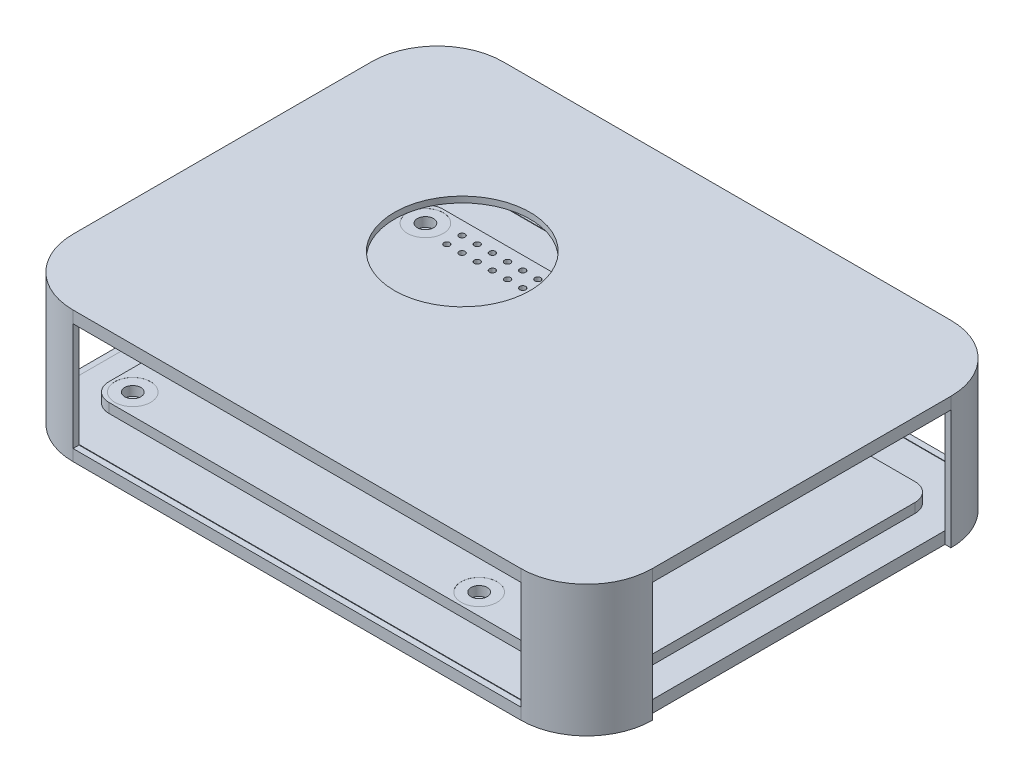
ISO-10303-21;
HEADER;
FILE_DESCRIPTION(('STEP AP214'),'2;1');
FILE_NAME('part.step','',(''),(''),'','','');
FILE_SCHEMA(('AUTOMOTIVE_DESIGN { 1 0 10303 214 1 1 1 1 }'));
ENDSEC;
DATA;
#1=APPLICATION_CONTEXT('core data for automotive mechanical design processes');
#2=APPLICATION_PROTOCOL_DEFINITION('international standard','automotive_design',2000,#1);
#3=PRODUCT_CONTEXT('',#1,'mechanical');
#4=PRODUCT('Part','Part','',(#3));
#5=PRODUCT_RELATED_PRODUCT_CATEGORY('part','',(#4));
#6=PRODUCT_DEFINITION_FORMATION('','',#4);
#7=PRODUCT_DEFINITION_CONTEXT('part definition',#1,'design');
#8=PRODUCT_DEFINITION('design','',#6,#7);
#9=PRODUCT_DEFINITION_SHAPE('','',#8);
#10=(LENGTH_UNIT() NAMED_UNIT(*) SI_UNIT(.MILLI.,.METRE.));
#11=(NAMED_UNIT(*) PLANE_ANGLE_UNIT() SI_UNIT($,.RADIAN.));
#12=(NAMED_UNIT(*) SI_UNIT($,.STERADIAN.) SOLID_ANGLE_UNIT());
#13=UNCERTAINTY_MEASURE_WITH_UNIT(LENGTH_MEASURE(1.E-05),#10,'distance_accuracy_value','');
#14=(GEOMETRIC_REPRESENTATION_CONTEXT(3) GLOBAL_UNCERTAINTY_ASSIGNED_CONTEXT((#13)) GLOBAL_UNIT_ASSIGNED_CONTEXT((#10,
#11,#12)) REPRESENTATION_CONTEXT('',''));
#15=CARTESIAN_POINT('',(0.,0.,0.));
#16=DIRECTION('',(0.,0.,1.));
#17=DIRECTION('',(1.,0.,0.));
#18=AXIS2_PLACEMENT_3D('',#15,#16,#17);
#19=CARTESIAN_POINT('',(-47.5,-2.8,24.9999999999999));
#20=DIRECTION('',(1.,0.,0.));
#21=DIRECTION('',(0.,0.,-1.));
#22=AXIS2_PLACEMENT_3D('',#19,#20,#21);
#23=PLANE('',#22);
#24=DIRECTION('',(0.,0.,-1.));
#25=VECTOR('',#24,1.);
#26=CARTESIAN_POINT('',(-47.5,17.2,-24.9999999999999));
#27=LINE('',#26,#25);
#28=CARTESIAN_POINT('',(-47.5,17.2,24.9999999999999));
#29=VERTEX_POINT('',#28);
#30=CARTESIAN_POINT('',(-47.5,17.2,-24.9999999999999));
#31=VERTEX_POINT('',#30);
#32=EDGE_CURVE('E356',#29,#31,#27,.T.);
#33=ORIENTED_EDGE('',*,*,#32,.T.);
#34=DIRECTION('',(0.,1.,0.));
#35=VECTOR('',#34,1.);
#36=CARTESIAN_POINT('',(-47.5,-2.8,-24.9999999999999));
#37=LINE('',#36,#35);
#38=CARTESIAN_POINT('',(-47.5,18.2,-25.));
#39=VERTEX_POINT('',#38);
#40=EDGE_CURVE('E498',#31,#39,#37,.T.);
#41=ORIENTED_EDGE('',*,*,#40,.T.);
#42=DIRECTION('',(0.,0.,1.));
#43=VECTOR('',#42,1.);
#44=CARTESIAN_POINT('',(-47.5,18.2,-25.));
#45=LINE('',#44,#43);
#46=CARTESIAN_POINT('',(-47.5,18.2,25.));
#47=VERTEX_POINT('',#46);
#48=EDGE_CURVE('E521',#39,#47,#45,.T.);
#49=ORIENTED_EDGE('',*,*,#48,.T.);
#50=DIRECTION('',(0.,1.,0.));
#51=VECTOR('',#50,1.);
#52=CARTESIAN_POINT('',(-47.5,-2.8,24.9999999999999));
#53=LINE('',#52,#51);
#54=EDGE_CURVE('E373',#29,#47,#53,.T.);
#55=ORIENTED_EDGE('',*,*,#54,.F.);
#56=EDGE_LOOP('',(#33,#41,#49,#55));
#57=FACE_BOUND('',#56,.T.);
#58=ADVANCED_FACE('F144',(#57),#23,.T.);
#59=CARTESIAN_POINT('',(-48.5,-2.8,24.9999999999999));
#60=DIRECTION('',(1.,0.,0.));
#61=DIRECTION('',(0.,0.,-1.));
#62=AXIS2_PLACEMENT_3D('',#59,#60,#61);
#63=PLANE('',#62);
#64=DIRECTION('',(0.,1.,0.));
#65=VECTOR('',#64,1.);
#66=CARTESIAN_POINT('',(-48.5,-2.8,-24.9999999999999));
#67=LINE('',#66,#65);
#68=CARTESIAN_POINT('',(-48.5,17.2,-24.9999999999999));
#69=VERTEX_POINT('',#68);
#70=CARTESIAN_POINT('',(-48.5,19.2,-24.9999999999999));
#71=VERTEX_POINT('',#70);
#72=EDGE_CURVE('E416',#69,#71,#67,.T.);
#73=ORIENTED_EDGE('',*,*,#72,.F.);
#74=DIRECTION('',(0.,0.,-1.));
#75=VECTOR('',#74,1.);
#76=CARTESIAN_POINT('',(-48.5,17.2,-24.9999999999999));
#77=LINE('',#76,#75);
#78=CARTESIAN_POINT('',(-48.5,17.2,24.9999999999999));
#79=VERTEX_POINT('',#78);
#80=EDGE_CURVE('E167',#79,#69,#77,.T.);
#81=ORIENTED_EDGE('',*,*,#80,.F.);
#82=DIRECTION('',(0.,1.,0.));
#83=VECTOR('',#82,1.);
#84=CARTESIAN_POINT('',(-48.5,-2.8,24.9999999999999));
#85=LINE('',#84,#83);
#86=CARTESIAN_POINT('',(-48.5,19.2,24.9999999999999));
#87=VERTEX_POINT('',#86);
#88=EDGE_CURVE('E420',#79,#87,#85,.T.);
#89=ORIENTED_EDGE('',*,*,#88,.T.);
#90=DIRECTION('',(0.,0.,-1.));
#91=VECTOR('',#90,1.);
#92=CARTESIAN_POINT('',(-48.5,19.2,24.9999999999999));
#93=LINE('',#92,#91);
#94=EDGE_CURVE('E468',#87,#71,#93,.T.);
#95=ORIENTED_EDGE('',*,*,#94,.T.);
#96=EDGE_LOOP('',(#73,#81,#89,#95));
#97=FACE_BOUND('',#96,.T.);
#98=ADVANCED_FACE('F722',(#97),#63,.F.);
#99=CARTESIAN_POINT('',(-37.5,-2.8,-35.));
#100=DIRECTION('',(0.,0.,1.));
#101=DIRECTION('',(1.,0.,0.));
#102=AXIS2_PLACEMENT_3D('',#99,#100,#101);
#103=PLANE('',#102);
#104=DIRECTION('',(1.,0.,0.));
#105=VECTOR('',#104,1.);
#106=CARTESIAN_POINT('',(37.4999999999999,17.2,-35.));
#107=LINE('',#106,#105);
#108=CARTESIAN_POINT('',(-37.4999999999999,17.2,-35.));
#109=VERTEX_POINT('',#108);
#110=CARTESIAN_POINT('',(37.4999999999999,17.2,-35.));
#111=VERTEX_POINT('',#110);
#112=EDGE_CURVE('E576',#109,#111,#107,.T.);
#113=ORIENTED_EDGE('',*,*,#112,.T.);
#114=DIRECTION('',(0.,1.,0.));
#115=VECTOR('',#114,1.);
#116=CARTESIAN_POINT('',(37.4999999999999,-2.8,-35.));
#117=LINE('',#116,#115);
#118=CARTESIAN_POINT('',(37.5,18.2,-35.));
#119=VERTEX_POINT('',#118);
#120=EDGE_CURVE('E492',#111,#119,#117,.T.);
#121=ORIENTED_EDGE('',*,*,#120,.T.);
#122=DIRECTION('',(-1.,0.,0.));
#123=VECTOR('',#122,1.);
#124=CARTESIAN_POINT('',(-37.5,18.2,-35.));
#125=LINE('',#124,#123);
#126=CARTESIAN_POINT('',(-37.5,18.2,-35.));
#127=VERTEX_POINT('',#126);
#128=EDGE_CURVE('E517',#119,#127,#125,.T.);
#129=ORIENTED_EDGE('',*,*,#128,.T.);
#130=DIRECTION('',(0.,1.,0.));
#131=VECTOR('',#130,1.);
#132=CARTESIAN_POINT('',(-37.5,-2.8,-35.));
#133=LINE('',#132,#131);
#134=EDGE_CURVE('E495',#109,#127,#133,.T.);
#135=ORIENTED_EDGE('',*,*,#134,.F.);
#136=EDGE_LOOP('',(#113,#121,#129,#135));
#137=FACE_BOUND('',#136,.T.);
#138=ADVANCED_FACE('F523',(#137),#103,.T.);
#139=CARTESIAN_POINT('',(-37.5,-2.8,-36.));
#140=DIRECTION('',(0.,0.,1.));
#141=DIRECTION('',(1.,0.,0.));
#142=AXIS2_PLACEMENT_3D('',#139,#140,#141);
#143=PLANE('',#142);
#144=DIRECTION('',(0.,1.,0.));
#145=VECTOR('',#144,1.);
#146=CARTESIAN_POINT('',(37.4999999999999,-2.8,-36.));
#147=LINE('',#146,#145);
#148=CARTESIAN_POINT('',(37.4999999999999,17.2,-36.));
#149=VERTEX_POINT('',#148);
#150=CARTESIAN_POINT('',(37.4999999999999,19.2,-36.));
#151=VERTEX_POINT('',#150);
#152=EDGE_CURVE('E408',#149,#151,#147,.T.);
#153=ORIENTED_EDGE('',*,*,#152,.F.);
#154=DIRECTION('',(1.,0.,0.));
#155=VECTOR('',#154,1.);
#156=CARTESIAN_POINT('',(37.4999999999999,17.2,-36.));
#157=LINE('',#156,#155);
#158=CARTESIAN_POINT('',(-37.4999999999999,17.2,-36.));
#159=VERTEX_POINT('',#158);
#160=EDGE_CURVE('E572',#159,#149,#157,.T.);
#161=ORIENTED_EDGE('',*,*,#160,.F.);
#162=DIRECTION('',(0.,1.,0.));
#163=VECTOR('',#162,1.);
#164=CARTESIAN_POINT('',(-37.4999999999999,-2.8,-36.));
#165=LINE('',#164,#163);
#166=CARTESIAN_POINT('',(-37.4999999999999,19.2,-36.));
#167=VERTEX_POINT('',#166);
#168=EDGE_CURVE('E412',#159,#167,#165,.T.);
#169=ORIENTED_EDGE('',*,*,#168,.T.);
#170=DIRECTION('',(1.,0.,0.));
#171=VECTOR('',#170,1.);
#172=CARTESIAN_POINT('',(-37.5,19.2,-36.));
#173=LINE('',#172,#171);
#174=EDGE_CURVE('E474',#167,#151,#173,.T.);
#175=ORIENTED_EDGE('',*,*,#174,.T.);
#176=EDGE_LOOP('',(#153,#161,#169,#175));
#177=FACE_BOUND('',#176,.T.);
#178=ADVANCED_FACE('F693',(#177),#143,.F.);
#179=CARTESIAN_POINT('',(-37.5,-2.8,35.));
#180=DIRECTION('',(0.,0.,-1.));
#181=DIRECTION('',(-1.,0.,0.));
#182=AXIS2_PLACEMENT_3D('',#179,#180,#181);
#183=PLANE('',#182);
#184=DIRECTION('',(-1.,0.,0.));
#185=VECTOR('',#184,1.);
#186=CARTESIAN_POINT('',(-37.5,17.2,35.));
#187=LINE('',#186,#185);
#188=CARTESIAN_POINT('',(37.4999999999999,17.2,35.));
#189=VERTEX_POINT('',#188);
#190=CARTESIAN_POINT('',(-37.5,17.2,35.));
#191=VERTEX_POINT('',#190);
#192=EDGE_CURVE('E620',#189,#191,#187,.T.);
#193=ORIENTED_EDGE('',*,*,#192,.T.);
#194=DIRECTION('',(0.,1.,0.));
#195=VECTOR('',#194,1.);
#196=CARTESIAN_POINT('',(-37.5,-2.8,35.));
#197=LINE('',#196,#195);
#198=CARTESIAN_POINT('',(-37.5,18.2,35.));
#199=VERTEX_POINT('',#198);
#200=EDGE_CURVE('E372',#191,#199,#197,.T.);
#201=ORIENTED_EDGE('',*,*,#200,.T.);
#202=DIRECTION('',(1.,0.,0.));
#203=VECTOR('',#202,1.);
#204=CARTESIAN_POINT('',(-37.5,18.2,35.));
#205=LINE('',#204,#203);
#206=CARTESIAN_POINT('',(37.5,18.2,35.));
#207=VERTEX_POINT('',#206);
#208=EDGE_CURVE('E460',#199,#207,#205,.T.);
#209=ORIENTED_EDGE('',*,*,#208,.T.);
#210=DIRECTION('',(0.,1.,0.));
#211=VECTOR('',#210,1.);
#212=CARTESIAN_POINT('',(37.4999999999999,-2.8,35.));
#213=LINE('',#212,#211);
#214=EDGE_CURVE('E381',#189,#207,#213,.T.);
#215=ORIENTED_EDGE('',*,*,#214,.F.);
#216=EDGE_LOOP('',(#193,#201,#209,#215));
#217=FACE_BOUND('',#216,.T.);
#218=ADVANCED_FACE('F539',(#217),#183,.T.);
#219=CARTESIAN_POINT('',(-37.5,-2.8,36.));
#220=DIRECTION('',(0.,0.,-1.));
#221=DIRECTION('',(-1.,0.,0.));
#222=AXIS2_PLACEMENT_3D('',#219,#220,#221);
#223=PLANE('',#222);
#224=DIRECTION('',(0.,1.,0.));
#225=VECTOR('',#224,1.);
#226=CARTESIAN_POINT('',(-37.5,-2.8,36.));
#227=LINE('',#226,#225);
#228=CARTESIAN_POINT('',(-37.5,17.2,36.));
#229=VERTEX_POINT('',#228);
#230=CARTESIAN_POINT('',(-37.5,19.2,36.));
#231=VERTEX_POINT('',#230);
#232=EDGE_CURVE('E424',#229,#231,#227,.T.);
#233=ORIENTED_EDGE('',*,*,#232,.F.);
#234=DIRECTION('',(-1.,0.,0.));
#235=VECTOR('',#234,1.);
#236=CARTESIAN_POINT('',(-37.5,17.2,36.));
#237=LINE('',#236,#235);
#238=CARTESIAN_POINT('',(37.4999999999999,17.2,36.));
#239=VERTEX_POINT('',#238);
#240=EDGE_CURVE('E615',#239,#229,#237,.T.);
#241=ORIENTED_EDGE('',*,*,#240,.F.);
#242=DIRECTION('',(0.,1.,0.));
#243=VECTOR('',#242,1.);
#244=CARTESIAN_POINT('',(37.4999999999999,-2.8,36.));
#245=LINE('',#244,#243);
#246=CARTESIAN_POINT('',(37.4999999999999,19.2,36.));
#247=VERTEX_POINT('',#246);
#248=EDGE_CURVE('E428',#239,#247,#245,.T.);
#249=ORIENTED_EDGE('',*,*,#248,.T.);
#250=DIRECTION('',(-1.,0.,0.));
#251=VECTOR('',#250,1.);
#252=CARTESIAN_POINT('',(-37.5,19.2,36.));
#253=LINE('',#252,#251);
#254=EDGE_CURVE('E454',#247,#231,#253,.T.);
#255=ORIENTED_EDGE('',*,*,#254,.T.);
#256=EDGE_LOOP('',(#233,#241,#249,#255));
#257=FACE_BOUND('',#256,.T.);
#258=ADVANCED_FACE('F748',(#257),#223,.F.);
#259=CARTESIAN_POINT('',(37.5,-2.8,-25.));
#260=DIRECTION('',(0.,1.,0.));
#261=DIRECTION('',(0.,0.,1.));
#262=AXIS2_PLACEMENT_3D('',#259,#260,#261);
#263=CYLINDRICAL_SURFACE('',#262,10.);
#264=DIRECTION('',(0.,1.,0.));
#265=VECTOR('',#264,1.);
#266=CARTESIAN_POINT('',(47.5,-2.8,-25.));
#267=LINE('',#266,#265);
#268=CARTESIAN_POINT('',(47.5,-2.8,-25.));
#269=VERTEX_POINT('',#268);
#270=CARTESIAN_POINT('',(47.5,17.2,-25.));
#271=VERTEX_POINT('',#270);
#272=EDGE_CURVE('E390',#269,#271,#267,.T.);
#273=ORIENTED_EDGE('',*,*,#272,.T.);
#274=CARTESIAN_POINT('',(47.5,18.2,-25.));
#275=VERTEX_POINT('',#274);
#276=EDGE_CURVE('E389',#271,#275,#267,.T.);
#277=ORIENTED_EDGE('',*,*,#276,.T.);
#278=CARTESIAN_POINT('',(37.5,18.2,-25.));
#279=DIRECTION('',(0.,1.,0.));
#280=DIRECTION('',(0.,0.,-1.));
#281=AXIS2_PLACEMENT_3D('',#278,#279,#280);
#282=CIRCLE('',#281,10.);
#283=EDGE_CURVE('E525',#275,#119,#282,.T.);
#284=ORIENTED_EDGE('',*,*,#283,.T.);
#285=ORIENTED_EDGE('',*,*,#120,.F.);
#286=DIRECTION('',(0.,-1.,0.));
#287=VECTOR('',#286,1.);
#288=CARTESIAN_POINT('',(37.4999999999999,17.2,-35.));
#289=LINE('',#288,#287);
#290=CARTESIAN_POINT('',(37.4999999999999,-0.716727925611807,-35.));
#291=VERTEX_POINT('',#290);
#292=EDGE_CURVE('E568',#111,#291,#289,.T.);
#293=ORIENTED_EDGE('',*,*,#292,.T.);
#294=CARTESIAN_POINT('',(37.4999999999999,-2.8,-35.));
#295=VERTEX_POINT('',#294);
#296=EDGE_CURVE('E493',#295,#291,#117,.T.);
#297=ORIENTED_EDGE('',*,*,#296,.F.);
#298=CARTESIAN_POINT('',(37.5,-2.8,-25.));
#299=DIRECTION('',(0.,-1.,0.));
#300=DIRECTION('',(0.,0.,-1.));
#301=AXIS2_PLACEMENT_3D('',#298,#299,#300);
#302=CIRCLE('',#301,10.);
#303=EDGE_CURVE('E477',#295,#269,#302,.T.);
#304=ORIENTED_EDGE('',*,*,#303,.T.);
#305=EDGE_LOOP('',(#273,#277,#284,#285,#293,#297,#304));
#306=FACE_BOUND('',#305,.T.);
#307=ADVANCED_FACE('F680',(#306),#263,.F.);
#308=CARTESIAN_POINT('',(47.5,-2.8,24.9999999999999));
#309=DIRECTION('',(-1.,0.,0.));
#310=DIRECTION('',(0.,0.,1.));
#311=AXIS2_PLACEMENT_3D('',#308,#309,#310);
#312=PLANE('',#311);
#313=DIRECTION('',(0.,0.,1.));
#314=VECTOR('',#313,1.);
#315=CARTESIAN_POINT('',(47.5,17.2,24.9999999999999));
#316=LINE('',#315,#314);
#317=CARTESIAN_POINT('',(47.5,17.2,24.9999999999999));
#318=VERTEX_POINT('',#317);
#319=EDGE_CURVE('E597',#271,#318,#316,.T.);
#320=ORIENTED_EDGE('',*,*,#319,.T.);
#321=DIRECTION('',(0.,1.,0.));
#322=VECTOR('',#321,1.);
#323=CARTESIAN_POINT('',(47.5,-2.8,24.9999999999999));
#324=LINE('',#323,#322);
#325=CARTESIAN_POINT('',(47.5,18.2,25.));
#326=VERTEX_POINT('',#325);
#327=EDGE_CURVE('E385',#318,#326,#324,.T.);
#328=ORIENTED_EDGE('',*,*,#327,.T.);
#329=DIRECTION('',(0.,0.,-1.));
#330=VECTOR('',#329,1.);
#331=CARTESIAN_POINT('',(47.5,18.2,-25.));
#332=LINE('',#331,#330);
#333=EDGE_CURVE('E527',#326,#275,#332,.T.);
#334=ORIENTED_EDGE('',*,*,#333,.T.);
#335=ORIENTED_EDGE('',*,*,#276,.F.);
#336=EDGE_LOOP('',(#320,#328,#334,#335));
#337=FACE_BOUND('',#336,.T.);
#338=ADVANCED_FACE('F649',(#337),#312,.T.);
#339=CARTESIAN_POINT('',(37.5,-2.8,25.));
#340=DIRECTION('',(0.,1.,0.));
#341=DIRECTION('',(0.,0.,1.));
#342=AXIS2_PLACEMENT_3D('',#339,#340,#341);
#343=CYLINDRICAL_SURFACE('',#342,10.);
#344=CARTESIAN_POINT('',(37.4999999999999,-2.8,35.));
#345=VERTEX_POINT('',#344);
#346=CARTESIAN_POINT('',(37.4999999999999,-0.891499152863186,35.));
#347=VERTEX_POINT('',#346);
#348=EDGE_CURVE('E382',#345,#347,#213,.T.);
#349=ORIENTED_EDGE('',*,*,#348,.T.);
#350=DIRECTION('',(0.,1.,0.));
#351=VECTOR('',#350,1.);
#352=CARTESIAN_POINT('',(37.4999999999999,17.2,35.));
#353=LINE('',#352,#351);
#354=EDGE_CURVE('E618',#347,#189,#353,.T.);
#355=ORIENTED_EDGE('',*,*,#354,.T.);
#356=ORIENTED_EDGE('',*,*,#214,.T.);
#357=CARTESIAN_POINT('',(37.5,18.2,25.));
#358=DIRECTION('',(0.,1.,0.));
#359=DIRECTION('',(0.,0.,1.));
#360=AXIS2_PLACEMENT_3D('',#357,#358,#359);
#361=CIRCLE('',#360,10.);
#362=EDGE_CURVE('E544',#207,#326,#361,.T.);
#363=ORIENTED_EDGE('',*,*,#362,.T.);
#364=ORIENTED_EDGE('',*,*,#327,.F.);
#365=CARTESIAN_POINT('',(47.5,-2.8,24.9999999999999));
#366=VERTEX_POINT('',#365);
#367=EDGE_CURVE('E386',#366,#318,#324,.T.);
#368=ORIENTED_EDGE('',*,*,#367,.F.);
#369=CARTESIAN_POINT('',(37.5,-2.8,25.));
#370=DIRECTION('',(0.,-1.,0.));
#371=DIRECTION('',(0.,0.,1.));
#372=AXIS2_PLACEMENT_3D('',#369,#370,#371);
#373=CIRCLE('',#372,10.);
#374=EDGE_CURVE('E480',#366,#345,#373,.T.);
#375=ORIENTED_EDGE('',*,*,#374,.T.);
#376=EDGE_LOOP('',(#349,#355,#356,#363,#364,#368,#375));
#377=FACE_BOUND('',#376,.T.);
#378=ADVANCED_FACE('F652',(#377),#343,.F.);
#379=DIRECTION('',(1.,0.,0.));
#380=VECTOR('',#379,1.);
#381=CARTESIAN_POINT('',(-37.5,-0.891499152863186,35.));
#382=LINE('',#381,#380);
#383=CARTESIAN_POINT('',(-37.5,-0.891499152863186,35.));
#384=VERTEX_POINT('',#383);
#385=EDGE_CURVE('E614',#384,#347,#382,.T.);
#386=ORIENTED_EDGE('',*,*,#385,.T.);
#387=ORIENTED_EDGE('',*,*,#348,.F.);
#388=DIRECTION('',(-1.,0.,0.));
#389=VECTOR('',#388,1.);
#390=CARTESIAN_POINT('',(-37.5,-2.8,35.));
#391=LINE('',#390,#389);
#392=CARTESIAN_POINT('',(-37.5,-2.8,35.));
#393=VERTEX_POINT('',#392);
#394=EDGE_CURVE('E482',#345,#393,#391,.T.);
#395=ORIENTED_EDGE('',*,*,#394,.T.);
#396=EDGE_CURVE('E375',#393,#384,#197,.T.);
#397=ORIENTED_EDGE('',*,*,#396,.T.);
#398=EDGE_LOOP('',(#386,#387,#395,#397));
#399=FACE_BOUND('',#398,.T.);
#400=ADVANCED_FACE('F660',(#399),#183,.T.);
#401=CARTESIAN_POINT('',(-37.5,-2.8,25.));
#402=DIRECTION('',(0.,1.,0.));
#403=DIRECTION('',(0.,0.,1.));
#404=AXIS2_PLACEMENT_3D('',#401,#402,#403);
#405=CYLINDRICAL_SURFACE('',#404,10.);
#406=CARTESIAN_POINT('',(-47.5,-2.8,24.9999999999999));
#407=VERTEX_POINT('',#406);
#408=CARTESIAN_POINT('',(-47.5,-0.856378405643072,24.9999999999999));
#409=VERTEX_POINT('',#408);
#410=EDGE_CURVE('E362',#407,#409,#53,.T.);
#411=ORIENTED_EDGE('',*,*,#410,.T.);
#412=DIRECTION('',(0.,1.,0.));
#413=VECTOR('',#412,1.);
#414=CARTESIAN_POINT('',(-47.5,17.2,24.9999999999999));
#415=LINE('',#414,#413);
#416=EDGE_CURVE('E351',#409,#29,#415,.T.);
#417=ORIENTED_EDGE('',*,*,#416,.T.);
#418=ORIENTED_EDGE('',*,*,#54,.T.);
#419=CARTESIAN_POINT('',(-37.5,18.2,25.));
#420=DIRECTION('',(0.,1.,0.));
#421=DIRECTION('',(0.,0.,1.));
#422=AXIS2_PLACEMENT_3D('',#419,#420,#421);
#423=CIRCLE('',#422,10.);
#424=EDGE_CURVE('E532',#47,#199,#423,.T.);
#425=ORIENTED_EDGE('',*,*,#424,.T.);
#426=ORIENTED_EDGE('',*,*,#200,.F.);
#427=DIRECTION('',(0.,-1.,0.));
#428=VECTOR('',#427,1.);
#429=CARTESIAN_POINT('',(-37.5,17.2,35.));
#430=LINE('',#429,#428);
#431=EDGE_CURVE('E612',#191,#384,#430,.T.);
#432=ORIENTED_EDGE('',*,*,#431,.T.);
#433=ORIENTED_EDGE('',*,*,#396,.F.);
#434=CARTESIAN_POINT('',(-37.5,-2.8,25.));
#435=DIRECTION('',(0.,-1.,0.));
#436=DIRECTION('',(0.,0.,-1.));
#437=AXIS2_PLACEMENT_3D('',#434,#435,#436);
#438=CIRCLE('',#437,10.);
#439=EDGE_CURVE('E371',#393,#407,#438,.T.);
#440=ORIENTED_EDGE('',*,*,#439,.T.);
#441=EDGE_LOOP('',(#411,#417,#418,#425,#426,#432,#433,#440));
#442=FACE_BOUND('',#441,.T.);
#443=ADVANCED_FACE('F368',(#442),#405,.F.);
#444=DIRECTION('',(0.,0.,1.));
#445=VECTOR('',#444,1.);
#446=CARTESIAN_POINT('',(-47.5,-0.856378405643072,-24.9999999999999));
#447=LINE('',#446,#445);
#448=CARTESIAN_POINT('',(-47.5,-0.856378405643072,-24.9999999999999));
#449=VERTEX_POINT('',#448);
#450=EDGE_CURVE('E159',#449,#409,#447,.T.);
#451=ORIENTED_EDGE('',*,*,#450,.T.);
#452=ORIENTED_EDGE('',*,*,#410,.F.);
#453=DIRECTION('',(0.,0.,-1.));
#454=VECTOR('',#453,1.);
#455=CARTESIAN_POINT('',(-47.5,-2.8,24.9999999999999));
#456=LINE('',#455,#454);
#457=CARTESIAN_POINT('',(-47.5,-2.8,-24.9999999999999));
#458=VERTEX_POINT('',#457);
#459=EDGE_CURVE('E485',#407,#458,#456,.T.);
#460=ORIENTED_EDGE('',*,*,#459,.T.);
#461=EDGE_CURVE('E365',#458,#449,#37,.T.);
#462=ORIENTED_EDGE('',*,*,#461,.T.);
#463=EDGE_LOOP('',(#451,#452,#460,#462));
#464=FACE_BOUND('',#463,.T.);
#465=ADVANCED_FACE('F361',(#464),#23,.T.);
#466=CARTESIAN_POINT('',(-37.5,-2.8,-25.));
#467=DIRECTION('',(0.,1.,0.));
#468=DIRECTION('',(0.,0.,1.));
#469=AXIS2_PLACEMENT_3D('',#466,#467,#468);
#470=CYLINDRICAL_SURFACE('',#469,10.);
#471=CARTESIAN_POINT('',(-37.5,-2.8,-35.));
#472=VERTEX_POINT('',#471);
#473=CARTESIAN_POINT('',(-37.5,-0.716727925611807,-35.));
#474=VERTEX_POINT('',#473);
#475=EDGE_CURVE('E496',#472,#474,#133,.T.);
#476=ORIENTED_EDGE('',*,*,#475,.T.);
#477=DIRECTION('',(0.,1.,0.));
#478=VECTOR('',#477,1.);
#479=CARTESIAN_POINT('',(-37.4999999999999,17.2,-35.));
#480=LINE('',#479,#478);
#481=EDGE_CURVE('E507',#474,#109,#480,.T.);
#482=ORIENTED_EDGE('',*,*,#481,.T.);
#483=ORIENTED_EDGE('',*,*,#134,.T.);
#484=CARTESIAN_POINT('',(-37.5,18.2,-25.));
#485=DIRECTION('',(0.,1.,0.));
#486=DIRECTION('',(0.,0.,1.));
#487=AXIS2_PLACEMENT_3D('',#484,#485,#486);
#488=CIRCLE('',#487,10.);
#489=EDGE_CURVE('E506',#127,#39,#488,.T.);
#490=ORIENTED_EDGE('',*,*,#489,.T.);
#491=ORIENTED_EDGE('',*,*,#40,.F.);
#492=DIRECTION('',(0.,-1.,0.));
#493=VECTOR('',#492,1.);
#494=CARTESIAN_POINT('',(-47.5,17.2,-24.9999999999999));
#495=LINE('',#494,#493);
#496=EDGE_CURVE('E366',#31,#449,#495,.T.);
#497=ORIENTED_EDGE('',*,*,#496,.T.);
#498=ORIENTED_EDGE('',*,*,#461,.F.);
#499=CARTESIAN_POINT('',(-37.5,-2.8,-25.));
#500=DIRECTION('',(0.,-1.,0.));
#501=DIRECTION('',(0.,0.,-1.));
#502=AXIS2_PLACEMENT_3D('',#499,#500,#501);
#503=CIRCLE('',#502,10.);
#504=EDGE_CURVE('E487',#458,#472,#503,.T.);
#505=ORIENTED_EDGE('',*,*,#504,.T.);
#506=EDGE_LOOP('',(#476,#482,#483,#490,#491,#497,#498,#505));
#507=FACE_BOUND('',#506,.T.);
#508=ADVANCED_FACE('F504',(#507),#470,.F.);
#509=DIRECTION('',(-1.,0.,0.));
#510=VECTOR('',#509,1.);
#511=CARTESIAN_POINT('',(37.4999999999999,-0.716727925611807,-35.));
#512=LINE('',#511,#510);
#513=EDGE_CURVE('E571',#291,#474,#512,.T.);
#514=ORIENTED_EDGE('',*,*,#513,.T.);
#515=ORIENTED_EDGE('',*,*,#475,.F.);
#516=DIRECTION('',(1.,0.,0.));
#517=VECTOR('',#516,1.);
#518=CARTESIAN_POINT('',(-37.5,-2.8,-35.));
#519=LINE('',#518,#517);
#520=EDGE_CURVE('E490',#472,#295,#519,.T.);
#521=ORIENTED_EDGE('',*,*,#520,.T.);
#522=ORIENTED_EDGE('',*,*,#296,.T.);
#523=EDGE_LOOP('',(#514,#515,#521,#522));
#524=FACE_BOUND('',#523,.T.);
#525=ADVANCED_FACE('F678',(#524),#103,.T.);
#526=CARTESIAN_POINT('',(37.5,-2.8,-25.));
#527=DIRECTION('',(0.,-1.,0.));
#528=DIRECTION('',(0.,0.,-1.));
#529=AXIS2_PLACEMENT_3D('',#526,#527,#528);
#530=PLANE('',#529);
#531=DIRECTION('',(1.,0.,0.));
#532=VECTOR('',#531,1.);
#533=CARTESIAN_POINT('',(47.5,-2.8,24.9999999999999));
#534=LINE('',#533,#532);
#535=CARTESIAN_POINT('',(48.5,-2.8,24.9999999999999));
#536=VERTEX_POINT('',#535);
#537=EDGE_CURVE('E600',#366,#536,#534,.T.);
#538=ORIENTED_EDGE('',*,*,#537,.T.);
#539=CARTESIAN_POINT('',(37.5,-2.8,25.));
#540=DIRECTION('',(0.,-1.,0.));
#541=DIRECTION('',(1.,0.,0.));
#542=AXIS2_PLACEMENT_3D('',#539,#540,#541);
#543=CIRCLE('',#542,11.);
#544=CARTESIAN_POINT('',(37.4999999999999,-2.8,36.));
#545=VERTEX_POINT('',#544);
#546=EDGE_CURVE('E396',#536,#545,#543,.T.);
#547=ORIENTED_EDGE('',*,*,#546,.T.);
#548=DIRECTION('',(-1.,0.,0.));
#549=VECTOR('',#548,1.);
#550=CARTESIAN_POINT('',(-37.5,-2.8,36.));
#551=LINE('',#550,#549);
#552=CARTESIAN_POINT('',(-37.5,-2.8,36.));
#553=VERTEX_POINT('',#552);
#554=EDGE_CURVE('E398',#545,#553,#551,.T.);
#555=ORIENTED_EDGE('',*,*,#554,.T.);
#556=CARTESIAN_POINT('',(-37.5,-2.8,25.));
#557=DIRECTION('',(0.,-1.,0.));
#558=DIRECTION('',(1.,0.,0.));
#559=AXIS2_PLACEMENT_3D('',#556,#557,#558);
#560=CIRCLE('',#559,11.);
#561=CARTESIAN_POINT('',(-48.5,-2.8,24.9999999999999));
#562=VERTEX_POINT('',#561);
#563=EDGE_CURVE('E400',#553,#562,#560,.T.);
#564=ORIENTED_EDGE('',*,*,#563,.T.);
#565=DIRECTION('',(0.,0.,-1.));
#566=VECTOR('',#565,1.);
#567=CARTESIAN_POINT('',(-48.5,-2.8,24.9999999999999));
#568=LINE('',#567,#566);
#569=CARTESIAN_POINT('',(-48.5,-2.8,-24.9999999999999));
#570=VERTEX_POINT('',#569);
#571=EDGE_CURVE('E402',#562,#570,#568,.T.);
#572=ORIENTED_EDGE('',*,*,#571,.T.);
#573=CARTESIAN_POINT('',(-37.5,-2.8,-25.));
#574=DIRECTION('',(0.,-1.,0.));
#575=DIRECTION('',(1.,0.,0.));
#576=AXIS2_PLACEMENT_3D('',#573,#574,#575);
#577=CIRCLE('',#576,11.);
#578=CARTESIAN_POINT('',(-37.4999999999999,-2.8,-36.));
#579=VERTEX_POINT('',#578);
#580=EDGE_CURVE('E404',#570,#579,#577,.T.);
#581=ORIENTED_EDGE('',*,*,#580,.T.);
#582=DIRECTION('',(1.,0.,0.));
#583=VECTOR('',#582,1.);
#584=CARTESIAN_POINT('',(-37.5,-2.8,-36.));
#585=LINE('',#584,#583);
#586=CARTESIAN_POINT('',(37.4999999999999,-2.8,-36.));
#587=VERTEX_POINT('',#586);
#588=EDGE_CURVE('E406',#579,#587,#585,.T.);
#589=ORIENTED_EDGE('',*,*,#588,.T.);
#590=CARTESIAN_POINT('',(37.5,-2.8,-25.));
#591=DIRECTION('',(0.,-1.,0.));
#592=DIRECTION('',(1.,0.,0.));
#593=AXIS2_PLACEMENT_3D('',#590,#591,#592);
#594=CIRCLE('',#593,11.);
#595=CARTESIAN_POINT('',(48.5,-2.8,-25.));
#596=VERTEX_POINT('',#595);
#597=EDGE_CURVE('E393',#587,#596,#594,.T.);
#598=ORIENTED_EDGE('',*,*,#597,.T.);
#599=DIRECTION('',(1.,0.,0.));
#600=VECTOR('',#599,1.);
#601=CARTESIAN_POINT('',(47.5,-2.8,-25.));
#602=LINE('',#601,#600);
#603=EDGE_CURVE('E608',#269,#596,#602,.T.);
#604=ORIENTED_EDGE('',*,*,#603,.F.);
#605=ORIENTED_EDGE('',*,*,#303,.F.);
#606=ORIENTED_EDGE('',*,*,#520,.F.);
#607=ORIENTED_EDGE('',*,*,#504,.F.);
#608=ORIENTED_EDGE('',*,*,#459,.F.);
#609=ORIENTED_EDGE('',*,*,#439,.F.);
#610=ORIENTED_EDGE('',*,*,#394,.F.);
#611=ORIENTED_EDGE('',*,*,#374,.F.);
#612=EDGE_LOOP('',(#538,#547,#555,#564,#572,#581,#589,#598,#604,#605,#606,#607,#608,#609,#610,#611));
#613=FACE_BOUND('',#612,.T.);
#614=ADVANCED_FACE('F671',(#613),#530,.T.);
#615=CARTESIAN_POINT('',(37.5,-2.8,-25.));
#616=DIRECTION('',(0.,1.,0.));
#617=DIRECTION('',(0.,0.,1.));
#618=AXIS2_PLACEMENT_3D('',#615,#616,#617);
#619=CYLINDRICAL_SURFACE('',#618,11.);
#620=CARTESIAN_POINT('',(37.4999999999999,-0.716727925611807,-36.));
#621=VERTEX_POINT('',#620);
#622=EDGE_CURVE('E409',#587,#621,#147,.T.);
#623=ORIENTED_EDGE('',*,*,#622,.T.);
#624=DIRECTION('',(0.,-1.,0.));
#625=VECTOR('',#624,1.);
#626=CARTESIAN_POINT('',(37.4999999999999,17.2,-36.));
#627=LINE('',#626,#625);
#628=EDGE_CURVE('E565',#149,#621,#627,.T.);
#629=ORIENTED_EDGE('',*,*,#628,.F.);
#630=ORIENTED_EDGE('',*,*,#152,.T.);
#631=CARTESIAN_POINT('',(37.5,19.2,-25.));
#632=DIRECTION('',(0.,-1.,0.));
#633=DIRECTION('',(1.,0.,0.));
#634=AXIS2_PLACEMENT_3D('',#631,#632,#633);
#635=CIRCLE('',#634,11.);
#636=CARTESIAN_POINT('',(48.5,19.2,-25.));
#637=VERTEX_POINT('',#636);
#638=EDGE_CURVE('E458',#151,#637,#635,.T.);
#639=ORIENTED_EDGE('',*,*,#638,.T.);
#640=DIRECTION('',(0.,1.,0.));
#641=VECTOR('',#640,1.);
#642=CARTESIAN_POINT('',(48.5,-2.8,-25.));
#643=LINE('',#642,#641);
#644=CARTESIAN_POINT('',(48.5,17.2,-25.));
#645=VERTEX_POINT('',#644);
#646=EDGE_CURVE('E152',#645,#637,#643,.T.);
#647=ORIENTED_EDGE('',*,*,#646,.F.);
#648=EDGE_CURVE('E13',#596,#645,#643,.T.);
#649=ORIENTED_EDGE('',*,*,#648,.F.);
#650=ORIENTED_EDGE('',*,*,#597,.F.);
#651=EDGE_LOOP('',(#623,#629,#630,#639,#647,#649,#650));
#652=FACE_BOUND('',#651,.T.);
#653=ADVANCED_FACE('F146',(#652),#619,.T.);
#654=CARTESIAN_POINT('',(48.5,-2.8,24.9999999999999));
#655=DIRECTION('',(-1.,0.,0.));
#656=DIRECTION('',(0.,0.,1.));
#657=AXIS2_PLACEMENT_3D('',#654,#655,#656);
#658=PLANE('',#657);
#659=DIRECTION('',(0.,1.,0.));
#660=VECTOR('',#659,1.);
#661=CARTESIAN_POINT('',(48.5,-2.8,24.9999999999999));
#662=LINE('',#661,#660);
#663=CARTESIAN_POINT('',(48.5,17.2,24.9999999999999));
#664=VERTEX_POINT('',#663);
#665=CARTESIAN_POINT('',(48.5,19.2,24.9999999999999));
#666=VERTEX_POINT('',#665);
#667=EDGE_CURVE('E431',#664,#666,#662,.T.);
#668=ORIENTED_EDGE('',*,*,#667,.F.);
#669=DIRECTION('',(0.,0.,1.));
#670=VECTOR('',#669,1.);
#671=CARTESIAN_POINT('',(48.5,17.2,24.9999999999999));
#672=LINE('',#671,#670);
#673=EDGE_CURVE('E590',#645,#664,#672,.T.);
#674=ORIENTED_EDGE('',*,*,#673,.F.);
#675=ORIENTED_EDGE('',*,*,#646,.T.);
#676=DIRECTION('',(0.,0.,1.));
#677=VECTOR('',#676,1.);
#678=CARTESIAN_POINT('',(48.5,19.2,24.9999999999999));
#679=LINE('',#678,#677);
#680=EDGE_CURVE('E450',#637,#666,#679,.T.);
#681=ORIENTED_EDGE('',*,*,#680,.T.);
#682=EDGE_LOOP('',(#668,#674,#675,#681));
#683=FACE_BOUND('',#682,.T.);
#684=ADVANCED_FACE('F456',(#683),#658,.F.);
#685=CARTESIAN_POINT('',(37.5,-2.8,25.));
#686=DIRECTION('',(0.,1.,0.));
#687=DIRECTION('',(0.,0.,1.));
#688=AXIS2_PLACEMENT_3D('',#685,#686,#687);
#689=CYLINDRICAL_SURFACE('',#688,11.);
#690=EDGE_CURVE('E432',#536,#664,#662,.T.);
#691=ORIENTED_EDGE('',*,*,#690,.T.);
#692=ORIENTED_EDGE('',*,*,#667,.T.);
#693=CARTESIAN_POINT('',(37.5,19.2,25.));
#694=DIRECTION('',(0.,-1.,0.));
#695=DIRECTION('',(1.,0.,0.));
#696=AXIS2_PLACEMENT_3D('',#693,#694,#695);
#697=CIRCLE('',#696,11.);
#698=EDGE_CURVE('E441',#666,#247,#697,.T.);
#699=ORIENTED_EDGE('',*,*,#698,.T.);
#700=ORIENTED_EDGE('',*,*,#248,.F.);
#701=DIRECTION('',(0.,1.,0.));
#702=VECTOR('',#701,1.);
#703=CARTESIAN_POINT('',(37.4999999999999,17.2,36.));
#704=LINE('',#703,#702);
#705=CARTESIAN_POINT('',(37.4999999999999,-0.891499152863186,36.));
#706=VERTEX_POINT('',#705);
#707=EDGE_CURVE('E628',#706,#239,#704,.T.);
#708=ORIENTED_EDGE('',*,*,#707,.F.);
#709=EDGE_CURVE('E429',#545,#706,#245,.T.);
#710=ORIENTED_EDGE('',*,*,#709,.F.);
#711=ORIENTED_EDGE('',*,*,#546,.F.);
#712=EDGE_LOOP('',(#691,#692,#699,#700,#708,#710,#711));
#713=FACE_BOUND('',#712,.T.);
#714=ADVANCED_FACE('F439',(#713),#689,.T.);
#715=ORIENTED_EDGE('',*,*,#709,.T.);
#716=DIRECTION('',(1.,0.,0.));
#717=VECTOR('',#716,1.);
#718=CARTESIAN_POINT('',(-37.5,-0.891499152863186,36.));
#719=LINE('',#718,#717);
#720=CARTESIAN_POINT('',(-37.5,-0.891499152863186,36.));
#721=VERTEX_POINT('',#720);
#722=EDGE_CURVE('E625',#721,#706,#719,.T.);
#723=ORIENTED_EDGE('',*,*,#722,.F.);
#724=EDGE_CURVE('E425',#553,#721,#227,.T.);
#725=ORIENTED_EDGE('',*,*,#724,.F.);
#726=ORIENTED_EDGE('',*,*,#554,.F.);
#727=EDGE_LOOP('',(#715,#723,#725,#726));
#728=FACE_BOUND('',#727,.T.);
#729=ADVANCED_FACE('F760',(#728),#223,.F.);
#730=CARTESIAN_POINT('',(-37.5,-2.8,25.));
#731=DIRECTION('',(0.,1.,0.));
#732=DIRECTION('',(0.,0.,1.));
#733=AXIS2_PLACEMENT_3D('',#730,#731,#732);
#734=CYLINDRICAL_SURFACE('',#733,11.);
#735=ORIENTED_EDGE('',*,*,#724,.T.);
#736=DIRECTION('',(0.,-1.,0.));
#737=VECTOR('',#736,1.);
#738=CARTESIAN_POINT('',(-37.5,17.2,36.));
#739=LINE('',#738,#737);
#740=EDGE_CURVE('E605',#229,#721,#739,.T.);
#741=ORIENTED_EDGE('',*,*,#740,.F.);
#742=ORIENTED_EDGE('',*,*,#232,.T.);
#743=CARTESIAN_POINT('',(-37.5,19.2,25.));
#744=DIRECTION('',(0.,-1.,0.));
#745=DIRECTION('',(1.,0.,0.));
#746=AXIS2_PLACEMENT_3D('',#743,#744,#745);
#747=CIRCLE('',#746,11.);
#748=EDGE_CURVE('E465',#231,#87,#747,.T.);
#749=ORIENTED_EDGE('',*,*,#748,.T.);
#750=ORIENTED_EDGE('',*,*,#88,.F.);
#751=DIRECTION('',(0.,1.,0.));
#752=VECTOR('',#751,1.);
#753=CARTESIAN_POINT('',(-48.5,17.2,24.9999999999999));
#754=LINE('',#753,#752);
#755=CARTESIAN_POINT('',(-48.5,-0.856378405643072,24.9999999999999));
#756=VERTEX_POINT('',#755);
#757=EDGE_CURVE('E554',#756,#79,#754,.T.);
#758=ORIENTED_EDGE('',*,*,#757,.F.);
#759=EDGE_CURVE('E421',#562,#756,#85,.T.);
#760=ORIENTED_EDGE('',*,*,#759,.F.);
#761=ORIENTED_EDGE('',*,*,#563,.F.);
#762=EDGE_LOOP('',(#735,#741,#742,#749,#750,#758,#760,#761));
#763=FACE_BOUND('',#762,.T.);
#764=ADVANCED_FACE('F756',(#763),#734,.T.);
#765=ORIENTED_EDGE('',*,*,#759,.T.);
#766=DIRECTION('',(0.,0.,1.));
#767=VECTOR('',#766,1.);
#768=CARTESIAN_POINT('',(-48.5,-0.856378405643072,-24.9999999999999));
#769=LINE('',#768,#767);
#770=CARTESIAN_POINT('',(-48.5,-0.856378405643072,-24.9999999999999));
#771=VERTEX_POINT('',#770);
#772=EDGE_CURVE('E343',#771,#756,#769,.T.);
#773=ORIENTED_EDGE('',*,*,#772,.F.);
#774=EDGE_CURVE('E417',#570,#771,#67,.T.);
#775=ORIENTED_EDGE('',*,*,#774,.F.);
#776=ORIENTED_EDGE('',*,*,#571,.F.);
#777=EDGE_LOOP('',(#765,#773,#775,#776));
#778=FACE_BOUND('',#777,.T.);
#779=ADVANCED_FACE('F729',(#778),#63,.F.);
#780=CARTESIAN_POINT('',(-37.5,-2.8,-25.));
#781=DIRECTION('',(0.,1.,0.));
#782=DIRECTION('',(0.,0.,1.));
#783=AXIS2_PLACEMENT_3D('',#780,#781,#782);
#784=CYLINDRICAL_SURFACE('',#783,11.);
#785=ORIENTED_EDGE('',*,*,#774,.T.);
#786=DIRECTION('',(0.,-1.,0.));
#787=VECTOR('',#786,1.);
#788=CARTESIAN_POINT('',(-48.5,17.2,-24.9999999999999));
#789=LINE('',#788,#787);
#790=EDGE_CURVE('E558',#69,#771,#789,.T.);
#791=ORIENTED_EDGE('',*,*,#790,.F.);
#792=ORIENTED_EDGE('',*,*,#72,.T.);
#793=CARTESIAN_POINT('',(-37.5,19.2,-25.));
#794=DIRECTION('',(0.,-1.,0.));
#795=DIRECTION('',(1.,0.,0.));
#796=AXIS2_PLACEMENT_3D('',#793,#794,#795);
#797=CIRCLE('',#796,11.);
#798=EDGE_CURVE('E471',#71,#167,#797,.T.);
#799=ORIENTED_EDGE('',*,*,#798,.T.);
#800=ORIENTED_EDGE('',*,*,#168,.F.);
#801=DIRECTION('',(0.,1.,0.));
#802=VECTOR('',#801,1.);
#803=CARTESIAN_POINT('',(-37.4999999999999,17.2,-36.));
#804=LINE('',#803,#802);
#805=CARTESIAN_POINT('',(-37.4999999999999,-0.716727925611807,-36.));
#806=VERTEX_POINT('',#805);
#807=EDGE_CURVE('E583',#806,#159,#804,.T.);
#808=ORIENTED_EDGE('',*,*,#807,.F.);
#809=EDGE_CURVE('E413',#579,#806,#165,.T.);
#810=ORIENTED_EDGE('',*,*,#809,.F.);
#811=ORIENTED_EDGE('',*,*,#580,.F.);
#812=EDGE_LOOP('',(#785,#791,#792,#799,#800,#808,#810,#811));
#813=FACE_BOUND('',#812,.T.);
#814=ADVANCED_FACE('F709',(#813),#784,.T.);
#815=ORIENTED_EDGE('',*,*,#809,.T.);
#816=DIRECTION('',(-1.,0.,0.));
#817=VECTOR('',#816,1.);
#818=CARTESIAN_POINT('',(37.4999999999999,-0.716727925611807,-36.));
#819=LINE('',#818,#817);
#820=EDGE_CURVE('E580',#621,#806,#819,.T.);
#821=ORIENTED_EDGE('',*,*,#820,.F.);
#822=ORIENTED_EDGE('',*,*,#622,.F.);
#823=ORIENTED_EDGE('',*,*,#588,.F.);
#824=EDGE_LOOP('',(#815,#821,#822,#823));
#825=FACE_BOUND('',#824,.T.);
#826=ADVANCED_FACE('F704',(#825),#143,.F.);
#827=CARTESIAN_POINT('',(37.5,19.2,-25.));
#828=DIRECTION('',(0.,-1.,0.));
#829=DIRECTION('',(0.,0.,-1.));
#830=AXIS2_PLACEMENT_3D('',#827,#828,#829);
#831=PLANE('',#830);
#832=CARTESIAN_POINT('',(-13.3983209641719,19.2,-5.07362889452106));
#833=DIRECTION('',(0.,1.,0.));
#834=DIRECTION('',(0.,0.,1.));
#835=AXIS2_PLACEMENT_3D('',#832,#833,#834);
#836=CIRCLE('',#835,11.3606880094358);
#837=CARTESIAN_POINT('',(-13.3983209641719,19.2,6.28705911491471));
#838=VERTEX_POINT('',#837);
#839=EDGE_CURVE('E635',#838,#838,#836,.T.);
#840=ORIENTED_EDGE('',*,*,#839,.F.);
#841=EDGE_LOOP('',(#840));
#842=FACE_BOUND('',#841,.T.);
#843=ORIENTED_EDGE('',*,*,#638,.F.);
#844=ORIENTED_EDGE('',*,*,#174,.F.);
#845=ORIENTED_EDGE('',*,*,#798,.F.);
#846=ORIENTED_EDGE('',*,*,#94,.F.);
#847=ORIENTED_EDGE('',*,*,#748,.F.);
#848=ORIENTED_EDGE('',*,*,#254,.F.);
#849=ORIENTED_EDGE('',*,*,#698,.F.);
#850=ORIENTED_EDGE('',*,*,#680,.F.);
#851=EDGE_LOOP('',(#843,#844,#845,#846,#847,#848,#849,#850));
#852=FACE_BOUND('',#851,.T.);
#853=ADVANCED_FACE('F449',(#842,#852),#831,.F.);
#854=CARTESIAN_POINT('',(37.5,18.2,25.));
#855=DIRECTION('',(0.,1.,0.));
#856=DIRECTION('',(0.,0.,1.));
#857=AXIS2_PLACEMENT_3D('',#854,#855,#856);
#858=PLANE('',#857);
#859=CARTESIAN_POINT('',(-13.3983209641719,18.2,-5.07362889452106));
#860=DIRECTION('',(0.,1.,0.));
#861=DIRECTION('',(0.,0.,1.));
#862=AXIS2_PLACEMENT_3D('',#859,#860,#861);
#863=CIRCLE('',#862,11.3606880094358);
#864=CARTESIAN_POINT('',(-13.3983209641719,18.2,6.28705911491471));
#865=VERTEX_POINT('',#864);
#866=EDGE_CURVE('E641',#865,#865,#863,.T.);
#867=ORIENTED_EDGE('',*,*,#866,.T.);
#868=EDGE_LOOP('',(#867));
#869=FACE_BOUND('',#868,.T.);
#870=ORIENTED_EDGE('',*,*,#362,.F.);
#871=ORIENTED_EDGE('',*,*,#208,.F.);
#872=ORIENTED_EDGE('',*,*,#424,.F.);
#873=ORIENTED_EDGE('',*,*,#48,.F.);
#874=ORIENTED_EDGE('',*,*,#489,.F.);
#875=ORIENTED_EDGE('',*,*,#128,.F.);
#876=ORIENTED_EDGE('',*,*,#283,.F.);
#877=ORIENTED_EDGE('',*,*,#333,.F.);
#878=EDGE_LOOP('',(#870,#871,#872,#873,#874,#875,#876,#877));
#879=FACE_BOUND('',#878,.T.);
#880=ADVANCED_FACE('F515',(#869,#879),#858,.F.);
#881=CARTESIAN_POINT('',(-13.3983209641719,18.2,-5.07362889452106));
#882=DIRECTION('',(0.,1.,0.));
#883=DIRECTION('',(0.,0.,1.));
#884=AXIS2_PLACEMENT_3D('',#881,#882,#883);
#885=CYLINDRICAL_SURFACE('',#884,11.3606880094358);
#886=ORIENTED_EDGE('',*,*,#866,.F.);
#887=EDGE_LOOP('',(#886));
#888=FACE_BOUND('',#887,.T.);
#889=ORIENTED_EDGE('',*,*,#839,.T.);
#890=EDGE_LOOP('',(#889));
#891=FACE_BOUND('',#890,.T.);
#892=ADVANCED_FACE('F972',(#888,#891),#885,.F.);
#893=CARTESIAN_POINT('',(-37.5,17.2,35.));
#894=DIRECTION('',(-1.,0.,0.));
#895=DIRECTION('',(0.,0.,1.));
#896=AXIS2_PLACEMENT_3D('',#893,#894,#895);
#897=PLANE('',#896);
#898=ORIENTED_EDGE('',*,*,#740,.T.);
#899=DIRECTION('',(0.,0.,1.));
#900=VECTOR('',#899,1.);
#901=CARTESIAN_POINT('',(-37.5,-0.891499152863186,35.));
#902=LINE('',#901,#900);
#903=EDGE_CURVE('E622',#384,#721,#902,.T.);
#904=ORIENTED_EDGE('',*,*,#903,.F.);
#905=ORIENTED_EDGE('',*,*,#431,.F.);
#906=DIRECTION('',(0.,0.,1.));
#907=VECTOR('',#906,1.);
#908=CARTESIAN_POINT('',(-37.5,17.2,35.));
#909=LINE('',#908,#907);
#910=EDGE_CURVE('E632',#191,#229,#909,.T.);
#911=ORIENTED_EDGE('',*,*,#910,.T.);
#912=EDGE_LOOP('',(#898,#904,#905,#911));
#913=FACE_BOUND('',#912,.T.);
#914=ADVANCED_FACE('F667',(#913),#897,.F.);
#915=CARTESIAN_POINT('',(-37.5,17.2,35.));
#916=DIRECTION('',(0.,1.,0.));
#917=DIRECTION('',(0.,0.,1.));
#918=AXIS2_PLACEMENT_3D('',#915,#916,#917);
#919=PLANE('',#918);
#920=ORIENTED_EDGE('',*,*,#240,.T.);
#921=ORIENTED_EDGE('',*,*,#910,.F.);
#922=ORIENTED_EDGE('',*,*,#192,.F.);
#923=DIRECTION('',(0.,0.,1.));
#924=VECTOR('',#923,1.);
#925=CARTESIAN_POINT('',(37.4999999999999,17.2,35.));
#926=LINE('',#925,#924);
#927=EDGE_CURVE('E636',#189,#239,#926,.T.);
#928=ORIENTED_EDGE('',*,*,#927,.T.);
#929=EDGE_LOOP('',(#920,#921,#922,#928));
#930=FACE_BOUND('',#929,.T.);
#931=ADVANCED_FACE('F954',(#930),#919,.F.);
#932=CARTESIAN_POINT('',(37.4999999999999,17.2,35.));
#933=DIRECTION('',(1.,0.,0.));
#934=DIRECTION('',(0.,0.,-1.));
#935=AXIS2_PLACEMENT_3D('',#932,#933,#934);
#936=PLANE('',#935);
#937=ORIENTED_EDGE('',*,*,#707,.T.);
#938=ORIENTED_EDGE('',*,*,#927,.F.);
#939=ORIENTED_EDGE('',*,*,#354,.F.);
#940=DIRECTION('',(0.,0.,1.));
#941=VECTOR('',#940,1.);
#942=CARTESIAN_POINT('',(37.4999999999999,-0.891499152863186,35.));
#943=LINE('',#942,#941);
#944=EDGE_CURVE('E638',#347,#706,#943,.T.);
#945=ORIENTED_EDGE('',*,*,#944,.T.);
#946=EDGE_LOOP('',(#937,#938,#939,#945));
#947=FACE_BOUND('',#946,.T.);
#948=ADVANCED_FACE('F657',(#947),#936,.F.);
#949=CARTESIAN_POINT('',(-37.5,-0.891499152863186,35.));
#950=DIRECTION('',(0.,-1.,0.));
#951=DIRECTION('',(0.,0.,-1.));
#952=AXIS2_PLACEMENT_3D('',#949,#950,#951);
#953=PLANE('',#952);
#954=ORIENTED_EDGE('',*,*,#722,.T.);
#955=ORIENTED_EDGE('',*,*,#944,.F.);
#956=ORIENTED_EDGE('',*,*,#385,.F.);
#957=ORIENTED_EDGE('',*,*,#903,.T.);
#958=EDGE_LOOP('',(#954,#955,#956,#957));
#959=FACE_BOUND('',#958,.T.);
#960=ADVANCED_FACE('F664',(#959),#953,.F.);
#961=CARTESIAN_POINT('',(47.5,17.2,24.9999999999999));
#962=DIRECTION('',(0.,0.,1.));
#963=DIRECTION('',(1.,0.,0.));
#964=AXIS2_PLACEMENT_3D('',#961,#962,#963);
#965=PLANE('',#964);
#966=ORIENTED_EDGE('',*,*,#690,.F.);
#967=ORIENTED_EDGE('',*,*,#537,.F.);
#968=ORIENTED_EDGE('',*,*,#367,.T.);
#969=DIRECTION('',(1.,0.,0.));
#970=VECTOR('',#969,1.);
#971=CARTESIAN_POINT('',(47.5,17.2,24.9999999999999));
#972=LINE('',#971,#970);
#973=EDGE_CURVE('E602',#318,#664,#972,.T.);
#974=ORIENTED_EDGE('',*,*,#973,.T.);
#975=EDGE_LOOP('',(#966,#967,#968,#974));
#976=FACE_BOUND('',#975,.T.);
#977=ADVANCED_FACE('F927',(#976),#965,.F.);
#978=CARTESIAN_POINT('',(47.5,17.2,24.9999999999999));
#979=DIRECTION('',(0.,1.,0.));
#980=DIRECTION('',(0.,0.,1.));
#981=AXIS2_PLACEMENT_3D('',#978,#979,#980);
#982=PLANE('',#981);
#983=ORIENTED_EDGE('',*,*,#673,.T.);
#984=ORIENTED_EDGE('',*,*,#973,.F.);
#985=ORIENTED_EDGE('',*,*,#319,.F.);
#986=DIRECTION('',(1.,0.,0.));
#987=VECTOR('',#986,1.);
#988=CARTESIAN_POINT('',(47.5,17.2,-25.));
#989=LINE('',#988,#987);
#990=EDGE_CURVE('E606',#271,#645,#989,.T.);
#991=ORIENTED_EDGE('',*,*,#990,.T.);
#992=EDGE_LOOP('',(#983,#984,#985,#991));
#993=FACE_BOUND('',#992,.T.);
#994=ADVANCED_FACE('F917',(#993),#982,.F.);
#995=CARTESIAN_POINT('',(47.5,17.2,-25.));
#996=DIRECTION('',(0.,0.,-1.));
#997=DIRECTION('',(0.,1.,0.));
#998=AXIS2_PLACEMENT_3D('',#995,#996,#997);
#999=PLANE('',#998);
#1000=ORIENTED_EDGE('',*,*,#648,.T.);
#1001=ORIENTED_EDGE('',*,*,#990,.F.);
#1002=ORIENTED_EDGE('',*,*,#272,.F.);
#1003=ORIENTED_EDGE('',*,*,#603,.T.);
#1004=EDGE_LOOP('',(#1000,#1001,#1002,#1003));
#1005=FACE_BOUND('',#1004,.T.);
#1006=ADVANCED_FACE('F893',(#1005),#999,.F.);
#1007=CARTESIAN_POINT('',(37.4999999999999,17.2,-35.));
#1008=DIRECTION('',(1.,0.,0.));
#1009=DIRECTION('',(0.,0.,-1.));
#1010=AXIS2_PLACEMENT_3D('',#1007,#1008,#1009);
#1011=PLANE('',#1010);
#1012=ORIENTED_EDGE('',*,*,#628,.T.);
#1013=DIRECTION('',(0.,0.,-1.));
#1014=VECTOR('',#1013,1.);
#1015=CARTESIAN_POINT('',(37.4999999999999,-0.716727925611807,-35.));
#1016=LINE('',#1015,#1014);
#1017=EDGE_CURVE('E578',#291,#621,#1016,.T.);
#1018=ORIENTED_EDGE('',*,*,#1017,.F.);
#1019=ORIENTED_EDGE('',*,*,#292,.F.);
#1020=DIRECTION('',(0.,0.,-1.));
#1021=VECTOR('',#1020,1.);
#1022=CARTESIAN_POINT('',(37.4999999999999,17.2,-35.));
#1023=LINE('',#1022,#1021);
#1024=EDGE_CURVE('E588',#111,#149,#1023,.T.);
#1025=ORIENTED_EDGE('',*,*,#1024,.T.);
#1026=EDGE_LOOP('',(#1012,#1018,#1019,#1025));
#1027=FACE_BOUND('',#1026,.T.);
#1028=ADVANCED_FACE('F683',(#1027),#1011,.F.);
#1029=CARTESIAN_POINT('',(37.4999999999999,17.2,-35.));
#1030=DIRECTION('',(0.,1.,0.));
#1031=DIRECTION('',(0.,0.,1.));
#1032=AXIS2_PLACEMENT_3D('',#1029,#1030,#1031);
#1033=PLANE('',#1032);
#1034=ORIENTED_EDGE('',*,*,#160,.T.);
#1035=ORIENTED_EDGE('',*,*,#1024,.F.);
#1036=ORIENTED_EDGE('',*,*,#112,.F.);
#1037=DIRECTION('',(0.,0.,-1.));
#1038=VECTOR('',#1037,1.);
#1039=CARTESIAN_POINT('',(-37.4999999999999,17.2,-35.));
#1040=LINE('',#1039,#1038);
#1041=EDGE_CURVE('E591',#109,#159,#1040,.T.);
#1042=ORIENTED_EDGE('',*,*,#1041,.T.);
#1043=EDGE_LOOP('',(#1034,#1035,#1036,#1042));
#1044=FACE_BOUND('',#1043,.T.);
#1045=ADVANCED_FACE('F687',(#1044),#1033,.F.);
#1046=CARTESIAN_POINT('',(-37.4999999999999,17.2,-35.));
#1047=DIRECTION('',(-1.,0.,0.));
#1048=DIRECTION('',(0.,0.,1.));
#1049=AXIS2_PLACEMENT_3D('',#1046,#1047,#1048);
#1050=PLANE('',#1049);
#1051=ORIENTED_EDGE('',*,*,#807,.T.);
#1052=ORIENTED_EDGE('',*,*,#1041,.F.);
#1053=ORIENTED_EDGE('',*,*,#481,.F.);
#1054=DIRECTION('',(0.,0.,-1.));
#1055=VECTOR('',#1054,1.);
#1056=CARTESIAN_POINT('',(-37.4999999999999,-0.716727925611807,-35.));
#1057=LINE('',#1056,#1055);
#1058=EDGE_CURVE('E593',#474,#806,#1057,.T.);
#1059=ORIENTED_EDGE('',*,*,#1058,.T.);
#1060=EDGE_LOOP('',(#1051,#1052,#1053,#1059));
#1061=FACE_BOUND('',#1060,.T.);
#1062=ADVANCED_FACE('F711',(#1061),#1050,.F.);
#1063=CARTESIAN_POINT('',(37.4999999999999,-0.716727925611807,-35.));
#1064=DIRECTION('',(0.,-1.,0.));
#1065=DIRECTION('',(0.,0.,-1.));
#1066=AXIS2_PLACEMENT_3D('',#1063,#1064,#1065);
#1067=PLANE('',#1066);
#1068=ORIENTED_EDGE('',*,*,#820,.T.);
#1069=ORIENTED_EDGE('',*,*,#1058,.F.);
#1070=ORIENTED_EDGE('',*,*,#513,.F.);
#1071=ORIENTED_EDGE('',*,*,#1017,.T.);
#1072=EDGE_LOOP('',(#1068,#1069,#1070,#1071));
#1073=FACE_BOUND('',#1072,.T.);
#1074=ADVANCED_FACE('F700',(#1073),#1067,.F.);
#1075=CARTESIAN_POINT('',(-47.5,17.2,-24.9999999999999));
#1076=DIRECTION('',(0.,0.,-1.));
#1077=DIRECTION('',(-1.,0.,0.));
#1078=AXIS2_PLACEMENT_3D('',#1075,#1076,#1077);
#1079=PLANE('',#1078);
#1080=ORIENTED_EDGE('',*,*,#790,.T.);
#1081=DIRECTION('',(-1.,0.,0.));
#1082=VECTOR('',#1081,1.);
#1083=CARTESIAN_POINT('',(-47.5,-0.856378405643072,-24.9999999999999));
#1084=LINE('',#1083,#1082);
#1085=EDGE_CURVE('E348',#449,#771,#1084,.T.);
#1086=ORIENTED_EDGE('',*,*,#1085,.F.);
#1087=ORIENTED_EDGE('',*,*,#496,.F.);
#1088=DIRECTION('',(-1.,0.,0.));
#1089=VECTOR('',#1088,1.);
#1090=CARTESIAN_POINT('',(-47.5,17.2,-24.9999999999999));
#1091=LINE('',#1090,#1089);
#1092=EDGE_CURVE('E563',#31,#69,#1091,.T.);
#1093=ORIENTED_EDGE('',*,*,#1092,.T.);
#1094=EDGE_LOOP('',(#1080,#1086,#1087,#1093));
#1095=FACE_BOUND('',#1094,.T.);
#1096=ADVANCED_FACE('F718',(#1095),#1079,.F.);
#1097=CARTESIAN_POINT('',(-47.5,17.2,-24.9999999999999));
#1098=DIRECTION('',(0.,1.,0.));
#1099=DIRECTION('',(0.,0.,1.));
#1100=AXIS2_PLACEMENT_3D('',#1097,#1098,#1099);
#1101=PLANE('',#1100);
#1102=ORIENTED_EDGE('',*,*,#80,.T.);
#1103=ORIENTED_EDGE('',*,*,#1092,.F.);
#1104=ORIENTED_EDGE('',*,*,#32,.F.);
#1105=DIRECTION('',(-1.,0.,0.));
#1106=VECTOR('',#1105,1.);
#1107=CARTESIAN_POINT('',(-47.5,17.2,24.9999999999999));
#1108=LINE('',#1107,#1106);
#1109=EDGE_CURVE('E347',#29,#79,#1108,.T.);
#1110=ORIENTED_EDGE('',*,*,#1109,.T.);
#1111=EDGE_LOOP('',(#1102,#1103,#1104,#1110));
#1112=FACE_BOUND('',#1111,.T.);
#1113=ADVANCED_FACE('F823',(#1112),#1101,.F.);
#1114=CARTESIAN_POINT('',(-47.5,17.2,24.9999999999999));
#1115=DIRECTION('',(0.,0.,1.));
#1116=DIRECTION('',(1.,0.,0.));
#1117=AXIS2_PLACEMENT_3D('',#1114,#1115,#1116);
#1118=PLANE('',#1117);
#1119=ORIENTED_EDGE('',*,*,#757,.T.);
#1120=ORIENTED_EDGE('',*,*,#1109,.F.);
#1121=ORIENTED_EDGE('',*,*,#416,.F.);
#1122=DIRECTION('',(-1.,0.,0.));
#1123=VECTOR('',#1122,1.);
#1124=CARTESIAN_POINT('',(-47.5,-0.856378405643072,24.9999999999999));
#1125=LINE('',#1124,#1123);
#1126=EDGE_CURVE('E339',#409,#756,#1125,.T.);
#1127=ORIENTED_EDGE('',*,*,#1126,.T.);
#1128=EDGE_LOOP('',(#1119,#1120,#1121,#1127));
#1129=FACE_BOUND('',#1128,.T.);
#1130=ADVANCED_FACE('F352',(#1129),#1118,.F.);
#1131=CARTESIAN_POINT('',(-47.5,-0.856378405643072,-24.9999999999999));
#1132=DIRECTION('',(0.,-1.,0.));
#1133=DIRECTION('',(0.,0.,-1.));
#1134=AXIS2_PLACEMENT_3D('',#1131,#1132,#1133);
#1135=PLANE('',#1134);
#1136=ORIENTED_EDGE('',*,*,#772,.T.);
#1137=ORIENTED_EDGE('',*,*,#1126,.F.);
#1138=ORIENTED_EDGE('',*,*,#450,.F.);
#1139=ORIENTED_EDGE('',*,*,#1085,.T.);
#1140=EDGE_LOOP('',(#1136,#1137,#1138,#1139));
#1141=FACE_BOUND('',#1140,.T.);
#1142=ADVANCED_FACE('F341',(#1141),#1135,.F.);
#1143=CLOSED_SHELL('',(#58,#98,#138,#178,#218,#258,#307,#338,#378,#400,#443,#465,#508,#525,#614,
#653,#684,#714,#729,#764,#779,#814,#826,#853,#880,#892,#914,#931,#948,#960,#977,#994,#1006,
#1028,#1045,#1062,#1074,#1096,#1113,#1130,#1142));
#1144=MANIFOLD_SOLID_BREP('B2',#1143);
#1145=CARTESIAN_POINT('',(14.13,0.8,-23.23));
#1146=DIRECTION('',(0.,1.,0.));
#1147=DIRECTION('',(0.,0.,1.));
#1148=AXIS2_PLACEMENT_3D('',#1145,#1146,#1147);
#1149=CYLINDRICAL_SURFACE('',#1148,0.499999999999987);
#1150=CARTESIAN_POINT('',(14.13,-0.800000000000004,-23.23));
#1151=DIRECTION('',(0.,1.,0.));
#1152=DIRECTION('',(0.,0.,1.));
#1153=AXIS2_PLACEMENT_3D('',#1150,#1151,#1152);
#1154=CIRCLE('',#1153,0.499999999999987);
#1155=CARTESIAN_POINT('',(14.13,-0.800000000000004,-22.73));
#1156=VERTEX_POINT('',#1155);
#1157=EDGE_CURVE('E1674',#1156,#1156,#1154,.T.);
#1158=ORIENTED_EDGE('',*,*,#1157,.F.);
#1159=EDGE_LOOP('',(#1158));
#1160=FACE_BOUND('',#1159,.T.);
#1161=CARTESIAN_POINT('',(14.13,0.800000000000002,-23.23));
#1162=DIRECTION('',(0.,1.,0.));
#1163=DIRECTION('',(0.,0.,1.));
#1164=AXIS2_PLACEMENT_3D('',#1161,#1162,#1163);
#1165=CIRCLE('',#1164,0.499999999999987);
#1166=CARTESIAN_POINT('',(14.13,0.800000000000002,-22.73));
#1167=VERTEX_POINT('',#1166);
#1168=EDGE_CURVE('E1677',#1167,#1167,#1165,.T.);
#1169=ORIENTED_EDGE('',*,*,#1168,.T.);
#1170=EDGE_LOOP('',(#1169));
#1171=FACE_BOUND('',#1170,.T.);
#1172=ADVANCED_FACE('F1163',(#1160,#1171),#1149,.F.);
#1173=CARTESIAN_POINT('',(11.59,0.8,-23.23));
#1174=DIRECTION('',(0.,1.,0.));
#1175=DIRECTION('',(0.,0.,1.));
#1176=AXIS2_PLACEMENT_3D('',#1173,#1174,#1175);
#1177=CYLINDRICAL_SURFACE('',#1176,0.499999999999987);
#1178=CARTESIAN_POINT('',(11.59,-0.800000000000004,-23.23));
#1179=DIRECTION('',(0.,1.,0.));
#1180=DIRECTION('',(0.,0.,1.));
#1181=AXIS2_PLACEMENT_3D('',#1178,#1179,#1180);
#1182=CIRCLE('',#1181,0.499999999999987);
#1183=CARTESIAN_POINT('',(11.59,-0.800000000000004,-22.73));
#1184=VERTEX_POINT('',#1183);
#1185=EDGE_CURVE('E1668',#1184,#1184,#1182,.T.);
#1186=ORIENTED_EDGE('',*,*,#1185,.F.);
#1187=EDGE_LOOP('',(#1186));
#1188=FACE_BOUND('',#1187,.T.);
#1189=CARTESIAN_POINT('',(11.59,0.800000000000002,-23.23));
#1190=DIRECTION('',(0.,1.,0.));
#1191=DIRECTION('',(0.,0.,1.));
#1192=AXIS2_PLACEMENT_3D('',#1189,#1190,#1191);
#1193=CIRCLE('',#1192,0.499999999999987);
#1194=CARTESIAN_POINT('',(11.59,0.800000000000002,-22.73));
#1195=VERTEX_POINT('',#1194);
#1196=EDGE_CURVE('E1671',#1195,#1195,#1193,.T.);
#1197=ORIENTED_EDGE('',*,*,#1196,.T.);
#1198=EDGE_LOOP('',(#1197));
#1199=FACE_BOUND('',#1198,.T.);
#1200=ADVANCED_FACE('F1754',(#1188,#1199),#1177,.F.);
#1201=CARTESIAN_POINT('',(9.04999999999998,0.8,-23.23));
#1202=DIRECTION('',(0.,1.,0.));
#1203=DIRECTION('',(0.,0.,1.));
#1204=AXIS2_PLACEMENT_3D('',#1201,#1202,#1203);
#1205=CYLINDRICAL_SURFACE('',#1204,0.499999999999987);
#1206=CARTESIAN_POINT('',(9.04999999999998,-0.800000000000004,-23.23));
#1207=DIRECTION('',(0.,1.,0.));
#1208=DIRECTION('',(0.,0.,1.));
#1209=AXIS2_PLACEMENT_3D('',#1206,#1207,#1208);
#1210=CIRCLE('',#1209,0.499999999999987);
#1211=CARTESIAN_POINT('',(9.04999999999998,-0.800000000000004,-22.73));
#1212=VERTEX_POINT('',#1211);
#1213=EDGE_CURVE('E1662',#1212,#1212,#1210,.T.);
#1214=ORIENTED_EDGE('',*,*,#1213,.F.);
#1215=EDGE_LOOP('',(#1214));
#1216=FACE_BOUND('',#1215,.T.);
#1217=CARTESIAN_POINT('',(9.04999999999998,0.800000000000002,-23.23));
#1218=DIRECTION('',(0.,1.,0.));
#1219=DIRECTION('',(0.,0.,1.));
#1220=AXIS2_PLACEMENT_3D('',#1217,#1218,#1219);
#1221=CIRCLE('',#1220,0.499999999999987);
#1222=CARTESIAN_POINT('',(9.04999999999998,0.800000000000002,-22.73));
#1223=VERTEX_POINT('',#1222);
#1224=EDGE_CURVE('E1665',#1223,#1223,#1221,.T.);
#1225=ORIENTED_EDGE('',*,*,#1224,.T.);
#1226=EDGE_LOOP('',(#1225));
#1227=FACE_BOUND('',#1226,.T.);
#1228=ADVANCED_FACE('F1760',(#1216,#1227),#1205,.F.);
#1229=CARTESIAN_POINT('',(6.50999999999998,0.8,-23.23));
#1230=DIRECTION('',(0.,1.,0.));
#1231=DIRECTION('',(0.,0.,1.));
#1232=AXIS2_PLACEMENT_3D('',#1229,#1230,#1231);
#1233=CYLINDRICAL_SURFACE('',#1232,0.499999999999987);
#1234=CARTESIAN_POINT('',(6.50999999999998,-0.800000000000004,-23.23));
#1235=DIRECTION('',(0.,1.,0.));
#1236=DIRECTION('',(0.,0.,1.));
#1237=AXIS2_PLACEMENT_3D('',#1234,#1235,#1236);
#1238=CIRCLE('',#1237,0.499999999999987);
#1239=CARTESIAN_POINT('',(6.50999999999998,-0.800000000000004,-22.73));
#1240=VERTEX_POINT('',#1239);
#1241=EDGE_CURVE('E1656',#1240,#1240,#1238,.T.);
#1242=ORIENTED_EDGE('',*,*,#1241,.F.);
#1243=EDGE_LOOP('',(#1242));
#1244=FACE_BOUND('',#1243,.T.);
#1245=CARTESIAN_POINT('',(6.50999999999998,0.800000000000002,-23.23));
#1246=DIRECTION('',(0.,1.,0.));
#1247=DIRECTION('',(0.,0.,1.));
#1248=AXIS2_PLACEMENT_3D('',#1245,#1246,#1247);
#1249=CIRCLE('',#1248,0.499999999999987);
#1250=CARTESIAN_POINT('',(6.50999999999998,0.800000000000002,-22.73));
#1251=VERTEX_POINT('',#1250);
#1252=EDGE_CURVE('E1659',#1251,#1251,#1249,.T.);
#1253=ORIENTED_EDGE('',*,*,#1252,.T.);
#1254=EDGE_LOOP('',(#1253));
#1255=FACE_BOUND('',#1254,.T.);
#1256=ADVANCED_FACE('F2039',(#1244,#1255),#1233,.F.);
#1257=CARTESIAN_POINT('',(3.96999999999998,0.8,-23.23));
#1258=DIRECTION('',(0.,1.,0.));
#1259=DIRECTION('',(0.,0.,1.));
#1260=AXIS2_PLACEMENT_3D('',#1257,#1258,#1259);
#1261=CYLINDRICAL_SURFACE('',#1260,0.499999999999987);
#1262=CARTESIAN_POINT('',(3.96999999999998,-0.800000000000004,-23.23));
#1263=DIRECTION('',(0.,1.,0.));
#1264=DIRECTION('',(0.,0.,1.));
#1265=AXIS2_PLACEMENT_3D('',#1262,#1263,#1264);
#1266=CIRCLE('',#1265,0.499999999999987);
#1267=CARTESIAN_POINT('',(3.96999999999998,-0.800000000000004,-22.73));
#1268=VERTEX_POINT('',#1267);
#1269=EDGE_CURVE('E1650',#1268,#1268,#1266,.T.);
#1270=ORIENTED_EDGE('',*,*,#1269,.F.);
#1271=EDGE_LOOP('',(#1270));
#1272=FACE_BOUND('',#1271,.T.);
#1273=CARTESIAN_POINT('',(3.96999999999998,0.800000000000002,-23.23));
#1274=DIRECTION('',(0.,1.,0.));
#1275=DIRECTION('',(0.,0.,1.));
#1276=AXIS2_PLACEMENT_3D('',#1273,#1274,#1275);
#1277=CIRCLE('',#1276,0.499999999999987);
#1278=CARTESIAN_POINT('',(3.96999999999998,0.800000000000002,-22.73));
#1279=VERTEX_POINT('',#1278);
#1280=EDGE_CURVE('E1653',#1279,#1279,#1277,.T.);
#1281=ORIENTED_EDGE('',*,*,#1280,.T.);
#1282=EDGE_LOOP('',(#1281));
#1283=FACE_BOUND('',#1282,.T.);
#1284=ADVANCED_FACE('F2035',(#1272,#1283),#1261,.F.);
#1285=CARTESIAN_POINT('',(1.42999999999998,0.8,-23.23));
#1286=DIRECTION('',(0.,1.,0.));
#1287=DIRECTION('',(0.,0.,1.));
#1288=AXIS2_PLACEMENT_3D('',#1285,#1286,#1287);
#1289=CYLINDRICAL_SURFACE('',#1288,0.499999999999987);
#1290=CARTESIAN_POINT('',(1.42999999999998,-0.800000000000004,-23.23));
#1291=DIRECTION('',(0.,1.,0.));
#1292=DIRECTION('',(0.,0.,1.));
#1293=AXIS2_PLACEMENT_3D('',#1290,#1291,#1292);
#1294=CIRCLE('',#1293,0.499999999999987);
#1295=CARTESIAN_POINT('',(1.42999999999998,-0.800000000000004,-22.73));
#1296=VERTEX_POINT('',#1295);
#1297=EDGE_CURVE('E1644',#1296,#1296,#1294,.T.);
#1298=ORIENTED_EDGE('',*,*,#1297,.F.);
#1299=EDGE_LOOP('',(#1298));
#1300=FACE_BOUND('',#1299,.T.);
#1301=CARTESIAN_POINT('',(1.42999999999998,0.800000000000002,-23.23));
#1302=DIRECTION('',(0.,1.,0.));
#1303=DIRECTION('',(0.,0.,1.));
#1304=AXIS2_PLACEMENT_3D('',#1301,#1302,#1303);
#1305=CIRCLE('',#1304,0.499999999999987);
#1306=CARTESIAN_POINT('',(1.42999999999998,0.800000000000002,-22.73));
#1307=VERTEX_POINT('',#1306);
#1308=EDGE_CURVE('E1647',#1307,#1307,#1305,.T.);
#1309=ORIENTED_EDGE('',*,*,#1308,.T.);
#1310=EDGE_LOOP('',(#1309));
#1311=FACE_BOUND('',#1310,.T.);
#1312=ADVANCED_FACE('F2031',(#1300,#1311),#1289,.F.);
#1313=CARTESIAN_POINT('',(-1.11000000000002,0.8,-23.23));
#1314=DIRECTION('',(0.,1.,0.));
#1315=DIRECTION('',(0.,0.,1.));
#1316=AXIS2_PLACEMENT_3D('',#1313,#1314,#1315);
#1317=CYLINDRICAL_SURFACE('',#1316,0.499999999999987);
#1318=CARTESIAN_POINT('',(-1.11000000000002,-0.800000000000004,-23.23));
#1319=DIRECTION('',(0.,1.,0.));
#1320=DIRECTION('',(0.,0.,1.));
#1321=AXIS2_PLACEMENT_3D('',#1318,#1319,#1320);
#1322=CIRCLE('',#1321,0.499999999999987);
#1323=CARTESIAN_POINT('',(-1.11000000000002,-0.800000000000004,-22.73));
#1324=VERTEX_POINT('',#1323);
#1325=EDGE_CURVE('E1638',#1324,#1324,#1322,.T.);
#1326=ORIENTED_EDGE('',*,*,#1325,.F.);
#1327=EDGE_LOOP('',(#1326));
#1328=FACE_BOUND('',#1327,.T.);
#1329=CARTESIAN_POINT('',(-1.11000000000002,0.800000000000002,-23.23));
#1330=DIRECTION('',(0.,1.,0.));
#1331=DIRECTION('',(0.,0.,1.));
#1332=AXIS2_PLACEMENT_3D('',#1329,#1330,#1331);
#1333=CIRCLE('',#1332,0.499999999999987);
#1334=CARTESIAN_POINT('',(-1.11000000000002,0.800000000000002,-22.73));
#1335=VERTEX_POINT('',#1334);
#1336=EDGE_CURVE('E1641',#1335,#1335,#1333,.T.);
#1337=ORIENTED_EDGE('',*,*,#1336,.T.);
#1338=EDGE_LOOP('',(#1337));
#1339=FACE_BOUND('',#1338,.T.);
#1340=ADVANCED_FACE('F2027',(#1328,#1339),#1317,.F.);
#1341=CARTESIAN_POINT('',(-3.65000000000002,0.8,-23.23));
#1342=DIRECTION('',(0.,1.,0.));
#1343=DIRECTION('',(0.,0.,1.));
#1344=AXIS2_PLACEMENT_3D('',#1341,#1342,#1343);
#1345=CYLINDRICAL_SURFACE('',#1344,0.499999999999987);
#1346=CARTESIAN_POINT('',(-3.65000000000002,-0.800000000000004,-23.23));
#1347=DIRECTION('',(0.,1.,0.));
#1348=DIRECTION('',(0.,0.,1.));
#1349=AXIS2_PLACEMENT_3D('',#1346,#1347,#1348);
#1350=CIRCLE('',#1349,0.499999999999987);
#1351=CARTESIAN_POINT('',(-3.65000000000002,-0.800000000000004,-22.73));
#1352=VERTEX_POINT('',#1351);
#1353=EDGE_CURVE('E1632',#1352,#1352,#1350,.T.);
#1354=ORIENTED_EDGE('',*,*,#1353,.F.);
#1355=EDGE_LOOP('',(#1354));
#1356=FACE_BOUND('',#1355,.T.);
#1357=CARTESIAN_POINT('',(-3.65000000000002,0.800000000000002,-23.23));
#1358=DIRECTION('',(0.,1.,0.));
#1359=DIRECTION('',(0.,0.,1.));
#1360=AXIS2_PLACEMENT_3D('',#1357,#1358,#1359);
#1361=CIRCLE('',#1360,0.499999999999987);
#1362=CARTESIAN_POINT('',(-3.65000000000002,0.800000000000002,-22.73));
#1363=VERTEX_POINT('',#1362);
#1364=EDGE_CURVE('E1635',#1363,#1363,#1361,.T.);
#1365=ORIENTED_EDGE('',*,*,#1364,.T.);
#1366=EDGE_LOOP('',(#1365));
#1367=FACE_BOUND('',#1366,.T.);
#1368=ADVANCED_FACE('F2023',(#1356,#1367),#1345,.F.);
#1369=CARTESIAN_POINT('',(-6.19000000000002,0.8,-23.23));
#1370=DIRECTION('',(0.,1.,0.));
#1371=DIRECTION('',(0.,0.,1.));
#1372=AXIS2_PLACEMENT_3D('',#1369,#1370,#1371);
#1373=CYLINDRICAL_SURFACE('',#1372,0.499999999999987);
#1374=CARTESIAN_POINT('',(-6.19000000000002,-0.800000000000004,-23.23));
#1375=DIRECTION('',(0.,1.,0.));
#1376=DIRECTION('',(0.,0.,1.));
#1377=AXIS2_PLACEMENT_3D('',#1374,#1375,#1376);
#1378=CIRCLE('',#1377,0.499999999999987);
#1379=CARTESIAN_POINT('',(-6.19000000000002,-0.800000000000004,-22.73));
#1380=VERTEX_POINT('',#1379);
#1381=EDGE_CURVE('E1626',#1380,#1380,#1378,.T.);
#1382=ORIENTED_EDGE('',*,*,#1381,.F.);
#1383=EDGE_LOOP('',(#1382));
#1384=FACE_BOUND('',#1383,.T.);
#1385=CARTESIAN_POINT('',(-6.19000000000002,0.800000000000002,-23.23));
#1386=DIRECTION('',(0.,1.,0.));
#1387=DIRECTION('',(0.,0.,1.));
#1388=AXIS2_PLACEMENT_3D('',#1385,#1386,#1387);
#1389=CIRCLE('',#1388,0.499999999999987);
#1390=CARTESIAN_POINT('',(-6.19000000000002,0.800000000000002,-22.73));
#1391=VERTEX_POINT('',#1390);
#1392=EDGE_CURVE('E1629',#1391,#1391,#1389,.T.);
#1393=ORIENTED_EDGE('',*,*,#1392,.T.);
#1394=EDGE_LOOP('',(#1393));
#1395=FACE_BOUND('',#1394,.T.);
#1396=ADVANCED_FACE('F2019',(#1384,#1395),#1373,.F.);
#1397=CARTESIAN_POINT('',(-8.73000000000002,0.8,-23.23));
#1398=DIRECTION('',(0.,1.,0.));
#1399=DIRECTION('',(0.,0.,1.));
#1400=AXIS2_PLACEMENT_3D('',#1397,#1398,#1399);
#1401=CYLINDRICAL_SURFACE('',#1400,0.499999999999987);
#1402=CARTESIAN_POINT('',(-8.73000000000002,-0.800000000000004,-23.23));
#1403=DIRECTION('',(0.,1.,0.));
#1404=DIRECTION('',(0.,0.,1.));
#1405=AXIS2_PLACEMENT_3D('',#1402,#1403,#1404);
#1406=CIRCLE('',#1405,0.499999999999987);
#1407=CARTESIAN_POINT('',(-8.73000000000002,-0.800000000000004,-22.73));
#1408=VERTEX_POINT('',#1407);
#1409=EDGE_CURVE('E1620',#1408,#1408,#1406,.T.);
#1410=ORIENTED_EDGE('',*,*,#1409,.F.);
#1411=EDGE_LOOP('',(#1410));
#1412=FACE_BOUND('',#1411,.T.);
#1413=CARTESIAN_POINT('',(-8.73000000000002,0.800000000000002,-23.23));
#1414=DIRECTION('',(0.,1.,0.));
#1415=DIRECTION('',(0.,0.,1.));
#1416=AXIS2_PLACEMENT_3D('',#1413,#1414,#1415);
#1417=CIRCLE('',#1416,0.499999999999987);
#1418=CARTESIAN_POINT('',(-8.73000000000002,0.800000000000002,-22.73));
#1419=VERTEX_POINT('',#1418);
#1420=EDGE_CURVE('E1623',#1419,#1419,#1417,.T.);
#1421=ORIENTED_EDGE('',*,*,#1420,.T.);
#1422=EDGE_LOOP('',(#1421));
#1423=FACE_BOUND('',#1422,.T.);
#1424=ADVANCED_FACE('F2015',(#1412,#1423),#1401,.F.);
#1425=CARTESIAN_POINT('',(-11.27,0.8,-23.23));
#1426=DIRECTION('',(0.,1.,0.));
#1427=DIRECTION('',(0.,0.,1.));
#1428=AXIS2_PLACEMENT_3D('',#1425,#1426,#1427);
#1429=CYLINDRICAL_SURFACE('',#1428,0.499999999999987);
#1430=CARTESIAN_POINT('',(-11.27,-0.800000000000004,-23.23));
#1431=DIRECTION('',(0.,1.,0.));
#1432=DIRECTION('',(0.,0.,1.));
#1433=AXIS2_PLACEMENT_3D('',#1430,#1431,#1432);
#1434=CIRCLE('',#1433,0.499999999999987);
#1435=CARTESIAN_POINT('',(-11.27,-0.800000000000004,-22.73));
#1436=VERTEX_POINT('',#1435);
#1437=EDGE_CURVE('E1614',#1436,#1436,#1434,.T.);
#1438=ORIENTED_EDGE('',*,*,#1437,.F.);
#1439=EDGE_LOOP('',(#1438));
#1440=FACE_BOUND('',#1439,.T.);
#1441=CARTESIAN_POINT('',(-11.27,0.800000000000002,-23.23));
#1442=DIRECTION('',(0.,1.,0.));
#1443=DIRECTION('',(0.,0.,1.));
#1444=AXIS2_PLACEMENT_3D('',#1441,#1442,#1443);
#1445=CIRCLE('',#1444,0.499999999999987);
#1446=CARTESIAN_POINT('',(-11.27,0.800000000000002,-22.73));
#1447=VERTEX_POINT('',#1446);
#1448=EDGE_CURVE('E1617',#1447,#1447,#1445,.T.);
#1449=ORIENTED_EDGE('',*,*,#1448,.T.);
#1450=EDGE_LOOP('',(#1449));
#1451=FACE_BOUND('',#1450,.T.);
#1452=ADVANCED_FACE('F2011',(#1440,#1451),#1429,.F.);
#1453=CARTESIAN_POINT('',(-13.81,0.8,-23.23));
#1454=DIRECTION('',(0.,1.,0.));
#1455=DIRECTION('',(0.,0.,1.));
#1456=AXIS2_PLACEMENT_3D('',#1453,#1454,#1455);
#1457=CYLINDRICAL_SURFACE('',#1456,0.499999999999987);
#1458=CARTESIAN_POINT('',(-13.81,-0.800000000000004,-23.23));
#1459=DIRECTION('',(0.,1.,0.));
#1460=DIRECTION('',(0.,0.,1.));
#1461=AXIS2_PLACEMENT_3D('',#1458,#1459,#1460);
#1462=CIRCLE('',#1461,0.499999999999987);
#1463=CARTESIAN_POINT('',(-13.81,-0.800000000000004,-22.73));
#1464=VERTEX_POINT('',#1463);
#1465=EDGE_CURVE('E1608',#1464,#1464,#1462,.T.);
#1466=ORIENTED_EDGE('',*,*,#1465,.F.);
#1467=EDGE_LOOP('',(#1466));
#1468=FACE_BOUND('',#1467,.T.);
#1469=CARTESIAN_POINT('',(-13.81,0.800000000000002,-23.23));
#1470=DIRECTION('',(0.,1.,0.));
#1471=DIRECTION('',(0.,0.,1.));
#1472=AXIS2_PLACEMENT_3D('',#1469,#1470,#1471);
#1473=CIRCLE('',#1472,0.499999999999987);
#1474=CARTESIAN_POINT('',(-13.81,0.800000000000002,-22.73));
#1475=VERTEX_POINT('',#1474);
#1476=EDGE_CURVE('E1611',#1475,#1475,#1473,.T.);
#1477=ORIENTED_EDGE('',*,*,#1476,.T.);
#1478=EDGE_LOOP('',(#1477));
#1479=FACE_BOUND('',#1478,.T.);
#1480=ADVANCED_FACE('F2007',(#1468,#1479),#1457,.F.);
#1481=CARTESIAN_POINT('',(-16.35,0.8,-23.23));
#1482=DIRECTION('',(0.,1.,0.));
#1483=DIRECTION('',(0.,0.,1.));
#1484=AXIS2_PLACEMENT_3D('',#1481,#1482,#1483);
#1485=CYLINDRICAL_SURFACE('',#1484,0.499999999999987);
#1486=CARTESIAN_POINT('',(-16.35,-0.800000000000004,-23.23));
#1487=DIRECTION('',(0.,1.,0.));
#1488=DIRECTION('',(0.,0.,1.));
#1489=AXIS2_PLACEMENT_3D('',#1486,#1487,#1488);
#1490=CIRCLE('',#1489,0.499999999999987);
#1491=CARTESIAN_POINT('',(-16.35,-0.800000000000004,-22.73));
#1492=VERTEX_POINT('',#1491);
#1493=EDGE_CURVE('E1602',#1492,#1492,#1490,.T.);
#1494=ORIENTED_EDGE('',*,*,#1493,.F.);
#1495=EDGE_LOOP('',(#1494));
#1496=FACE_BOUND('',#1495,.T.);
#1497=CARTESIAN_POINT('',(-16.35,0.800000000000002,-23.23));
#1498=DIRECTION('',(0.,1.,0.));
#1499=DIRECTION('',(0.,0.,1.));
#1500=AXIS2_PLACEMENT_3D('',#1497,#1498,#1499);
#1501=CIRCLE('',#1500,0.499999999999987);
#1502=CARTESIAN_POINT('',(-16.35,0.800000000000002,-22.73));
#1503=VERTEX_POINT('',#1502);
#1504=EDGE_CURVE('E1605',#1503,#1503,#1501,.T.);
#1505=ORIENTED_EDGE('',*,*,#1504,.T.);
#1506=EDGE_LOOP('',(#1505));
#1507=FACE_BOUND('',#1506,.T.);
#1508=ADVANCED_FACE('F2003',(#1496,#1507),#1485,.F.);
#1509=CARTESIAN_POINT('',(-18.89,0.8,-23.23));
#1510=DIRECTION('',(0.,1.,0.));
#1511=DIRECTION('',(0.,0.,1.));
#1512=AXIS2_PLACEMENT_3D('',#1509,#1510,#1511);
#1513=CYLINDRICAL_SURFACE('',#1512,0.499999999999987);
#1514=CARTESIAN_POINT('',(-18.89,-0.800000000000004,-23.23));
#1515=DIRECTION('',(0.,1.,0.));
#1516=DIRECTION('',(0.,0.,1.));
#1517=AXIS2_PLACEMENT_3D('',#1514,#1515,#1516);
#1518=CIRCLE('',#1517,0.499999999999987);
#1519=CARTESIAN_POINT('',(-18.89,-0.800000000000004,-22.73));
#1520=VERTEX_POINT('',#1519);
#1521=EDGE_CURVE('E1596',#1520,#1520,#1518,.T.);
#1522=ORIENTED_EDGE('',*,*,#1521,.F.);
#1523=EDGE_LOOP('',(#1522));
#1524=FACE_BOUND('',#1523,.T.);
#1525=CARTESIAN_POINT('',(-18.89,0.800000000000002,-23.23));
#1526=DIRECTION('',(0.,1.,0.));
#1527=DIRECTION('',(0.,0.,1.));
#1528=AXIS2_PLACEMENT_3D('',#1525,#1526,#1527);
#1529=CIRCLE('',#1528,0.499999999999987);
#1530=CARTESIAN_POINT('',(-18.89,0.800000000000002,-22.73));
#1531=VERTEX_POINT('',#1530);
#1532=EDGE_CURVE('E1599',#1531,#1531,#1529,.T.);
#1533=ORIENTED_EDGE('',*,*,#1532,.T.);
#1534=EDGE_LOOP('',(#1533));
#1535=FACE_BOUND('',#1534,.T.);
#1536=ADVANCED_FACE('F1999',(#1524,#1535),#1513,.F.);
#1537=CARTESIAN_POINT('',(-21.43,0.8,-23.23));
#1538=DIRECTION('',(0.,1.,0.));
#1539=DIRECTION('',(0.,0.,1.));
#1540=AXIS2_PLACEMENT_3D('',#1537,#1538,#1539);
#1541=CYLINDRICAL_SURFACE('',#1540,0.499999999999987);
#1542=CARTESIAN_POINT('',(-21.43,-0.800000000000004,-23.23));
#1543=DIRECTION('',(0.,1.,0.));
#1544=DIRECTION('',(0.,0.,1.));
#1545=AXIS2_PLACEMENT_3D('',#1542,#1543,#1544);
#1546=CIRCLE('',#1545,0.499999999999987);
#1547=CARTESIAN_POINT('',(-21.43,-0.800000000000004,-22.73));
#1548=VERTEX_POINT('',#1547);
#1549=EDGE_CURVE('E1590',#1548,#1548,#1546,.T.);
#1550=ORIENTED_EDGE('',*,*,#1549,.F.);
#1551=EDGE_LOOP('',(#1550));
#1552=FACE_BOUND('',#1551,.T.);
#1553=CARTESIAN_POINT('',(-21.43,0.800000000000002,-23.23));
#1554=DIRECTION('',(0.,1.,0.));
#1555=DIRECTION('',(0.,0.,1.));
#1556=AXIS2_PLACEMENT_3D('',#1553,#1554,#1555);
#1557=CIRCLE('',#1556,0.499999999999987);
#1558=CARTESIAN_POINT('',(-21.43,0.800000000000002,-22.73));
#1559=VERTEX_POINT('',#1558);
#1560=EDGE_CURVE('E1593',#1559,#1559,#1557,.T.);
#1561=ORIENTED_EDGE('',*,*,#1560,.T.);
#1562=EDGE_LOOP('',(#1561));
#1563=FACE_BOUND('',#1562,.T.);
#1564=ADVANCED_FACE('F1995',(#1552,#1563),#1541,.F.);
#1565=CARTESIAN_POINT('',(-23.97,0.8,-23.23));
#1566=DIRECTION('',(0.,1.,0.));
#1567=DIRECTION('',(0.,0.,1.));
#1568=AXIS2_PLACEMENT_3D('',#1565,#1566,#1567);
#1569=CYLINDRICAL_SURFACE('',#1568,0.499999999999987);
#1570=CARTESIAN_POINT('',(-23.97,-0.800000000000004,-23.23));
#1571=DIRECTION('',(0.,1.,0.));
#1572=DIRECTION('',(0.,0.,1.));
#1573=AXIS2_PLACEMENT_3D('',#1570,#1571,#1572);
#1574=CIRCLE('',#1573,0.499999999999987);
#1575=CARTESIAN_POINT('',(-23.97,-0.800000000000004,-22.73));
#1576=VERTEX_POINT('',#1575);
#1577=EDGE_CURVE('E1584',#1576,#1576,#1574,.T.);
#1578=ORIENTED_EDGE('',*,*,#1577,.F.);
#1579=EDGE_LOOP('',(#1578));
#1580=FACE_BOUND('',#1579,.T.);
#1581=CARTESIAN_POINT('',(-23.97,0.800000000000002,-23.23));
#1582=DIRECTION('',(0.,1.,0.));
#1583=DIRECTION('',(0.,0.,1.));
#1584=AXIS2_PLACEMENT_3D('',#1581,#1582,#1583);
#1585=CIRCLE('',#1584,0.499999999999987);
#1586=CARTESIAN_POINT('',(-23.97,0.800000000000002,-22.73));
#1587=VERTEX_POINT('',#1586);
#1588=EDGE_CURVE('E1587',#1587,#1587,#1585,.T.);
#1589=ORIENTED_EDGE('',*,*,#1588,.T.);
#1590=EDGE_LOOP('',(#1589));
#1591=FACE_BOUND('',#1590,.T.);
#1592=ADVANCED_FACE('F1991',(#1580,#1591),#1569,.F.);
#1593=CARTESIAN_POINT('',(-26.51,0.8,-23.23));
#1594=DIRECTION('',(0.,1.,0.));
#1595=DIRECTION('',(0.,0.,1.));
#1596=AXIS2_PLACEMENT_3D('',#1593,#1594,#1595);
#1597=CYLINDRICAL_SURFACE('',#1596,0.499999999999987);
#1598=CARTESIAN_POINT('',(-26.51,-0.800000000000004,-23.23));
#1599=DIRECTION('',(0.,1.,0.));
#1600=DIRECTION('',(0.,0.,1.));
#1601=AXIS2_PLACEMENT_3D('',#1598,#1599,#1600);
#1602=CIRCLE('',#1601,0.499999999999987);
#1603=CARTESIAN_POINT('',(-26.51,-0.800000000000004,-22.73));
#1604=VERTEX_POINT('',#1603);
#1605=EDGE_CURVE('E1578',#1604,#1604,#1602,.T.);
#1606=ORIENTED_EDGE('',*,*,#1605,.F.);
#1607=EDGE_LOOP('',(#1606));
#1608=FACE_BOUND('',#1607,.T.);
#1609=CARTESIAN_POINT('',(-26.51,0.800000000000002,-23.23));
#1610=DIRECTION('',(0.,1.,0.));
#1611=DIRECTION('',(0.,0.,1.));
#1612=AXIS2_PLACEMENT_3D('',#1609,#1610,#1611);
#1613=CIRCLE('',#1612,0.499999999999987);
#1614=CARTESIAN_POINT('',(-26.51,0.800000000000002,-22.73));
#1615=VERTEX_POINT('',#1614);
#1616=EDGE_CURVE('E1581',#1615,#1615,#1613,.T.);
#1617=ORIENTED_EDGE('',*,*,#1616,.T.);
#1618=EDGE_LOOP('',(#1617));
#1619=FACE_BOUND('',#1618,.T.);
#1620=ADVANCED_FACE('F1987',(#1608,#1619),#1597,.F.);
#1621=CARTESIAN_POINT('',(-29.05,0.8,-23.23));
#1622=DIRECTION('',(0.,1.,0.));
#1623=DIRECTION('',(0.,0.,1.));
#1624=AXIS2_PLACEMENT_3D('',#1621,#1622,#1623);
#1625=CYLINDRICAL_SURFACE('',#1624,0.499999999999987);
#1626=CARTESIAN_POINT('',(-29.05,-0.800000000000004,-23.23));
#1627=DIRECTION('',(0.,1.,0.));
#1628=DIRECTION('',(0.,0.,1.));
#1629=AXIS2_PLACEMENT_3D('',#1626,#1627,#1628);
#1630=CIRCLE('',#1629,0.499999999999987);
#1631=CARTESIAN_POINT('',(-29.05,-0.800000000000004,-22.73));
#1632=VERTEX_POINT('',#1631);
#1633=EDGE_CURVE('E1572',#1632,#1632,#1630,.T.);
#1634=ORIENTED_EDGE('',*,*,#1633,.F.);
#1635=EDGE_LOOP('',(#1634));
#1636=FACE_BOUND('',#1635,.T.);
#1637=CARTESIAN_POINT('',(-29.05,0.800000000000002,-23.23));
#1638=DIRECTION('',(0.,1.,0.));
#1639=DIRECTION('',(0.,0.,1.));
#1640=AXIS2_PLACEMENT_3D('',#1637,#1638,#1639);
#1641=CIRCLE('',#1640,0.499999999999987);
#1642=CARTESIAN_POINT('',(-29.05,0.800000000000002,-22.73));
#1643=VERTEX_POINT('',#1642);
#1644=EDGE_CURVE('E1575',#1643,#1643,#1641,.T.);
#1645=ORIENTED_EDGE('',*,*,#1644,.T.);
#1646=EDGE_LOOP('',(#1645));
#1647=FACE_BOUND('',#1646,.T.);
#1648=ADVANCED_FACE('F1983',(#1636,#1647),#1625,.F.);
#1649=CARTESIAN_POINT('',(-31.59,0.8,-23.23));
#1650=DIRECTION('',(0.,1.,0.));
#1651=DIRECTION('',(0.,0.,1.));
#1652=AXIS2_PLACEMENT_3D('',#1649,#1650,#1651);
#1653=CYLINDRICAL_SURFACE('',#1652,0.499999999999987);
#1654=CARTESIAN_POINT('',(-31.59,-0.800000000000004,-23.23));
#1655=DIRECTION('',(0.,1.,0.));
#1656=DIRECTION('',(0.,0.,1.));
#1657=AXIS2_PLACEMENT_3D('',#1654,#1655,#1656);
#1658=CIRCLE('',#1657,0.499999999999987);
#1659=CARTESIAN_POINT('',(-31.59,-0.800000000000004,-22.73));
#1660=VERTEX_POINT('',#1659);
#1661=EDGE_CURVE('E1566',#1660,#1660,#1658,.T.);
#1662=ORIENTED_EDGE('',*,*,#1661,.F.);
#1663=EDGE_LOOP('',(#1662));
#1664=FACE_BOUND('',#1663,.T.);
#1665=CARTESIAN_POINT('',(-31.59,0.800000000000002,-23.23));
#1666=DIRECTION('',(0.,1.,0.));
#1667=DIRECTION('',(0.,0.,1.));
#1668=AXIS2_PLACEMENT_3D('',#1665,#1666,#1667);
#1669=CIRCLE('',#1668,0.499999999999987);
#1670=CARTESIAN_POINT('',(-31.59,0.800000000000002,-22.73));
#1671=VERTEX_POINT('',#1670);
#1672=EDGE_CURVE('E1569',#1671,#1671,#1669,.T.);
#1673=ORIENTED_EDGE('',*,*,#1672,.T.);
#1674=EDGE_LOOP('',(#1673));
#1675=FACE_BOUND('',#1674,.T.);
#1676=ADVANCED_FACE('F1979',(#1664,#1675),#1653,.F.);
#1677=CARTESIAN_POINT('',(-34.13,0.8,-23.23));
#1678=DIRECTION('',(0.,1.,0.));
#1679=DIRECTION('',(0.,0.,1.));
#1680=AXIS2_PLACEMENT_3D('',#1677,#1678,#1679);
#1681=CYLINDRICAL_SURFACE('',#1680,0.499999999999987);
#1682=CARTESIAN_POINT('',(-34.13,-0.800000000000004,-23.23));
#1683=DIRECTION('',(0.,1.,0.));
#1684=DIRECTION('',(0.,0.,1.));
#1685=AXIS2_PLACEMENT_3D('',#1682,#1683,#1684);
#1686=CIRCLE('',#1685,0.499999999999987);
#1687=CARTESIAN_POINT('',(-34.13,-0.800000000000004,-22.73));
#1688=VERTEX_POINT('',#1687);
#1689=EDGE_CURVE('E1560',#1688,#1688,#1686,.T.);
#1690=ORIENTED_EDGE('',*,*,#1689,.F.);
#1691=EDGE_LOOP('',(#1690));
#1692=FACE_BOUND('',#1691,.T.);
#1693=CARTESIAN_POINT('',(-34.13,0.800000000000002,-23.23));
#1694=DIRECTION('',(0.,1.,0.));
#1695=DIRECTION('',(0.,0.,1.));
#1696=AXIS2_PLACEMENT_3D('',#1693,#1694,#1695);
#1697=CIRCLE('',#1696,0.499999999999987);
#1698=CARTESIAN_POINT('',(-34.13,0.800000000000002,-22.73));
#1699=VERTEX_POINT('',#1698);
#1700=EDGE_CURVE('E1563',#1699,#1699,#1697,.T.);
#1701=ORIENTED_EDGE('',*,*,#1700,.T.);
#1702=EDGE_LOOP('',(#1701));
#1703=FACE_BOUND('',#1702,.T.);
#1704=ADVANCED_FACE('F1975',(#1692,#1703),#1681,.F.);
#1705=CARTESIAN_POINT('',(14.13,0.8,-25.77));
#1706=DIRECTION('',(0.,1.,0.));
#1707=DIRECTION('',(0.,0.,1.));
#1708=AXIS2_PLACEMENT_3D('',#1705,#1706,#1707);
#1709=CYLINDRICAL_SURFACE('',#1708,0.499999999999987);
#1710=CARTESIAN_POINT('',(14.13,-0.800000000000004,-25.77));
#1711=DIRECTION('',(0.,1.,0.));
#1712=DIRECTION('',(0.,0.,1.));
#1713=AXIS2_PLACEMENT_3D('',#1710,#1711,#1712);
#1714=CIRCLE('',#1713,0.499999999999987);
#1715=CARTESIAN_POINT('',(14.13,-0.800000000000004,-25.27));
#1716=VERTEX_POINT('',#1715);
#1717=EDGE_CURVE('E1554',#1716,#1716,#1714,.T.);
#1718=ORIENTED_EDGE('',*,*,#1717,.F.);
#1719=EDGE_LOOP('',(#1718));
#1720=FACE_BOUND('',#1719,.T.);
#1721=CARTESIAN_POINT('',(14.13,0.800000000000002,-25.77));
#1722=DIRECTION('',(0.,1.,0.));
#1723=DIRECTION('',(0.,0.,1.));
#1724=AXIS2_PLACEMENT_3D('',#1721,#1722,#1723);
#1725=CIRCLE('',#1724,0.499999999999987);
#1726=CARTESIAN_POINT('',(14.13,0.800000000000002,-25.27));
#1727=VERTEX_POINT('',#1726);
#1728=EDGE_CURVE('E1557',#1727,#1727,#1725,.T.);
#1729=ORIENTED_EDGE('',*,*,#1728,.T.);
#1730=EDGE_LOOP('',(#1729));
#1731=FACE_BOUND('',#1730,.T.);
#1732=ADVANCED_FACE('F1971',(#1720,#1731),#1709,.F.);
#1733=CARTESIAN_POINT('',(11.59,0.8,-25.77));
#1734=DIRECTION('',(0.,1.,0.));
#1735=DIRECTION('',(0.,0.,1.));
#1736=AXIS2_PLACEMENT_3D('',#1733,#1734,#1735);
#1737=CYLINDRICAL_SURFACE('',#1736,0.499999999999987);
#1738=CARTESIAN_POINT('',(11.59,-0.800000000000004,-25.77));
#1739=DIRECTION('',(0.,1.,0.));
#1740=DIRECTION('',(0.,0.,1.));
#1741=AXIS2_PLACEMENT_3D('',#1738,#1739,#1740);
#1742=CIRCLE('',#1741,0.499999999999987);
#1743=CARTESIAN_POINT('',(11.59,-0.800000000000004,-25.27));
#1744=VERTEX_POINT('',#1743);
#1745=EDGE_CURVE('E1548',#1744,#1744,#1742,.T.);
#1746=ORIENTED_EDGE('',*,*,#1745,.F.);
#1747=EDGE_LOOP('',(#1746));
#1748=FACE_BOUND('',#1747,.T.);
#1749=CARTESIAN_POINT('',(11.59,0.800000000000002,-25.77));
#1750=DIRECTION('',(0.,1.,0.));
#1751=DIRECTION('',(0.,0.,1.));
#1752=AXIS2_PLACEMENT_3D('',#1749,#1750,#1751);
#1753=CIRCLE('',#1752,0.499999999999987);
#1754=CARTESIAN_POINT('',(11.59,0.800000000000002,-25.27));
#1755=VERTEX_POINT('',#1754);
#1756=EDGE_CURVE('E1551',#1755,#1755,#1753,.T.);
#1757=ORIENTED_EDGE('',*,*,#1756,.T.);
#1758=EDGE_LOOP('',(#1757));
#1759=FACE_BOUND('',#1758,.T.);
#1760=ADVANCED_FACE('F1967',(#1748,#1759),#1737,.F.);
#1761=CARTESIAN_POINT('',(9.04999999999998,0.8,-25.77));
#1762=DIRECTION('',(0.,1.,0.));
#1763=DIRECTION('',(0.,0.,1.));
#1764=AXIS2_PLACEMENT_3D('',#1761,#1762,#1763);
#1765=CYLINDRICAL_SURFACE('',#1764,0.499999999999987);
#1766=CARTESIAN_POINT('',(9.04999999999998,-0.800000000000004,-25.77));
#1767=DIRECTION('',(0.,1.,0.));
#1768=DIRECTION('',(0.,0.,1.));
#1769=AXIS2_PLACEMENT_3D('',#1766,#1767,#1768);
#1770=CIRCLE('',#1769,0.499999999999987);
#1771=CARTESIAN_POINT('',(9.04999999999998,-0.800000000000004,-25.27));
#1772=VERTEX_POINT('',#1771);
#1773=EDGE_CURVE('E1542',#1772,#1772,#1770,.T.);
#1774=ORIENTED_EDGE('',*,*,#1773,.F.);
#1775=EDGE_LOOP('',(#1774));
#1776=FACE_BOUND('',#1775,.T.);
#1777=CARTESIAN_POINT('',(9.04999999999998,0.800000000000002,-25.77));
#1778=DIRECTION('',(0.,1.,0.));
#1779=DIRECTION('',(0.,0.,1.));
#1780=AXIS2_PLACEMENT_3D('',#1777,#1778,#1779);
#1781=CIRCLE('',#1780,0.499999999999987);
#1782=CARTESIAN_POINT('',(9.04999999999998,0.800000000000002,-25.27));
#1783=VERTEX_POINT('',#1782);
#1784=EDGE_CURVE('E1545',#1783,#1783,#1781,.T.);
#1785=ORIENTED_EDGE('',*,*,#1784,.T.);
#1786=EDGE_LOOP('',(#1785));
#1787=FACE_BOUND('',#1786,.T.);
#1788=ADVANCED_FACE('F1963',(#1776,#1787),#1765,.F.);
#1789=CARTESIAN_POINT('',(6.50999999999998,0.8,-25.77));
#1790=DIRECTION('',(0.,1.,0.));
#1791=DIRECTION('',(0.,0.,1.));
#1792=AXIS2_PLACEMENT_3D('',#1789,#1790,#1791);
#1793=CYLINDRICAL_SURFACE('',#1792,0.499999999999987);
#1794=CARTESIAN_POINT('',(6.50999999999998,-0.800000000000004,-25.77));
#1795=DIRECTION('',(0.,1.,0.));
#1796=DIRECTION('',(0.,0.,1.));
#1797=AXIS2_PLACEMENT_3D('',#1794,#1795,#1796);
#1798=CIRCLE('',#1797,0.499999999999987);
#1799=CARTESIAN_POINT('',(6.50999999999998,-0.800000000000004,-25.27));
#1800=VERTEX_POINT('',#1799);
#1801=EDGE_CURVE('E1536',#1800,#1800,#1798,.T.);
#1802=ORIENTED_EDGE('',*,*,#1801,.F.);
#1803=EDGE_LOOP('',(#1802));
#1804=FACE_BOUND('',#1803,.T.);
#1805=CARTESIAN_POINT('',(6.50999999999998,0.800000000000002,-25.77));
#1806=DIRECTION('',(0.,1.,0.));
#1807=DIRECTION('',(0.,0.,1.));
#1808=AXIS2_PLACEMENT_3D('',#1805,#1806,#1807);
#1809=CIRCLE('',#1808,0.499999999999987);
#1810=CARTESIAN_POINT('',(6.50999999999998,0.800000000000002,-25.27));
#1811=VERTEX_POINT('',#1810);
#1812=EDGE_CURVE('E1539',#1811,#1811,#1809,.T.);
#1813=ORIENTED_EDGE('',*,*,#1812,.T.);
#1814=EDGE_LOOP('',(#1813));
#1815=FACE_BOUND('',#1814,.T.);
#1816=ADVANCED_FACE('F1959',(#1804,#1815),#1793,.F.);
#1817=CARTESIAN_POINT('',(3.96999999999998,0.8,-25.77));
#1818=DIRECTION('',(0.,1.,0.));
#1819=DIRECTION('',(0.,0.,1.));
#1820=AXIS2_PLACEMENT_3D('',#1817,#1818,#1819);
#1821=CYLINDRICAL_SURFACE('',#1820,0.499999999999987);
#1822=CARTESIAN_POINT('',(3.96999999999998,-0.800000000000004,-25.77));
#1823=DIRECTION('',(0.,1.,0.));
#1824=DIRECTION('',(0.,0.,1.));
#1825=AXIS2_PLACEMENT_3D('',#1822,#1823,#1824);
#1826=CIRCLE('',#1825,0.499999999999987);
#1827=CARTESIAN_POINT('',(3.96999999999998,-0.800000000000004,-25.27));
#1828=VERTEX_POINT('',#1827);
#1829=EDGE_CURVE('E1530',#1828,#1828,#1826,.T.);
#1830=ORIENTED_EDGE('',*,*,#1829,.F.);
#1831=EDGE_LOOP('',(#1830));
#1832=FACE_BOUND('',#1831,.T.);
#1833=CARTESIAN_POINT('',(3.96999999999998,0.800000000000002,-25.77));
#1834=DIRECTION('',(0.,1.,0.));
#1835=DIRECTION('',(0.,0.,1.));
#1836=AXIS2_PLACEMENT_3D('',#1833,#1834,#1835);
#1837=CIRCLE('',#1836,0.499999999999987);
#1838=CARTESIAN_POINT('',(3.96999999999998,0.800000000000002,-25.27));
#1839=VERTEX_POINT('',#1838);
#1840=EDGE_CURVE('E1533',#1839,#1839,#1837,.T.);
#1841=ORIENTED_EDGE('',*,*,#1840,.T.);
#1842=EDGE_LOOP('',(#1841));
#1843=FACE_BOUND('',#1842,.T.);
#1844=ADVANCED_FACE('F1955',(#1832,#1843),#1821,.F.);
#1845=CARTESIAN_POINT('',(1.42999999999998,0.8,-25.77));
#1846=DIRECTION('',(0.,1.,0.));
#1847=DIRECTION('',(0.,0.,1.));
#1848=AXIS2_PLACEMENT_3D('',#1845,#1846,#1847);
#1849=CYLINDRICAL_SURFACE('',#1848,0.499999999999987);
#1850=CARTESIAN_POINT('',(1.42999999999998,-0.800000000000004,-25.77));
#1851=DIRECTION('',(0.,1.,0.));
#1852=DIRECTION('',(0.,0.,1.));
#1853=AXIS2_PLACEMENT_3D('',#1850,#1851,#1852);
#1854=CIRCLE('',#1853,0.499999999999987);
#1855=CARTESIAN_POINT('',(1.42999999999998,-0.800000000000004,-25.27));
#1856=VERTEX_POINT('',#1855);
#1857=EDGE_CURVE('E1524',#1856,#1856,#1854,.T.);
#1858=ORIENTED_EDGE('',*,*,#1857,.F.);
#1859=EDGE_LOOP('',(#1858));
#1860=FACE_BOUND('',#1859,.T.);
#1861=CARTESIAN_POINT('',(1.42999999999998,0.800000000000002,-25.77));
#1862=DIRECTION('',(0.,1.,0.));
#1863=DIRECTION('',(0.,0.,1.));
#1864=AXIS2_PLACEMENT_3D('',#1861,#1862,#1863);
#1865=CIRCLE('',#1864,0.499999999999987);
#1866=CARTESIAN_POINT('',(1.42999999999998,0.800000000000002,-25.27));
#1867=VERTEX_POINT('',#1866);
#1868=EDGE_CURVE('E1527',#1867,#1867,#1865,.T.);
#1869=ORIENTED_EDGE('',*,*,#1868,.T.);
#1870=EDGE_LOOP('',(#1869));
#1871=FACE_BOUND('',#1870,.T.);
#1872=ADVANCED_FACE('F1951',(#1860,#1871),#1849,.F.);
#1873=CARTESIAN_POINT('',(-1.11000000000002,0.8,-25.77));
#1874=DIRECTION('',(0.,1.,0.));
#1875=DIRECTION('',(0.,0.,1.));
#1876=AXIS2_PLACEMENT_3D('',#1873,#1874,#1875);
#1877=CYLINDRICAL_SURFACE('',#1876,0.499999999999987);
#1878=CARTESIAN_POINT('',(-1.11000000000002,-0.800000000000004,-25.77));
#1879=DIRECTION('',(0.,1.,0.));
#1880=DIRECTION('',(0.,0.,1.));
#1881=AXIS2_PLACEMENT_3D('',#1878,#1879,#1880);
#1882=CIRCLE('',#1881,0.499999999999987);
#1883=CARTESIAN_POINT('',(-1.11000000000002,-0.800000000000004,-25.27));
#1884=VERTEX_POINT('',#1883);
#1885=EDGE_CURVE('E1518',#1884,#1884,#1882,.T.);
#1886=ORIENTED_EDGE('',*,*,#1885,.F.);
#1887=EDGE_LOOP('',(#1886));
#1888=FACE_BOUND('',#1887,.T.);
#1889=CARTESIAN_POINT('',(-1.11000000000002,0.800000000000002,-25.77));
#1890=DIRECTION('',(0.,1.,0.));
#1891=DIRECTION('',(0.,0.,1.));
#1892=AXIS2_PLACEMENT_3D('',#1889,#1890,#1891);
#1893=CIRCLE('',#1892,0.499999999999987);
#1894=CARTESIAN_POINT('',(-1.11000000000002,0.800000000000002,-25.27));
#1895=VERTEX_POINT('',#1894);
#1896=EDGE_CURVE('E1521',#1895,#1895,#1893,.T.);
#1897=ORIENTED_EDGE('',*,*,#1896,.T.);
#1898=EDGE_LOOP('',(#1897));
#1899=FACE_BOUND('',#1898,.T.);
#1900=ADVANCED_FACE('F1947',(#1888,#1899),#1877,.F.);
#1901=CARTESIAN_POINT('',(-3.65000000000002,0.8,-25.77));
#1902=DIRECTION('',(0.,1.,0.));
#1903=DIRECTION('',(0.,0.,1.));
#1904=AXIS2_PLACEMENT_3D('',#1901,#1902,#1903);
#1905=CYLINDRICAL_SURFACE('',#1904,0.499999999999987);
#1906=CARTESIAN_POINT('',(-3.65000000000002,-0.800000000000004,-25.77));
#1907=DIRECTION('',(0.,1.,0.));
#1908=DIRECTION('',(0.,0.,1.));
#1909=AXIS2_PLACEMENT_3D('',#1906,#1907,#1908);
#1910=CIRCLE('',#1909,0.499999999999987);
#1911=CARTESIAN_POINT('',(-3.65000000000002,-0.800000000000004,-25.27));
#1912=VERTEX_POINT('',#1911);
#1913=EDGE_CURVE('E1512',#1912,#1912,#1910,.T.);
#1914=ORIENTED_EDGE('',*,*,#1913,.F.);
#1915=EDGE_LOOP('',(#1914));
#1916=FACE_BOUND('',#1915,.T.);
#1917=CARTESIAN_POINT('',(-3.65000000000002,0.800000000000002,-25.77));
#1918=DIRECTION('',(0.,1.,0.));
#1919=DIRECTION('',(0.,0.,1.));
#1920=AXIS2_PLACEMENT_3D('',#1917,#1918,#1919);
#1921=CIRCLE('',#1920,0.499999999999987);
#1922=CARTESIAN_POINT('',(-3.65000000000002,0.800000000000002,-25.27));
#1923=VERTEX_POINT('',#1922);
#1924=EDGE_CURVE('E1515',#1923,#1923,#1921,.T.);
#1925=ORIENTED_EDGE('',*,*,#1924,.T.);
#1926=EDGE_LOOP('',(#1925));
#1927=FACE_BOUND('',#1926,.T.);
#1928=ADVANCED_FACE('F1943',(#1916,#1927),#1905,.F.);
#1929=CARTESIAN_POINT('',(-6.19000000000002,0.8,-25.77));
#1930=DIRECTION('',(0.,1.,0.));
#1931=DIRECTION('',(0.,0.,1.));
#1932=AXIS2_PLACEMENT_3D('',#1929,#1930,#1931);
#1933=CYLINDRICAL_SURFACE('',#1932,0.499999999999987);
#1934=CARTESIAN_POINT('',(-6.19000000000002,-0.800000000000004,-25.77));
#1935=DIRECTION('',(0.,1.,0.));
#1936=DIRECTION('',(0.,0.,1.));
#1937=AXIS2_PLACEMENT_3D('',#1934,#1935,#1936);
#1938=CIRCLE('',#1937,0.499999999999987);
#1939=CARTESIAN_POINT('',(-6.19000000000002,-0.800000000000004,-25.27));
#1940=VERTEX_POINT('',#1939);
#1941=EDGE_CURVE('E1506',#1940,#1940,#1938,.T.);
#1942=ORIENTED_EDGE('',*,*,#1941,.F.);
#1943=EDGE_LOOP('',(#1942));
#1944=FACE_BOUND('',#1943,.T.);
#1945=CARTESIAN_POINT('',(-6.19000000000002,0.800000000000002,-25.77));
#1946=DIRECTION('',(0.,1.,0.));
#1947=DIRECTION('',(0.,0.,1.));
#1948=AXIS2_PLACEMENT_3D('',#1945,#1946,#1947);
#1949=CIRCLE('',#1948,0.499999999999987);
#1950=CARTESIAN_POINT('',(-6.19000000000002,0.800000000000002,-25.27));
#1951=VERTEX_POINT('',#1950);
#1952=EDGE_CURVE('E1509',#1951,#1951,#1949,.T.);
#1953=ORIENTED_EDGE('',*,*,#1952,.T.);
#1954=EDGE_LOOP('',(#1953));
#1955=FACE_BOUND('',#1954,.T.);
#1956=ADVANCED_FACE('F1939',(#1944,#1955),#1933,.F.);
#1957=CARTESIAN_POINT('',(-8.73000000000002,0.8,-25.77));
#1958=DIRECTION('',(0.,1.,0.));
#1959=DIRECTION('',(0.,0.,1.));
#1960=AXIS2_PLACEMENT_3D('',#1957,#1958,#1959);
#1961=CYLINDRICAL_SURFACE('',#1960,0.499999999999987);
#1962=CARTESIAN_POINT('',(-8.73000000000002,-0.800000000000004,-25.77));
#1963=DIRECTION('',(0.,1.,0.));
#1964=DIRECTION('',(0.,0.,1.));
#1965=AXIS2_PLACEMENT_3D('',#1962,#1963,#1964);
#1966=CIRCLE('',#1965,0.499999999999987);
#1967=CARTESIAN_POINT('',(-8.73000000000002,-0.800000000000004,-25.27));
#1968=VERTEX_POINT('',#1967);
#1969=EDGE_CURVE('E1500',#1968,#1968,#1966,.T.);
#1970=ORIENTED_EDGE('',*,*,#1969,.F.);
#1971=EDGE_LOOP('',(#1970));
#1972=FACE_BOUND('',#1971,.T.);
#1973=CARTESIAN_POINT('',(-8.73000000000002,0.800000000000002,-25.77));
#1974=DIRECTION('',(0.,1.,0.));
#1975=DIRECTION('',(0.,0.,1.));
#1976=AXIS2_PLACEMENT_3D('',#1973,#1974,#1975);
#1977=CIRCLE('',#1976,0.499999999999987);
#1978=CARTESIAN_POINT('',(-8.73000000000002,0.800000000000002,-25.27));
#1979=VERTEX_POINT('',#1978);
#1980=EDGE_CURVE('E1503',#1979,#1979,#1977,.T.);
#1981=ORIENTED_EDGE('',*,*,#1980,.T.);
#1982=EDGE_LOOP('',(#1981));
#1983=FACE_BOUND('',#1982,.T.);
#1984=ADVANCED_FACE('F1935',(#1972,#1983),#1961,.F.);
#1985=CARTESIAN_POINT('',(-11.27,0.8,-25.77));
#1986=DIRECTION('',(0.,1.,0.));
#1987=DIRECTION('',(0.,0.,1.));
#1988=AXIS2_PLACEMENT_3D('',#1985,#1986,#1987);
#1989=CYLINDRICAL_SURFACE('',#1988,0.499999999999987);
#1990=CARTESIAN_POINT('',(-11.27,-0.800000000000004,-25.77));
#1991=DIRECTION('',(0.,1.,0.));
#1992=DIRECTION('',(0.,0.,1.));
#1993=AXIS2_PLACEMENT_3D('',#1990,#1991,#1992);
#1994=CIRCLE('',#1993,0.499999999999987);
#1995=CARTESIAN_POINT('',(-11.27,-0.800000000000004,-25.27));
#1996=VERTEX_POINT('',#1995);
#1997=EDGE_CURVE('E1494',#1996,#1996,#1994,.T.);
#1998=ORIENTED_EDGE('',*,*,#1997,.F.);
#1999=EDGE_LOOP('',(#1998));
#2000=FACE_BOUND('',#1999,.T.);
#2001=CARTESIAN_POINT('',(-11.27,0.800000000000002,-25.77));
#2002=DIRECTION('',(0.,1.,0.));
#2003=DIRECTION('',(0.,0.,1.));
#2004=AXIS2_PLACEMENT_3D('',#2001,#2002,#2003);
#2005=CIRCLE('',#2004,0.499999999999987);
#2006=CARTESIAN_POINT('',(-11.27,0.800000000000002,-25.27));
#2007=VERTEX_POINT('',#2006);
#2008=EDGE_CURVE('E1497',#2007,#2007,#2005,.T.);
#2009=ORIENTED_EDGE('',*,*,#2008,.T.);
#2010=EDGE_LOOP('',(#2009));
#2011=FACE_BOUND('',#2010,.T.);
#2012=ADVANCED_FACE('F1931',(#2000,#2011),#1989,.F.);
#2013=CARTESIAN_POINT('',(-13.81,0.8,-25.77));
#2014=DIRECTION('',(0.,1.,0.));
#2015=DIRECTION('',(0.,0.,1.));
#2016=AXIS2_PLACEMENT_3D('',#2013,#2014,#2015);
#2017=CYLINDRICAL_SURFACE('',#2016,0.499999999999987);
#2018=CARTESIAN_POINT('',(-13.81,-0.800000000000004,-25.77));
#2019=DIRECTION('',(0.,1.,0.));
#2020=DIRECTION('',(0.,0.,1.));
#2021=AXIS2_PLACEMENT_3D('',#2018,#2019,#2020);
#2022=CIRCLE('',#2021,0.499999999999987);
#2023=CARTESIAN_POINT('',(-13.81,-0.800000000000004,-25.27));
#2024=VERTEX_POINT('',#2023);
#2025=EDGE_CURVE('E1488',#2024,#2024,#2022,.T.);
#2026=ORIENTED_EDGE('',*,*,#2025,.F.);
#2027=EDGE_LOOP('',(#2026));
#2028=FACE_BOUND('',#2027,.T.);
#2029=CARTESIAN_POINT('',(-13.81,0.800000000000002,-25.77));
#2030=DIRECTION('',(0.,1.,0.));
#2031=DIRECTION('',(0.,0.,1.));
#2032=AXIS2_PLACEMENT_3D('',#2029,#2030,#2031);
#2033=CIRCLE('',#2032,0.499999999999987);
#2034=CARTESIAN_POINT('',(-13.81,0.800000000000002,-25.27));
#2035=VERTEX_POINT('',#2034);
#2036=EDGE_CURVE('E1491',#2035,#2035,#2033,.T.);
#2037=ORIENTED_EDGE('',*,*,#2036,.T.);
#2038=EDGE_LOOP('',(#2037));
#2039=FACE_BOUND('',#2038,.T.);
#2040=ADVANCED_FACE('F1927',(#2028,#2039),#2017,.F.);
#2041=CARTESIAN_POINT('',(-16.35,0.8,-25.77));
#2042=DIRECTION('',(0.,1.,0.));
#2043=DIRECTION('',(0.,0.,1.));
#2044=AXIS2_PLACEMENT_3D('',#2041,#2042,#2043);
#2045=CYLINDRICAL_SURFACE('',#2044,0.499999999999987);
#2046=CARTESIAN_POINT('',(-16.35,-0.800000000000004,-25.77));
#2047=DIRECTION('',(0.,1.,0.));
#2048=DIRECTION('',(0.,0.,1.));
#2049=AXIS2_PLACEMENT_3D('',#2046,#2047,#2048);
#2050=CIRCLE('',#2049,0.499999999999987);
#2051=CARTESIAN_POINT('',(-16.35,-0.800000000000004,-25.27));
#2052=VERTEX_POINT('',#2051);
#2053=EDGE_CURVE('E1482',#2052,#2052,#2050,.T.);
#2054=ORIENTED_EDGE('',*,*,#2053,.F.);
#2055=EDGE_LOOP('',(#2054));
#2056=FACE_BOUND('',#2055,.T.);
#2057=CARTESIAN_POINT('',(-16.35,0.800000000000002,-25.77));
#2058=DIRECTION('',(0.,1.,0.));
#2059=DIRECTION('',(0.,0.,1.));
#2060=AXIS2_PLACEMENT_3D('',#2057,#2058,#2059);
#2061=CIRCLE('',#2060,0.499999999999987);
#2062=CARTESIAN_POINT('',(-16.35,0.800000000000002,-25.27));
#2063=VERTEX_POINT('',#2062);
#2064=EDGE_CURVE('E1485',#2063,#2063,#2061,.T.);
#2065=ORIENTED_EDGE('',*,*,#2064,.T.);
#2066=EDGE_LOOP('',(#2065));
#2067=FACE_BOUND('',#2066,.T.);
#2068=ADVANCED_FACE('F1923',(#2056,#2067),#2045,.F.);
#2069=CARTESIAN_POINT('',(-18.89,0.8,-25.77));
#2070=DIRECTION('',(0.,1.,0.));
#2071=DIRECTION('',(0.,0.,1.));
#2072=AXIS2_PLACEMENT_3D('',#2069,#2070,#2071);
#2073=CYLINDRICAL_SURFACE('',#2072,0.499999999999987);
#2074=CARTESIAN_POINT('',(-18.89,-0.800000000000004,-25.77));
#2075=DIRECTION('',(0.,1.,0.));
#2076=DIRECTION('',(0.,0.,1.));
#2077=AXIS2_PLACEMENT_3D('',#2074,#2075,#2076);
#2078=CIRCLE('',#2077,0.499999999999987);
#2079=CARTESIAN_POINT('',(-18.89,-0.800000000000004,-25.27));
#2080=VERTEX_POINT('',#2079);
#2081=EDGE_CURVE('E1476',#2080,#2080,#2078,.T.);
#2082=ORIENTED_EDGE('',*,*,#2081,.F.);
#2083=EDGE_LOOP('',(#2082));
#2084=FACE_BOUND('',#2083,.T.);
#2085=CARTESIAN_POINT('',(-18.89,0.800000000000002,-25.77));
#2086=DIRECTION('',(0.,1.,0.));
#2087=DIRECTION('',(0.,0.,1.));
#2088=AXIS2_PLACEMENT_3D('',#2085,#2086,#2087);
#2089=CIRCLE('',#2088,0.499999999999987);
#2090=CARTESIAN_POINT('',(-18.89,0.800000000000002,-25.27));
#2091=VERTEX_POINT('',#2090);
#2092=EDGE_CURVE('E1479',#2091,#2091,#2089,.T.);
#2093=ORIENTED_EDGE('',*,*,#2092,.T.);
#2094=EDGE_LOOP('',(#2093));
#2095=FACE_BOUND('',#2094,.T.);
#2096=ADVANCED_FACE('F1919',(#2084,#2095),#2073,.F.);
#2097=CARTESIAN_POINT('',(-21.43,0.8,-25.77));
#2098=DIRECTION('',(0.,1.,0.));
#2099=DIRECTION('',(0.,0.,1.));
#2100=AXIS2_PLACEMENT_3D('',#2097,#2098,#2099);
#2101=CYLINDRICAL_SURFACE('',#2100,0.499999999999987);
#2102=CARTESIAN_POINT('',(-21.43,-0.800000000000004,-25.77));
#2103=DIRECTION('',(0.,1.,0.));
#2104=DIRECTION('',(0.,0.,1.));
#2105=AXIS2_PLACEMENT_3D('',#2102,#2103,#2104);
#2106=CIRCLE('',#2105,0.499999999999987);
#2107=CARTESIAN_POINT('',(-21.43,-0.800000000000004,-25.27));
#2108=VERTEX_POINT('',#2107);
#2109=EDGE_CURVE('E1470',#2108,#2108,#2106,.T.);
#2110=ORIENTED_EDGE('',*,*,#2109,.F.);
#2111=EDGE_LOOP('',(#2110));
#2112=FACE_BOUND('',#2111,.T.);
#2113=CARTESIAN_POINT('',(-21.43,0.800000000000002,-25.77));
#2114=DIRECTION('',(0.,1.,0.));
#2115=DIRECTION('',(0.,0.,1.));
#2116=AXIS2_PLACEMENT_3D('',#2113,#2114,#2115);
#2117=CIRCLE('',#2116,0.499999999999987);
#2118=CARTESIAN_POINT('',(-21.43,0.800000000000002,-25.27));
#2119=VERTEX_POINT('',#2118);
#2120=EDGE_CURVE('E1473',#2119,#2119,#2117,.T.);
#2121=ORIENTED_EDGE('',*,*,#2120,.T.);
#2122=EDGE_LOOP('',(#2121));
#2123=FACE_BOUND('',#2122,.T.);
#2124=ADVANCED_FACE('F1915',(#2112,#2123),#2101,.F.);
#2125=CARTESIAN_POINT('',(-23.97,0.8,-25.77));
#2126=DIRECTION('',(0.,1.,0.));
#2127=DIRECTION('',(0.,0.,1.));
#2128=AXIS2_PLACEMENT_3D('',#2125,#2126,#2127);
#2129=CYLINDRICAL_SURFACE('',#2128,0.499999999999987);
#2130=CARTESIAN_POINT('',(-23.97,-0.800000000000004,-25.77));
#2131=DIRECTION('',(0.,1.,0.));
#2132=DIRECTION('',(0.,0.,1.));
#2133=AXIS2_PLACEMENT_3D('',#2130,#2131,#2132);
#2134=CIRCLE('',#2133,0.499999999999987);
#2135=CARTESIAN_POINT('',(-23.97,-0.800000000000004,-25.27));
#2136=VERTEX_POINT('',#2135);
#2137=EDGE_CURVE('E1464',#2136,#2136,#2134,.T.);
#2138=ORIENTED_EDGE('',*,*,#2137,.F.);
#2139=EDGE_LOOP('',(#2138));
#2140=FACE_BOUND('',#2139,.T.);
#2141=CARTESIAN_POINT('',(-23.97,0.800000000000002,-25.77));
#2142=DIRECTION('',(0.,1.,0.));
#2143=DIRECTION('',(0.,0.,1.));
#2144=AXIS2_PLACEMENT_3D('',#2141,#2142,#2143);
#2145=CIRCLE('',#2144,0.499999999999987);
#2146=CARTESIAN_POINT('',(-23.97,0.800000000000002,-25.27));
#2147=VERTEX_POINT('',#2146);
#2148=EDGE_CURVE('E1467',#2147,#2147,#2145,.T.);
#2149=ORIENTED_EDGE('',*,*,#2148,.T.);
#2150=EDGE_LOOP('',(#2149));
#2151=FACE_BOUND('',#2150,.T.);
#2152=ADVANCED_FACE('F1911',(#2140,#2151),#2129,.F.);
#2153=CARTESIAN_POINT('',(-26.51,0.8,-25.77));
#2154=DIRECTION('',(0.,1.,0.));
#2155=DIRECTION('',(0.,0.,1.));
#2156=AXIS2_PLACEMENT_3D('',#2153,#2154,#2155);
#2157=CYLINDRICAL_SURFACE('',#2156,0.499999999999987);
#2158=CARTESIAN_POINT('',(-26.51,-0.800000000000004,-25.77));
#2159=DIRECTION('',(0.,1.,0.));
#2160=DIRECTION('',(0.,0.,1.));
#2161=AXIS2_PLACEMENT_3D('',#2158,#2159,#2160);
#2162=CIRCLE('',#2161,0.499999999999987);
#2163=CARTESIAN_POINT('',(-26.51,-0.800000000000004,-25.27));
#2164=VERTEX_POINT('',#2163);
#2165=EDGE_CURVE('E1458',#2164,#2164,#2162,.T.);
#2166=ORIENTED_EDGE('',*,*,#2165,.F.);
#2167=EDGE_LOOP('',(#2166));
#2168=FACE_BOUND('',#2167,.T.);
#2169=CARTESIAN_POINT('',(-26.51,0.800000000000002,-25.77));
#2170=DIRECTION('',(0.,1.,0.));
#2171=DIRECTION('',(0.,0.,1.));
#2172=AXIS2_PLACEMENT_3D('',#2169,#2170,#2171);
#2173=CIRCLE('',#2172,0.499999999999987);
#2174=CARTESIAN_POINT('',(-26.51,0.800000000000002,-25.27));
#2175=VERTEX_POINT('',#2174);
#2176=EDGE_CURVE('E1461',#2175,#2175,#2173,.T.);
#2177=ORIENTED_EDGE('',*,*,#2176,.T.);
#2178=EDGE_LOOP('',(#2177));
#2179=FACE_BOUND('',#2178,.T.);
#2180=ADVANCED_FACE('F1907',(#2168,#2179),#2157,.F.);
#2181=CARTESIAN_POINT('',(-29.05,0.8,-25.77));
#2182=DIRECTION('',(0.,1.,0.));
#2183=DIRECTION('',(0.,0.,1.));
#2184=AXIS2_PLACEMENT_3D('',#2181,#2182,#2183);
#2185=CYLINDRICAL_SURFACE('',#2184,0.499999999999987);
#2186=CARTESIAN_POINT('',(-29.05,-0.800000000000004,-25.77));
#2187=DIRECTION('',(0.,1.,0.));
#2188=DIRECTION('',(0.,0.,1.));
#2189=AXIS2_PLACEMENT_3D('',#2186,#2187,#2188);
#2190=CIRCLE('',#2189,0.499999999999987);
#2191=CARTESIAN_POINT('',(-29.05,-0.800000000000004,-25.27));
#2192=VERTEX_POINT('',#2191);
#2193=EDGE_CURVE('E1452',#2192,#2192,#2190,.T.);
#2194=ORIENTED_EDGE('',*,*,#2193,.F.);
#2195=EDGE_LOOP('',(#2194));
#2196=FACE_BOUND('',#2195,.T.);
#2197=CARTESIAN_POINT('',(-29.05,0.800000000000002,-25.77));
#2198=DIRECTION('',(0.,1.,0.));
#2199=DIRECTION('',(0.,0.,1.));
#2200=AXIS2_PLACEMENT_3D('',#2197,#2198,#2199);
#2201=CIRCLE('',#2200,0.499999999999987);
#2202=CARTESIAN_POINT('',(-29.05,0.800000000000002,-25.27));
#2203=VERTEX_POINT('',#2202);
#2204=EDGE_CURVE('E1455',#2203,#2203,#2201,.T.);
#2205=ORIENTED_EDGE('',*,*,#2204,.T.);
#2206=EDGE_LOOP('',(#2205));
#2207=FACE_BOUND('',#2206,.T.);
#2208=ADVANCED_FACE('F1903',(#2196,#2207),#2185,.F.);
#2209=CARTESIAN_POINT('',(17.73,0.8,-17.23));
#2210=DIRECTION('',(0.,1.,0.));
#2211=DIRECTION('',(0.,0.,1.));
#2212=AXIS2_PLACEMENT_3D('',#2209,#2210,#2211);
#2213=CYLINDRICAL_SURFACE('',#2212,0.5);
#2214=CARTESIAN_POINT('',(17.73,-0.8,-17.23));
#2215=DIRECTION('',(0.,1.,0.));
#2216=DIRECTION('',(0.,0.,1.));
#2217=AXIS2_PLACEMENT_3D('',#2214,#2215,#2216);
#2218=CIRCLE('',#2217,0.5);
#2219=CARTESIAN_POINT('',(17.73,-0.8,-16.73));
#2220=VERTEX_POINT('',#2219);
#2221=EDGE_CURVE('E1446',#2220,#2220,#2218,.T.);
#2222=ORIENTED_EDGE('',*,*,#2221,.F.);
#2223=EDGE_LOOP('',(#2222));
#2224=FACE_BOUND('',#2223,.T.);
#2225=CARTESIAN_POINT('',(17.73,0.8,-17.23));
#2226=DIRECTION('',(0.,1.,0.));
#2227=DIRECTION('',(0.,0.,1.));
#2228=AXIS2_PLACEMENT_3D('',#2225,#2226,#2227);
#2229=CIRCLE('',#2228,0.5);
#2230=CARTESIAN_POINT('',(17.73,0.8,-16.73));
#2231=VERTEX_POINT('',#2230);
#2232=EDGE_CURVE('E1449',#2231,#2231,#2229,.T.);
#2233=ORIENTED_EDGE('',*,*,#2232,.T.);
#2234=EDGE_LOOP('',(#2233));
#2235=FACE_BOUND('',#2234,.T.);
#2236=ADVANCED_FACE('F1899',(#2224,#2235),#2213,.F.);
#2237=CARTESIAN_POINT('',(20.27,0.8,-17.23));
#2238=DIRECTION('',(0.,1.,0.));
#2239=DIRECTION('',(0.,0.,1.));
#2240=AXIS2_PLACEMENT_3D('',#2237,#2238,#2239);
#2241=CYLINDRICAL_SURFACE('',#2240,0.5);
#2242=CARTESIAN_POINT('',(20.27,-0.8,-17.23));
#2243=DIRECTION('',(0.,1.,0.));
#2244=DIRECTION('',(0.,0.,1.));
#2245=AXIS2_PLACEMENT_3D('',#2242,#2243,#2244);
#2246=CIRCLE('',#2245,0.5);
#2247=CARTESIAN_POINT('',(20.27,-0.8,-16.73));
#2248=VERTEX_POINT('',#2247);
#2249=EDGE_CURVE('E1433',#2248,#2248,#2246,.T.);
#2250=ORIENTED_EDGE('',*,*,#2249,.F.);
#2251=EDGE_LOOP('',(#2250));
#2252=FACE_BOUND('',#2251,.T.);
#2253=CARTESIAN_POINT('',(20.27,0.8,-17.23));
#2254=DIRECTION('',(0.,1.,0.));
#2255=DIRECTION('',(0.,0.,1.));
#2256=AXIS2_PLACEMENT_3D('',#2253,#2254,#2255);
#2257=CIRCLE('',#2256,0.5);
#2258=CARTESIAN_POINT('',(20.27,0.8,-16.73));
#2259=VERTEX_POINT('',#2258);
#2260=EDGE_CURVE('E1443',#2259,#2259,#2257,.T.);
#2261=ORIENTED_EDGE('',*,*,#2260,.T.);
#2262=EDGE_LOOP('',(#2261));
#2263=FACE_BOUND('',#2262,.T.);
#2264=ADVANCED_FACE('F1862',(#2252,#2263),#2241,.F.);
#2265=CARTESIAN_POINT('',(19.,0.8,24.5));
#2266=DIRECTION('',(0.,1.,0.));
#2267=DIRECTION('',(0.,0.,1.));
#2268=AXIS2_PLACEMENT_3D('',#2265,#2266,#2267);
#2269=CYLINDRICAL_SURFACE('',#2268,1.35);
#2270=CARTESIAN_POINT('',(19.,0.79,24.5));
#2271=DIRECTION('',(0.,1.,0.));
#2272=DIRECTION('',(0.,0.,1.));
#2273=AXIS2_PLACEMENT_3D('',#2270,#2271,#2272);
#2274=CIRCLE('',#2273,1.35);
#2275=CARTESIAN_POINT('',(19.,0.79,25.85));
#2276=VERTEX_POINT('',#2275);
#2277=EDGE_CURVE('E1386',#2276,#2276,#2274,.T.);
#2278=ORIENTED_EDGE('',*,*,#2277,.T.);
#2279=EDGE_LOOP('',(#2278));
#2280=FACE_BOUND('',#2279,.T.);
#2281=CARTESIAN_POINT('',(19.,-0.79,24.5));
#2282=DIRECTION('',(0.,1.,0.));
#2283=DIRECTION('',(0.,0.,1.));
#2284=AXIS2_PLACEMENT_3D('',#2281,#2282,#2283);
#2285=CIRCLE('',#2284,1.35);
#2286=CARTESIAN_POINT('',(19.,-0.79,25.85));
#2287=VERTEX_POINT('',#2286);
#2288=EDGE_CURVE('E1350',#2287,#2287,#2285,.T.);
#2289=ORIENTED_EDGE('',*,*,#2288,.F.);
#2290=EDGE_LOOP('',(#2289));
#2291=FACE_BOUND('',#2290,.T.);
#2292=ADVANCED_FACE('F1858',(#2280,#2291),#2269,.F.);
#2293=CARTESIAN_POINT('',(19.,0.8,-24.5));
#2294=DIRECTION('',(0.,1.,0.));
#2295=DIRECTION('',(0.,0.,1.));
#2296=AXIS2_PLACEMENT_3D('',#2293,#2294,#2295);
#2297=CYLINDRICAL_SURFACE('',#2296,1.35);
#2298=CARTESIAN_POINT('',(19.,0.79,-24.5));
#2299=DIRECTION('',(0.,1.,0.));
#2300=DIRECTION('',(0.,0.,1.));
#2301=AXIS2_PLACEMENT_3D('',#2298,#2299,#2300);
#2302=CIRCLE('',#2301,1.35);
#2303=CARTESIAN_POINT('',(19.,0.79,-23.15));
#2304=VERTEX_POINT('',#2303);
#2305=EDGE_CURVE('E1376',#2304,#2304,#2302,.T.);
#2306=ORIENTED_EDGE('',*,*,#2305,.T.);
#2307=EDGE_LOOP('',(#2306));
#2308=FACE_BOUND('',#2307,.T.);
#2309=CARTESIAN_POINT('',(19.,-0.79,-24.5));
#2310=DIRECTION('',(0.,1.,0.));
#2311=DIRECTION('',(0.,0.,1.));
#2312=AXIS2_PLACEMENT_3D('',#2309,#2310,#2311);
#2313=CIRCLE('',#2312,1.35);
#2314=CARTESIAN_POINT('',(19.,-0.79,-23.15));
#2315=VERTEX_POINT('',#2314);
#2316=EDGE_CURVE('E1349',#2315,#2315,#2313,.T.);
#2317=ORIENTED_EDGE('',*,*,#2316,.F.);
#2318=EDGE_LOOP('',(#2317));
#2319=FACE_BOUND('',#2318,.T.);
#2320=ADVANCED_FACE('F1854',(#2308,#2319),#2297,.F.);
#2321=CARTESIAN_POINT('',(-39.,0.8,24.5));
#2322=DIRECTION('',(0.,1.,0.));
#2323=DIRECTION('',(0.,0.,1.));
#2324=AXIS2_PLACEMENT_3D('',#2321,#2322,#2323);
#2325=CYLINDRICAL_SURFACE('',#2324,1.35);
#2326=CARTESIAN_POINT('',(-39.,0.79,24.5));
#2327=DIRECTION('',(0.,1.,0.));
#2328=DIRECTION('',(0.,0.,1.));
#2329=AXIS2_PLACEMENT_3D('',#2326,#2327,#2328);
#2330=CIRCLE('',#2329,1.35);
#2331=CARTESIAN_POINT('',(-39.,0.79,25.85));
#2332=VERTEX_POINT('',#2331);
#2333=EDGE_CURVE('E1404',#2332,#2332,#2330,.T.);
#2334=ORIENTED_EDGE('',*,*,#2333,.T.);
#2335=EDGE_LOOP('',(#2334));
#2336=FACE_BOUND('',#2335,.T.);
#2337=CARTESIAN_POINT('',(-39.,-0.79,24.5));
#2338=DIRECTION('',(0.,1.,0.));
#2339=DIRECTION('',(0.,0.,1.));
#2340=AXIS2_PLACEMENT_3D('',#2337,#2338,#2339);
#2341=CIRCLE('',#2340,1.35);
#2342=CARTESIAN_POINT('',(-39.,-0.79,25.85));
#2343=VERTEX_POINT('',#2342);
#2344=EDGE_CURVE('E1368',#2343,#2343,#2341,.T.);
#2345=ORIENTED_EDGE('',*,*,#2344,.F.);
#2346=EDGE_LOOP('',(#2345));
#2347=FACE_BOUND('',#2346,.T.);
#2348=ADVANCED_FACE('F1857',(#2336,#2347),#2325,.F.);
#2349=CARTESIAN_POINT('',(-39.,0.8,-24.5));
#2350=DIRECTION('',(0.,1.,0.));
#2351=DIRECTION('',(0.,0.,1.));
#2352=AXIS2_PLACEMENT_3D('',#2349,#2350,#2351);
#2353=CYLINDRICAL_SURFACE('',#2352,1.35);
#2354=CARTESIAN_POINT('',(-39.,0.79,-24.5));
#2355=DIRECTION('',(0.,1.,0.));
#2356=DIRECTION('',(0.,0.,1.));
#2357=AXIS2_PLACEMENT_3D('',#2354,#2355,#2356);
#2358=CIRCLE('',#2357,1.35);
#2359=CARTESIAN_POINT('',(-39.,0.79,-23.15));
#2360=VERTEX_POINT('',#2359);
#2361=EDGE_CURVE('E1394',#2360,#2360,#2358,.T.);
#2362=ORIENTED_EDGE('',*,*,#2361,.T.);
#2363=EDGE_LOOP('',(#2362));
#2364=FACE_BOUND('',#2363,.T.);
#2365=CARTESIAN_POINT('',(-39.,-0.79,-24.5));
#2366=DIRECTION('',(0.,1.,0.));
#2367=DIRECTION('',(0.,0.,1.));
#2368=AXIS2_PLACEMENT_3D('',#2365,#2366,#2367);
#2369=CIRCLE('',#2368,1.35);
#2370=CARTESIAN_POINT('',(-39.,-0.79,-23.15));
#2371=VERTEX_POINT('',#2370);
#2372=EDGE_CURVE('E1358',#2371,#2371,#2369,.T.);
#2373=ORIENTED_EDGE('',*,*,#2372,.F.);
#2374=EDGE_LOOP('',(#2373));
#2375=FACE_BOUND('',#2374,.T.);
#2376=ADVANCED_FACE('F1879',(#2364,#2375),#2353,.F.);
#2377=CARTESIAN_POINT('',(42.5,0.8,-28.));
#2378=DIRECTION('',(-1.,0.,0.));
#2379=DIRECTION('',(0.,0.,1.));
#2380=AXIS2_PLACEMENT_3D('',#2377,#2378,#2379);
#2381=PLANE('',#2380);
#2382=DIRECTION('',(0.,0.,-1.));
#2383=VECTOR('',#2382,1.);
#2384=CARTESIAN_POINT('',(42.5,-0.8,-28.));
#2385=LINE('',#2384,#2383);
#2386=CARTESIAN_POINT('',(42.5,-0.8,25.));
#2387=VERTEX_POINT('',#2386);
#2388=CARTESIAN_POINT('',(42.5,-0.8,-25.));
#2389=VERTEX_POINT('',#2388);
#2390=EDGE_CURVE('E1412',#2387,#2389,#2385,.T.);
#2391=ORIENTED_EDGE('',*,*,#2390,.T.);
#2392=DIRECTION('',(0.,-1.,0.));
#2393=VECTOR('',#2392,1.);
#2394=CARTESIAN_POINT('',(42.5,0.8,-25.));
#2395=LINE('',#2394,#2393);
#2396=CARTESIAN_POINT('',(42.5,0.8,-25.));
#2397=VERTEX_POINT('',#2396);
#2398=EDGE_CURVE('E1700',#2389,#2397,#2395,.F.);
#2399=ORIENTED_EDGE('',*,*,#2398,.T.);
#2400=DIRECTION('',(0.,0.,-1.));
#2401=VECTOR('',#2400,1.);
#2402=CARTESIAN_POINT('',(42.5,0.8,-28.));
#2403=LINE('',#2402,#2401);
#2404=CARTESIAN_POINT('',(42.5,0.8,25.));
#2405=VERTEX_POINT('',#2404);
#2406=EDGE_CURVE('E1422',#2405,#2397,#2403,.T.);
#2407=ORIENTED_EDGE('',*,*,#2406,.F.);
#2408=DIRECTION('',(0.,-1.,0.));
#2409=VECTOR('',#2408,1.);
#2410=CARTESIAN_POINT('',(42.5,0.8,25.));
#2411=LINE('',#2410,#2409);
#2412=EDGE_CURVE('E1697',#2405,#2387,#2411,.T.);
#2413=ORIENTED_EDGE('',*,*,#2412,.T.);
#2414=EDGE_LOOP('',(#2391,#2399,#2407,#2413));
#2415=FACE_BOUND('',#2414,.T.);
#2416=ADVANCED_FACE('F1734',(#2415),#2381,.F.);
#2417=CARTESIAN_POINT('',(-42.5,0.8,-28.));
#2418=DIRECTION('',(0.,0.,1.));
#2419=DIRECTION('',(1.,0.,0.));
#2420=AXIS2_PLACEMENT_3D('',#2417,#2418,#2419);
#2421=PLANE('',#2420);
#2422=DIRECTION('',(-1.,0.,0.));
#2423=VECTOR('',#2422,1.);
#2424=CARTESIAN_POINT('',(-42.5,0.8,-28.));
#2425=LINE('',#2424,#2423);
#2426=CARTESIAN_POINT('',(39.5,0.8,-28.));
#2427=VERTEX_POINT('',#2426);
#2428=CARTESIAN_POINT('',(-39.5,0.8,-28.));
#2429=VERTEX_POINT('',#2428);
#2430=EDGE_CURVE('E1425',#2427,#2429,#2425,.T.);
#2431=ORIENTED_EDGE('',*,*,#2430,.F.);
#2432=DIRECTION('',(0.,-1.,0.));
#2433=VECTOR('',#2432,1.);
#2434=CARTESIAN_POINT('',(39.5,0.8,-28.));
#2435=LINE('',#2434,#2433);
#2436=CARTESIAN_POINT('',(39.5,-0.8,-28.));
#2437=VERTEX_POINT('',#2436);
#2438=EDGE_CURVE('E1682',#2427,#2437,#2435,.T.);
#2439=ORIENTED_EDGE('',*,*,#2438,.T.);
#2440=DIRECTION('',(-1.,0.,0.));
#2441=VECTOR('',#2440,1.);
#2442=CARTESIAN_POINT('',(-42.5,-0.8,-28.));
#2443=LINE('',#2442,#2441);
#2444=CARTESIAN_POINT('',(-39.5,-0.8,-28.));
#2445=VERTEX_POINT('',#2444);
#2446=EDGE_CURVE('E1435',#2437,#2445,#2443,.T.);
#2447=ORIENTED_EDGE('',*,*,#2446,.T.);
#2448=DIRECTION('',(0.,-1.,0.));
#2449=VECTOR('',#2448,1.);
#2450=CARTESIAN_POINT('',(-39.5,0.8,-28.));
#2451=LINE('',#2450,#2449);
#2452=EDGE_CURVE('E1680',#2445,#2429,#2451,.F.);
#2453=ORIENTED_EDGE('',*,*,#2452,.T.);
#2454=EDGE_LOOP('',(#2431,#2439,#2447,#2453));
#2455=FACE_BOUND('',#2454,.T.);
#2456=ADVANCED_FACE('F1743',(#2455),#2421,.F.);
#2457=CARTESIAN_POINT('',(-42.5,0.8,-28.));
#2458=DIRECTION('',(1.,0.,0.));
#2459=DIRECTION('',(0.,0.,-1.));
#2460=AXIS2_PLACEMENT_3D('',#2457,#2458,#2459);
#2461=PLANE('',#2460);
#2462=DIRECTION('',(0.,0.,1.));
#2463=VECTOR('',#2462,1.);
#2464=CARTESIAN_POINT('',(-42.5,0.8,-28.));
#2465=LINE('',#2464,#2463);
#2466=CARTESIAN_POINT('',(-42.5,0.8,-25.));
#2467=VERTEX_POINT('',#2466);
#2468=CARTESIAN_POINT('',(-42.5,0.8,25.));
#2469=VERTEX_POINT('',#2468);
#2470=EDGE_CURVE('E1429',#2467,#2469,#2465,.T.);
#2471=ORIENTED_EDGE('',*,*,#2470,.F.);
#2472=DIRECTION('',(0.,-1.,0.));
#2473=VECTOR('',#2472,1.);
#2474=CARTESIAN_POINT('',(-42.5,0.8,-25.));
#2475=LINE('',#2474,#2473);
#2476=CARTESIAN_POINT('',(-42.5,-0.8,-25.));
#2477=VERTEX_POINT('',#2476);
#2478=EDGE_CURVE('E142',#2467,#2477,#2475,.T.);
#2479=ORIENTED_EDGE('',*,*,#2478,.T.);
#2480=DIRECTION('',(0.,0.,1.));
#2481=VECTOR('',#2480,1.);
#2482=CARTESIAN_POINT('',(-42.5,-0.8,-28.));
#2483=LINE('',#2482,#2481);
#2484=CARTESIAN_POINT('',(-42.5,-0.8,25.));
#2485=VERTEX_POINT('',#2484);
#2486=EDGE_CURVE('E1437',#2477,#2485,#2483,.T.);
#2487=ORIENTED_EDGE('',*,*,#2486,.T.);
#2488=DIRECTION('',(0.,-1.,0.));
#2489=VECTOR('',#2488,1.);
#2490=CARTESIAN_POINT('',(-42.5,0.8,25.));
#2491=LINE('',#2490,#2489);
#2492=EDGE_CURVE('E1171',#2485,#2469,#2491,.F.);
#2493=ORIENTED_EDGE('',*,*,#2492,.T.);
#2494=EDGE_LOOP('',(#2471,#2479,#2487,#2493));
#2495=FACE_BOUND('',#2494,.T.);
#2496=ADVANCED_FACE('F1714',(#2495),#2461,.F.);
#2497=CARTESIAN_POINT('',(-42.5,0.8,28.));
#2498=DIRECTION('',(0.,0.,-1.));
#2499=DIRECTION('',(-1.,0.,0.));
#2500=AXIS2_PLACEMENT_3D('',#2497,#2498,#2499);
#2501=PLANE('',#2500);
#2502=DIRECTION('',(1.,0.,0.));
#2503=VECTOR('',#2502,1.);
#2504=CARTESIAN_POINT('',(-42.5,-0.8,28.));
#2505=LINE('',#2504,#2503);
#2506=CARTESIAN_POINT('',(-39.5,-0.8,28.));
#2507=VERTEX_POINT('',#2506);
#2508=CARTESIAN_POINT('',(39.5,-0.8,28.));
#2509=VERTEX_POINT('',#2508);
#2510=EDGE_CURVE('E1426',#2507,#2509,#2505,.T.);
#2511=ORIENTED_EDGE('',*,*,#2510,.T.);
#2512=DIRECTION('',(0.,-1.,0.));
#2513=VECTOR('',#2512,1.);
#2514=CARTESIAN_POINT('',(39.5,0.8,28.));
#2515=LINE('',#2514,#2513);
#2516=CARTESIAN_POINT('',(39.5,0.8,28.));
#2517=VERTEX_POINT('',#2516);
#2518=EDGE_CURVE('E1178',#2509,#2517,#2515,.F.);
#2519=ORIENTED_EDGE('',*,*,#2518,.T.);
#2520=DIRECTION('',(1.,0.,0.));
#2521=VECTOR('',#2520,1.);
#2522=CARTESIAN_POINT('',(-42.5,0.8,28.));
#2523=LINE('',#2522,#2521);
#2524=CARTESIAN_POINT('',(-39.5,0.8,28.));
#2525=VERTEX_POINT('',#2524);
#2526=EDGE_CURVE('E1431',#2525,#2517,#2523,.T.);
#2527=ORIENTED_EDGE('',*,*,#2526,.F.);
#2528=DIRECTION('',(0.,-1.,0.));
#2529=VECTOR('',#2528,1.);
#2530=CARTESIAN_POINT('',(-39.5,0.8,28.));
#2531=LINE('',#2530,#2529);
#2532=EDGE_CURVE('E1709',#2525,#2507,#2531,.T.);
#2533=ORIENTED_EDGE('',*,*,#2532,.T.);
#2534=EDGE_LOOP('',(#2511,#2519,#2527,#2533));
#2535=FACE_BOUND('',#2534,.T.);
#2536=ADVANCED_FACE('F1723',(#2535),#2501,.F.);
#2537=CARTESIAN_POINT('',(0.,0.8,0.));
#2538=DIRECTION('',(0.,1.,0.));
#2539=DIRECTION('',(0.,0.,1.));
#2540=AXIS2_PLACEMENT_3D('',#2537,#2538,#2539);
#2541=PLANE('',#2540);
#2542=CARTESIAN_POINT('',(-28.,0.8,7.49999999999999));
#2543=DIRECTION('',(0.,1.,0.));
#2544=DIRECTION('',(0.,0.,1.));
#2545=AXIS2_PLACEMENT_3D('',#2542,#2543,#2544);
#2546=CIRCLE('',#2545,0.499999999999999);
#2547=CARTESIAN_POINT('',(-28.,0.8,7.99999999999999));
#2548=VERTEX_POINT('',#2547);
#2549=EDGE_CURVE('E1314',#2548,#2548,#2546,.T.);
#2550=ORIENTED_EDGE('',*,*,#2549,.F.);
#2551=EDGE_LOOP('',(#2550));
#2552=FACE_BOUND('',#2551,.T.);
#2553=CARTESIAN_POINT('',(-33.,0.8,7.49999999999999));
#2554=DIRECTION('',(0.,1.,0.));
#2555=DIRECTION('',(0.,0.,1.));
#2556=AXIS2_PLACEMENT_3D('',#2553,#2554,#2555);
#2557=CIRCLE('',#2556,0.499999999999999);
#2558=CARTESIAN_POINT('',(-33.,0.8,7.99999999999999));
#2559=VERTEX_POINT('',#2558);
#2560=EDGE_CURVE('E1305',#2559,#2559,#2557,.T.);
#2561=ORIENTED_EDGE('',*,*,#2560,.F.);
#2562=EDGE_LOOP('',(#2561));
#2563=FACE_BOUND('',#2562,.T.);
#2564=CARTESIAN_POINT('',(-30.5,0.8,7.49999999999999));
#2565=DIRECTION('',(0.,1.,0.));
#2566=DIRECTION('',(0.,0.,1.));
#2567=AXIS2_PLACEMENT_3D('',#2564,#2565,#2566);
#2568=CIRCLE('',#2567,0.499999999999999);
#2569=CARTESIAN_POINT('',(-30.5,0.8,7.99999999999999));
#2570=VERTEX_POINT('',#2569);
#2571=EDGE_CURVE('E1316',#2570,#2570,#2568,.T.);
#2572=ORIENTED_EDGE('',*,*,#2571,.F.);
#2573=EDGE_LOOP('',(#2572));
#2574=FACE_BOUND('',#2573,.T.);
#2575=CARTESIAN_POINT('',(-31.59,0.800000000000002,-25.77));
#2576=DIRECTION('',(0.,1.,0.));
#2577=DIRECTION('',(0.,0.,1.));
#2578=AXIS2_PLACEMENT_3D('',#2575,#2576,#2577);
#2579=CIRCLE('',#2578,0.499999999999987);
#2580=CARTESIAN_POINT('',(-31.59,0.800000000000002,-25.27));
#2581=VERTEX_POINT('',#2580);
#2582=EDGE_CURVE('E1328',#2581,#2581,#2579,.T.);
#2583=ORIENTED_EDGE('',*,*,#2582,.F.);
#2584=EDGE_LOOP('',(#2583));
#2585=FACE_BOUND('',#2584,.T.);
#2586=CARTESIAN_POINT('',(-34.13,0.800000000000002,-25.77));
#2587=DIRECTION('',(0.,1.,0.));
#2588=DIRECTION('',(0.,0.,1.));
#2589=AXIS2_PLACEMENT_3D('',#2586,#2587,#2588);
#2590=CIRCLE('',#2589,0.499999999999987);
#2591=CARTESIAN_POINT('',(-34.13,0.800000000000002,-25.27));
#2592=VERTEX_POINT('',#2591);
#2593=EDGE_CURVE('E1331',#2592,#2592,#2590,.T.);
#2594=ORIENTED_EDGE('',*,*,#2593,.F.);
#2595=EDGE_LOOP('',(#2594));
#2596=FACE_BOUND('',#2595,.T.);
#2597=CARTESIAN_POINT('',(17.73,0.8,-19.77));
#2598=DIRECTION('',(0.,1.,0.));
#2599=DIRECTION('',(0.,0.,1.));
#2600=AXIS2_PLACEMENT_3D('',#2597,#2598,#2599);
#2601=CIRCLE('',#2600,0.5);
#2602=CARTESIAN_POINT('',(17.73,0.8,-19.27));
#2603=VERTEX_POINT('',#2602);
#2604=EDGE_CURVE('E1340',#2603,#2603,#2601,.T.);
#2605=ORIENTED_EDGE('',*,*,#2604,.F.);
#2606=EDGE_LOOP('',(#2605));
#2607=FACE_BOUND('',#2606,.T.);
#2608=CARTESIAN_POINT('',(20.27,0.8,-19.77));
#2609=DIRECTION('',(0.,1.,0.));
#2610=DIRECTION('',(0.,0.,1.));
#2611=AXIS2_PLACEMENT_3D('',#2608,#2609,#2610);
#2612=CIRCLE('',#2611,0.5);
#2613=CARTESIAN_POINT('',(20.27,0.8,-19.27));
#2614=VERTEX_POINT('',#2613);
#2615=EDGE_CURVE('E1343',#2614,#2614,#2612,.T.);
#2616=ORIENTED_EDGE('',*,*,#2615,.F.);
#2617=EDGE_LOOP('',(#2616));
#2618=FACE_BOUND('',#2617,.T.);
#2619=CARTESIAN_POINT('',(19.,0.8,24.5));
#2620=DIRECTION('',(0.,1.,0.));
#2621=DIRECTION('',(0.,0.,1.));
#2622=AXIS2_PLACEMENT_3D('',#2619,#2620,#2621);
#2623=CIRCLE('',#2622,2.99999999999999);
#2624=CARTESIAN_POINT('',(19.,0.8,27.5));
#2625=VERTEX_POINT('',#2624);
#2626=EDGE_CURVE('E1389',#2625,#2625,#2623,.T.);
#2627=ORIENTED_EDGE('',*,*,#2626,.F.);
#2628=EDGE_LOOP('',(#2627));
#2629=FACE_BOUND('',#2628,.T.);
#2630=CARTESIAN_POINT('',(19.,0.8,-24.5));
#2631=DIRECTION('',(0.,1.,0.));
#2632=DIRECTION('',(0.,0.,1.));
#2633=AXIS2_PLACEMENT_3D('',#2630,#2631,#2632);
#2634=CIRCLE('',#2633,2.99999999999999);
#2635=CARTESIAN_POINT('',(19.,0.8,-21.5));
#2636=VERTEX_POINT('',#2635);
#2637=EDGE_CURVE('E1399',#2636,#2636,#2634,.T.);
#2638=ORIENTED_EDGE('',*,*,#2637,.F.);
#2639=EDGE_LOOP('',(#2638));
#2640=FACE_BOUND('',#2639,.T.);
#2641=CARTESIAN_POINT('',(-39.,0.8,24.5));
#2642=DIRECTION('',(0.,1.,0.));
#2643=DIRECTION('',(0.,0.,1.));
#2644=AXIS2_PLACEMENT_3D('',#2641,#2642,#2643);
#2645=CIRCLE('',#2644,2.99999999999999);
#2646=CARTESIAN_POINT('',(-39.,0.8,27.5));
#2647=VERTEX_POINT('',#2646);
#2648=EDGE_CURVE('E1407',#2647,#2647,#2645,.T.);
#2649=ORIENTED_EDGE('',*,*,#2648,.F.);
#2650=EDGE_LOOP('',(#2649));
#2651=FACE_BOUND('',#2650,.T.);
#2652=CARTESIAN_POINT('',(-39.,0.8,-24.5));
#2653=DIRECTION('',(0.,1.,0.));
#2654=DIRECTION('',(0.,0.,1.));
#2655=AXIS2_PLACEMENT_3D('',#2652,#2653,#2654);
#2656=CIRCLE('',#2655,2.99999999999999);
#2657=CARTESIAN_POINT('',(-39.,0.8,-21.5));
#2658=VERTEX_POINT('',#2657);
#2659=EDGE_CURVE('E1417',#2658,#2658,#2656,.T.);
#2660=ORIENTED_EDGE('',*,*,#2659,.F.);
#2661=EDGE_LOOP('',(#2660));
#2662=FACE_BOUND('',#2661,.T.);
#2663=ORIENTED_EDGE('',*,*,#2406,.T.);
#2664=CARTESIAN_POINT('',(39.5,0.8,-25.));
#2665=DIRECTION('',(0.,1.,0.));
#2666=DIRECTION('',(0.,0.,1.));
#2667=AXIS2_PLACEMENT_3D('',#2664,#2665,#2666);
#2668=CIRCLE('',#2667,3.);
#2669=EDGE_CURVE('E1707',#2397,#2427,#2668,.T.);
#2670=ORIENTED_EDGE('',*,*,#2669,.T.);
#2671=ORIENTED_EDGE('',*,*,#2430,.T.);
#2672=CARTESIAN_POINT('',(-39.5,0.8,-25.));
#2673=DIRECTION('',(0.,1.,0.));
#2674=DIRECTION('',(0.,0.,1.));
#2675=AXIS2_PLACEMENT_3D('',#2672,#2673,#2674);
#2676=CIRCLE('',#2675,3.);
#2677=EDGE_CURVE('E1703',#2429,#2467,#2676,.T.);
#2678=ORIENTED_EDGE('',*,*,#2677,.T.);
#2679=ORIENTED_EDGE('',*,*,#2470,.T.);
#2680=CARTESIAN_POINT('',(-39.5,0.8,25.));
#2681=DIRECTION('',(0.,1.,0.));
#2682=DIRECTION('',(0.,0.,1.));
#2683=AXIS2_PLACEMENT_3D('',#2680,#2681,#2682);
#2684=CIRCLE('',#2683,3.);
#2685=EDGE_CURVE('E1185',#2469,#2525,#2684,.T.);
#2686=ORIENTED_EDGE('',*,*,#2685,.T.);
#2687=ORIENTED_EDGE('',*,*,#2526,.T.);
#2688=CARTESIAN_POINT('',(39.5,0.8,25.));
#2689=DIRECTION('',(0.,1.,0.));
#2690=DIRECTION('',(0.,0.,1.));
#2691=AXIS2_PLACEMENT_3D('',#2688,#2689,#2690);
#2692=CIRCLE('',#2691,3.);
#2693=EDGE_CURVE('E1705',#2517,#2405,#2692,.T.);
#2694=ORIENTED_EDGE('',*,*,#2693,.T.);
#2695=EDGE_LOOP('',(#2663,#2670,#2671,#2678,#2679,#2686,#2687,#2694));
#2696=FACE_BOUND('',#2695,.T.);
#2697=ORIENTED_EDGE('',*,*,#2260,.F.);
#2698=EDGE_LOOP('',(#2697));
#2699=FACE_BOUND('',#2698,.T.);
#2700=ORIENTED_EDGE('',*,*,#2232,.F.);
#2701=EDGE_LOOP('',(#2700));
#2702=FACE_BOUND('',#2701,.T.);
#2703=ORIENTED_EDGE('',*,*,#2204,.F.);
#2704=EDGE_LOOP('',(#2703));
#2705=FACE_BOUND('',#2704,.T.);
#2706=ORIENTED_EDGE('',*,*,#2176,.F.);
#2707=EDGE_LOOP('',(#2706));
#2708=FACE_BOUND('',#2707,.T.);
#2709=ORIENTED_EDGE('',*,*,#2148,.F.);
#2710=EDGE_LOOP('',(#2709));
#2711=FACE_BOUND('',#2710,.T.);
#2712=ORIENTED_EDGE('',*,*,#2120,.F.);
#2713=EDGE_LOOP('',(#2712));
#2714=FACE_BOUND('',#2713,.T.);
#2715=ORIENTED_EDGE('',*,*,#2092,.F.);
#2716=EDGE_LOOP('',(#2715));
#2717=FACE_BOUND('',#2716,.T.);
#2718=ORIENTED_EDGE('',*,*,#2064,.F.);
#2719=EDGE_LOOP('',(#2718));
#2720=FACE_BOUND('',#2719,.T.);
#2721=ORIENTED_EDGE('',*,*,#2036,.F.);
#2722=EDGE_LOOP('',(#2721));
#2723=FACE_BOUND('',#2722,.T.);
#2724=ORIENTED_EDGE('',*,*,#2008,.F.);
#2725=EDGE_LOOP('',(#2724));
#2726=FACE_BOUND('',#2725,.T.);
#2727=ORIENTED_EDGE('',*,*,#1980,.F.);
#2728=EDGE_LOOP('',(#2727));
#2729=FACE_BOUND('',#2728,.T.);
#2730=ORIENTED_EDGE('',*,*,#1952,.F.);
#2731=EDGE_LOOP('',(#2730));
#2732=FACE_BOUND('',#2731,.T.);
#2733=ORIENTED_EDGE('',*,*,#1924,.F.);
#2734=EDGE_LOOP('',(#2733));
#2735=FACE_BOUND('',#2734,.T.);
#2736=ORIENTED_EDGE('',*,*,#1896,.F.);
#2737=EDGE_LOOP('',(#2736));
#2738=FACE_BOUND('',#2737,.T.);
#2739=ORIENTED_EDGE('',*,*,#1868,.F.);
#2740=EDGE_LOOP('',(#2739));
#2741=FACE_BOUND('',#2740,.T.);
#2742=ORIENTED_EDGE('',*,*,#1840,.F.);
#2743=EDGE_LOOP('',(#2742));
#2744=FACE_BOUND('',#2743,.T.);
#2745=ORIENTED_EDGE('',*,*,#1812,.F.);
#2746=EDGE_LOOP('',(#2745));
#2747=FACE_BOUND('',#2746,.T.);
#2748=ORIENTED_EDGE('',*,*,#1784,.F.);
#2749=EDGE_LOOP('',(#2748));
#2750=FACE_BOUND('',#2749,.T.);
#2751=ORIENTED_EDGE('',*,*,#1756,.F.);
#2752=EDGE_LOOP('',(#2751));
#2753=FACE_BOUND('',#2752,.T.);
#2754=ORIENTED_EDGE('',*,*,#1728,.F.);
#2755=EDGE_LOOP('',(#2754));
#2756=FACE_BOUND('',#2755,.T.);
#2757=ORIENTED_EDGE('',*,*,#1700,.F.);
#2758=EDGE_LOOP('',(#2757));
#2759=FACE_BOUND('',#2758,.T.);
#2760=ORIENTED_EDGE('',*,*,#1672,.F.);
#2761=EDGE_LOOP('',(#2760));
#2762=FACE_BOUND('',#2761,.T.);
#2763=ORIENTED_EDGE('',*,*,#1644,.F.);
#2764=EDGE_LOOP('',(#2763));
#2765=FACE_BOUND('',#2764,.T.);
#2766=ORIENTED_EDGE('',*,*,#1616,.F.);
#2767=EDGE_LOOP('',(#2766));
#2768=FACE_BOUND('',#2767,.T.);
#2769=ORIENTED_EDGE('',*,*,#1588,.F.);
#2770=EDGE_LOOP('',(#2769));
#2771=FACE_BOUND('',#2770,.T.);
#2772=ORIENTED_EDGE('',*,*,#1560,.F.);
#2773=EDGE_LOOP('',(#2772));
#2774=FACE_BOUND('',#2773,.T.);
#2775=ORIENTED_EDGE('',*,*,#1532,.F.);
#2776=EDGE_LOOP('',(#2775));
#2777=FACE_BOUND('',#2776,.T.);
#2778=ORIENTED_EDGE('',*,*,#1504,.F.);
#2779=EDGE_LOOP('',(#2778));
#2780=FACE_BOUND('',#2779,.T.);
#2781=ORIENTED_EDGE('',*,*,#1476,.F.);
#2782=EDGE_LOOP('',(#2781));
#2783=FACE_BOUND('',#2782,.T.);
#2784=ORIENTED_EDGE('',*,*,#1448,.F.);
#2785=EDGE_LOOP('',(#2784));
#2786=FACE_BOUND('',#2785,.T.);
#2787=ORIENTED_EDGE('',*,*,#1420,.F.);
#2788=EDGE_LOOP('',(#2787));
#2789=FACE_BOUND('',#2788,.T.);
#2790=ORIENTED_EDGE('',*,*,#1392,.F.);
#2791=EDGE_LOOP('',(#2790));
#2792=FACE_BOUND('',#2791,.T.);
#2793=ORIENTED_EDGE('',*,*,#1364,.F.);
#2794=EDGE_LOOP('',(#2793));
#2795=FACE_BOUND('',#2794,.T.);
#2796=ORIENTED_EDGE('',*,*,#1336,.F.);
#2797=EDGE_LOOP('',(#2796));
#2798=FACE_BOUND('',#2797,.T.);
#2799=ORIENTED_EDGE('',*,*,#1308,.F.);
#2800=EDGE_LOOP('',(#2799));
#2801=FACE_BOUND('',#2800,.T.);
#2802=ORIENTED_EDGE('',*,*,#1280,.F.);
#2803=EDGE_LOOP('',(#2802));
#2804=FACE_BOUND('',#2803,.T.);
#2805=ORIENTED_EDGE('',*,*,#1252,.F.);
#2806=EDGE_LOOP('',(#2805));
#2807=FACE_BOUND('',#2806,.T.);
#2808=ORIENTED_EDGE('',*,*,#1224,.F.);
#2809=EDGE_LOOP('',(#2808));
#2810=FACE_BOUND('',#2809,.T.);
#2811=ORIENTED_EDGE('',*,*,#1196,.F.);
#2812=EDGE_LOOP('',(#2811));
#2813=FACE_BOUND('',#2812,.T.);
#2814=ORIENTED_EDGE('',*,*,#1168,.F.);
#2815=EDGE_LOOP('',(#2814));
#2816=FACE_BOUND('',#2815,.T.);
#2817=ADVANCED_FACE('F1718',(#2552,#2563,#2574,#2585,#2596,#2607,#2618,#2629,#2640,#2651,#2662,
#2696,#2699,#2702,#2705,#2708,#2711,#2714,#2717,#2720,#2723,#2726,#2729,#2732,#2735,#2738,#2741,
#2744,#2747,#2750,#2753,#2756,#2759,#2762,#2765,#2768,#2771,#2774,#2777,#2780,#2783,#2786,#2789,
#2792,#2795,#2798,#2801,#2804,#2807,#2810,#2813,#2816),#2541,.T.);
#2818=CARTESIAN_POINT('',(-39.,0.79,-24.5));
#2819=DIRECTION('',(0.,1.,0.));
#2820=DIRECTION('',(0.,0.,1.));
#2821=AXIS2_PLACEMENT_3D('',#2818,#2819,#2820);
#2822=CYLINDRICAL_SURFACE('',#2821,2.99999999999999);
#2823=CARTESIAN_POINT('',(-39.,0.79,-24.5));
#2824=DIRECTION('',(0.,1.,0.));
#2825=DIRECTION('',(0.,0.,1.));
#2826=AXIS2_PLACEMENT_3D('',#2823,#2824,#2825);
#2827=CIRCLE('',#2826,2.99999999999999);
#2828=CARTESIAN_POINT('',(-39.,0.79,-21.5));
#2829=VERTEX_POINT('',#2828);
#2830=EDGE_CURVE('E1408',#2829,#2829,#2827,.T.);
#2831=CARTESIAN_POINT('',(-39.,0.79,-21.5));
#2832=CARTESIAN_POINT('',(-39.,0.790104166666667,-21.5));
#2833=CARTESIAN_POINT('',(-39.,0.790208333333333,-21.5));
#2834=CARTESIAN_POINT('',(-39.,0.790416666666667,-21.5));
#2835=CARTESIAN_POINT('',(-39.,0.790520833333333,-21.5));
#2836=CARTESIAN_POINT('',(-39.,0.790729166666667,-21.5));
#2837=CARTESIAN_POINT('',(-39.,0.790833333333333,-21.5));
#2838=CARTESIAN_POINT('',(-39.,0.791041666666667,-21.5));
#2839=CARTESIAN_POINT('',(-39.,0.791145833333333,-21.5));
#2840=CARTESIAN_POINT('',(-39.,0.791354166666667,-21.5));
#2841=CARTESIAN_POINT('',(-39.,0.791458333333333,-21.5));
#2842=CARTESIAN_POINT('',(-39.,0.791666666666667,-21.5));
#2843=CARTESIAN_POINT('',(-39.,0.791770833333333,-21.5));
#2844=CARTESIAN_POINT('',(-39.,0.791979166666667,-21.5));
#2845=CARTESIAN_POINT('',(-39.,0.792083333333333,-21.5));
#2846=CARTESIAN_POINT('',(-39.,0.792291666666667,-21.5));
#2847=CARTESIAN_POINT('',(-39.,0.792395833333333,-21.5));
#2848=CARTESIAN_POINT('',(-39.,0.792604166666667,-21.5));
#2849=CARTESIAN_POINT('',(-39.,0.792708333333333,-21.5));
#2850=CARTESIAN_POINT('',(-39.,0.792916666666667,-21.5));
#2851=CARTESIAN_POINT('',(-39.,0.793020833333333,-21.5));
#2852=CARTESIAN_POINT('',(-39.,0.793229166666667,-21.5));
#2853=CARTESIAN_POINT('',(-39.,0.793333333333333,-21.5));
#2854=CARTESIAN_POINT('',(-39.,0.793541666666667,-21.5));
#2855=CARTESIAN_POINT('',(-39.,0.793645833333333,-21.5));
#2856=CARTESIAN_POINT('',(-39.,0.793854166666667,-21.5));
#2857=CARTESIAN_POINT('',(-39.,0.793958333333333,-21.5));
#2858=CARTESIAN_POINT('',(-39.,0.794166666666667,-21.5));
#2859=CARTESIAN_POINT('',(-39.,0.794270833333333,-21.5));
#2860=CARTESIAN_POINT('',(-39.,0.794479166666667,-21.5));
#2861=CARTESIAN_POINT('',(-39.,0.794583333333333,-21.5));
#2862=CARTESIAN_POINT('',(-39.,0.794791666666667,-21.5));
#2863=CARTESIAN_POINT('',(-39.,0.794895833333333,-21.5));
#2864=CARTESIAN_POINT('',(-39.,0.795104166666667,-21.5));
#2865=CARTESIAN_POINT('',(-39.,0.795208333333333,-21.5));
#2866=CARTESIAN_POINT('',(-39.,0.795416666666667,-21.5));
#2867=CARTESIAN_POINT('',(-39.,0.795520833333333,-21.5));
#2868=CARTESIAN_POINT('',(-39.,0.795729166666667,-21.5));
#2869=CARTESIAN_POINT('',(-39.,0.795833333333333,-21.5));
#2870=CARTESIAN_POINT('',(-39.,0.796041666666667,-21.5));
#2871=CARTESIAN_POINT('',(-39.,0.796145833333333,-21.5));
#2872=CARTESIAN_POINT('',(-39.,0.796354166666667,-21.5));
#2873=CARTESIAN_POINT('',(-39.,0.796458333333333,-21.5));
#2874=CARTESIAN_POINT('',(-39.,0.796666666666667,-21.5));
#2875=CARTESIAN_POINT('',(-39.,0.796770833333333,-21.5));
#2876=CARTESIAN_POINT('',(-39.,0.796979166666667,-21.5));
#2877=CARTESIAN_POINT('',(-39.,0.797083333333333,-21.5));
#2878=CARTESIAN_POINT('',(-39.,0.797291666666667,-21.5));
#2879=CARTESIAN_POINT('',(-39.,0.797395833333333,-21.5));
#2880=CARTESIAN_POINT('',(-39.,0.797604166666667,-21.5));
#2881=CARTESIAN_POINT('',(-39.,0.797708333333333,-21.5));
#2882=CARTESIAN_POINT('',(-39.,0.797916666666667,-21.5));
#2883=CARTESIAN_POINT('',(-39.,0.798020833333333,-21.5));
#2884=CARTESIAN_POINT('',(-39.,0.798229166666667,-21.5));
#2885=CARTESIAN_POINT('',(-39.,0.798333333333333,-21.5));
#2886=CARTESIAN_POINT('',(-39.,0.798541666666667,-21.5));
#2887=CARTESIAN_POINT('',(-39.,0.798645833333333,-21.5));
#2888=CARTESIAN_POINT('',(-39.,0.798854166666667,-21.5));
#2889=CARTESIAN_POINT('',(-39.,0.798958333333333,-21.5));
#2890=CARTESIAN_POINT('',(-39.,0.799166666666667,-21.5));
#2891=CARTESIAN_POINT('',(-39.,0.799270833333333,-21.5));
#2892=CARTESIAN_POINT('',(-39.,0.799479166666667,-21.5));
#2893=CARTESIAN_POINT('',(-39.,0.799583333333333,-21.5));
#2894=CARTESIAN_POINT('',(-39.,0.799791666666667,-21.5));
#2895=CARTESIAN_POINT('',(-39.,0.799895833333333,-21.5));
#2896=CARTESIAN_POINT('',(-39.,0.8,-21.5));
#2897=B_SPLINE_CURVE_WITH_KNOTS('',3,(#2831,#2832,#2833,#2834,#2835,#2836,#2837,#2838,#2839,
#2840,#2841,#2842,#2843,#2844,#2845,#2846,#2847,#2848,#2849,#2850,#2851,#2852,#2853,#2854,#2855,
#2856,#2857,#2858,#2859,#2860,#2861,#2862,#2863,#2864,#2865,#2866,#2867,#2868,#2869,#2870,#2871,
#2872,#2873,#2874,#2875,#2876,#2877,#2878,#2879,#2880,#2881,#2882,#2883,#2884,#2885,#2886,#2887,
#2888,#2889,#2890,#2891,#2892,#2893,#2894,#2895,#2896),.UNSPECIFIED.,.F.,.F.,(4,2,2,2,2,2,2,2,2,
2,2,2,2,2,2,2,2,2,2,2,2,2,2,2,2,2,2,2,2,2,2,2,4),(0.,0.000312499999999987,0.000624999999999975,
0.000937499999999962,0.00124999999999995,0.00156249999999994,0.00187499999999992,
0.00218749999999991,0.00250000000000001,0.00281249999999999,0.00312499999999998,
0.00343749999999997,0.00374999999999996,0.00406249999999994,0.00437499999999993,
0.00468749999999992,0.00500000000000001,0.0053125,0.00562499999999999,0.00593749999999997,
0.00624999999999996,0.00656249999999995,0.00687499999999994,0.00718749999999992,
0.00750000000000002,0.00781250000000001,0.00812499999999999,0.00843749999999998,
0.00874999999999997,0.00906249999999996,0.00937499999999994,0.00968749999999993,0.01),.UNSPECIFIED.);
#2898=EDGE_CURVE('BSEAM1874',#2829,#2658,#2897,.T.);
#2899=ORIENTED_EDGE('',*,*,#2830,.F.);
#2900=ORIENTED_EDGE('',*,*,#2659,.T.);
#2901=ORIENTED_EDGE('',*,*,#2898,.T.);
#2902=ORIENTED_EDGE('',*,*,#2898,.F.);
#2903=EDGE_LOOP('',(#2899,#2901,#2900,#2902));
#2904=FACE_BOUND('',#2903,.T.);
#2905=ADVANCED_FACE('F1874',(#2904),#2822,.F.);
#2906=CARTESIAN_POINT('',(-39.,0.79,-24.5));
#2907=DIRECTION('',(0.,1.,0.));
#2908=DIRECTION('',(0.,0.,1.));
#2909=AXIS2_PLACEMENT_3D('',#2906,#2907,#2908);
#2910=PLANE('',#2909);
#2911=ORIENTED_EDGE('',*,*,#2361,.F.);
#2912=EDGE_LOOP('',(#2911));
#2913=FACE_BOUND('',#2912,.T.);
#2914=ORIENTED_EDGE('',*,*,#2830,.T.);
#2915=EDGE_LOOP('',(#2914));
#2916=FACE_BOUND('',#2915,.T.);
#2917=ADVANCED_FACE('F1870',(#2913,#2916),#2910,.T.);
#2918=CARTESIAN_POINT('',(-39.,0.79,24.5));
#2919=DIRECTION('',(0.,1.,0.));
#2920=DIRECTION('',(0.,0.,1.));
#2921=AXIS2_PLACEMENT_3D('',#2918,#2919,#2920);
#2922=CYLINDRICAL_SURFACE('',#2921,2.99999999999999);
#2923=CARTESIAN_POINT('',(-39.,0.79,24.5));
#2924=DIRECTION('',(0.,1.,0.));
#2925=DIRECTION('',(0.,0.,1.));
#2926=AXIS2_PLACEMENT_3D('',#2923,#2924,#2925);
#2927=CIRCLE('',#2926,2.99999999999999);
#2928=CARTESIAN_POINT('',(-39.,0.79,27.5));
#2929=VERTEX_POINT('',#2928);
#2930=EDGE_CURVE('E1409',#2929,#2929,#2927,.T.);
#2931=CARTESIAN_POINT('',(-39.,0.79,27.5));
#2932=CARTESIAN_POINT('',(-39.,0.790104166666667,27.5));
#2933=CARTESIAN_POINT('',(-39.,0.790208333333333,27.5));
#2934=CARTESIAN_POINT('',(-39.,0.790416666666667,27.5));
#2935=CARTESIAN_POINT('',(-39.,0.790520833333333,27.5));
#2936=CARTESIAN_POINT('',(-39.,0.790729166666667,27.5));
#2937=CARTESIAN_POINT('',(-39.,0.790833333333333,27.5));
#2938=CARTESIAN_POINT('',(-39.,0.791041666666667,27.5));
#2939=CARTESIAN_POINT('',(-39.,0.791145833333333,27.5));
#2940=CARTESIAN_POINT('',(-39.,0.791354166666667,27.5));
#2941=CARTESIAN_POINT('',(-39.,0.791458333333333,27.5));
#2942=CARTESIAN_POINT('',(-39.,0.791666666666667,27.5));
#2943=CARTESIAN_POINT('',(-39.,0.791770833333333,27.5));
#2944=CARTESIAN_POINT('',(-39.,0.791979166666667,27.5));
#2945=CARTESIAN_POINT('',(-39.,0.792083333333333,27.5));
#2946=CARTESIAN_POINT('',(-39.,0.792291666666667,27.5));
#2947=CARTESIAN_POINT('',(-39.,0.792395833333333,27.5));
#2948=CARTESIAN_POINT('',(-39.,0.792604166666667,27.5));
#2949=CARTESIAN_POINT('',(-39.,0.792708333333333,27.5));
#2950=CARTESIAN_POINT('',(-39.,0.792916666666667,27.5));
#2951=CARTESIAN_POINT('',(-39.,0.793020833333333,27.5));
#2952=CARTESIAN_POINT('',(-39.,0.793229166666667,27.5));
#2953=CARTESIAN_POINT('',(-39.,0.793333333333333,27.5));
#2954=CARTESIAN_POINT('',(-39.,0.793541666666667,27.5));
#2955=CARTESIAN_POINT('',(-39.,0.793645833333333,27.5));
#2956=CARTESIAN_POINT('',(-39.,0.793854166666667,27.5));
#2957=CARTESIAN_POINT('',(-39.,0.793958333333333,27.5));
#2958=CARTESIAN_POINT('',(-39.,0.794166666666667,27.5));
#2959=CARTESIAN_POINT('',(-39.,0.794270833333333,27.5));
#2960=CARTESIAN_POINT('',(-39.,0.794479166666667,27.5));
#2961=CARTESIAN_POINT('',(-39.,0.794583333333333,27.5));
#2962=CARTESIAN_POINT('',(-39.,0.794791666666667,27.5));
#2963=CARTESIAN_POINT('',(-39.,0.794895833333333,27.5));
#2964=CARTESIAN_POINT('',(-39.,0.795104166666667,27.5));
#2965=CARTESIAN_POINT('',(-39.,0.795208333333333,27.5));
#2966=CARTESIAN_POINT('',(-39.,0.795416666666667,27.5));
#2967=CARTESIAN_POINT('',(-39.,0.795520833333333,27.5));
#2968=CARTESIAN_POINT('',(-39.,0.795729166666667,27.5));
#2969=CARTESIAN_POINT('',(-39.,0.795833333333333,27.5));
#2970=CARTESIAN_POINT('',(-39.,0.796041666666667,27.5));
#2971=CARTESIAN_POINT('',(-39.,0.796145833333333,27.5));
#2972=CARTESIAN_POINT('',(-39.,0.796354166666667,27.5));
#2973=CARTESIAN_POINT('',(-39.,0.796458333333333,27.5));
#2974=CARTESIAN_POINT('',(-39.,0.796666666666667,27.5));
#2975=CARTESIAN_POINT('',(-39.,0.796770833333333,27.5));
#2976=CARTESIAN_POINT('',(-39.,0.796979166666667,27.5));
#2977=CARTESIAN_POINT('',(-39.,0.797083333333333,27.5));
#2978=CARTESIAN_POINT('',(-39.,0.797291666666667,27.5));
#2979=CARTESIAN_POINT('',(-39.,0.797395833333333,27.5));
#2980=CARTESIAN_POINT('',(-39.,0.797604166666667,27.5));
#2981=CARTESIAN_POINT('',(-39.,0.797708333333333,27.5));
#2982=CARTESIAN_POINT('',(-39.,0.797916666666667,27.5));
#2983=CARTESIAN_POINT('',(-39.,0.798020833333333,27.5));
#2984=CARTESIAN_POINT('',(-39.,0.798229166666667,27.5));
#2985=CARTESIAN_POINT('',(-39.,0.798333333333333,27.5));
#2986=CARTESIAN_POINT('',(-39.,0.798541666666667,27.5));
#2987=CARTESIAN_POINT('',(-39.,0.798645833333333,27.5));
#2988=CARTESIAN_POINT('',(-39.,0.798854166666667,27.5));
#2989=CARTESIAN_POINT('',(-39.,0.798958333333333,27.5));
#2990=CARTESIAN_POINT('',(-39.,0.799166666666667,27.5));
#2991=CARTESIAN_POINT('',(-39.,0.799270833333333,27.5));
#2992=CARTESIAN_POINT('',(-39.,0.799479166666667,27.5));
#2993=CARTESIAN_POINT('',(-39.,0.799583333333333,27.5));
#2994=CARTESIAN_POINT('',(-39.,0.799791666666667,27.5));
#2995=CARTESIAN_POINT('',(-39.,0.799895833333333,27.5));
#2996=CARTESIAN_POINT('',(-39.,0.8,27.5));
#2997=B_SPLINE_CURVE_WITH_KNOTS('',3,(#2931,#2932,#2933,#2934,#2935,#2936,#2937,#2938,#2939,
#2940,#2941,#2942,#2943,#2944,#2945,#2946,#2947,#2948,#2949,#2950,#2951,#2952,#2953,#2954,#2955,
#2956,#2957,#2958,#2959,#2960,#2961,#2962,#2963,#2964,#2965,#2966,#2967,#2968,#2969,#2970,#2971,
#2972,#2973,#2974,#2975,#2976,#2977,#2978,#2979,#2980,#2981,#2982,#2983,#2984,#2985,#2986,#2987,
#2988,#2989,#2990,#2991,#2992,#2993,#2994,#2995,#2996),.UNSPECIFIED.,.F.,.F.,(4,2,2,2,2,2,2,2,2,
2,2,2,2,2,2,2,2,2,2,2,2,2,2,2,2,2,2,2,2,2,2,2,4),(0.,0.000312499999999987,0.000624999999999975,
0.000937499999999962,0.00124999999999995,0.00156249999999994,0.00187499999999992,
0.00218749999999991,0.00250000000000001,0.00281249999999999,0.00312499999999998,
0.00343749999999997,0.00374999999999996,0.00406249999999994,0.00437499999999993,
0.00468749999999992,0.00500000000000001,0.0053125,0.00562499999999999,0.00593749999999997,
0.00624999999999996,0.00656249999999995,0.00687499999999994,0.00718749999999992,
0.00750000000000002,0.00781250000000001,0.00812499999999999,0.00843749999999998,
0.00874999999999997,0.00906249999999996,0.00937499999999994,0.00968749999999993,0.01),.UNSPECIFIED.);
#2998=EDGE_CURVE('BSEAM1866',#2929,#2647,#2997,.T.);
#2999=ORIENTED_EDGE('',*,*,#2930,.F.);
#3000=ORIENTED_EDGE('',*,*,#2648,.T.);
#3001=ORIENTED_EDGE('',*,*,#2998,.T.);
#3002=ORIENTED_EDGE('',*,*,#2998,.F.);
#3003=EDGE_LOOP('',(#2999,#3001,#3000,#3002));
#3004=FACE_BOUND('',#3003,.T.);
#3005=ADVANCED_FACE('F1866',(#3004),#2922,.F.);
#3006=CARTESIAN_POINT('',(-39.,0.79,24.5));
#3007=DIRECTION('',(0.,1.,0.));
#3008=DIRECTION('',(0.,0.,1.));
#3009=AXIS2_PLACEMENT_3D('',#3006,#3007,#3008);
#3010=PLANE('',#3009);
#3011=ORIENTED_EDGE('',*,*,#2333,.F.);
#3012=EDGE_LOOP('',(#3011));
#3013=FACE_BOUND('',#3012,.T.);
#3014=ORIENTED_EDGE('',*,*,#2930,.T.);
#3015=EDGE_LOOP('',(#3014));
#3016=FACE_BOUND('',#3015,.T.);
#3017=ADVANCED_FACE('F1852',(#3013,#3016),#3010,.T.);
#3018=CARTESIAN_POINT('',(19.,0.79,-24.5));
#3019=DIRECTION('',(0.,1.,0.));
#3020=DIRECTION('',(0.,0.,1.));
#3021=AXIS2_PLACEMENT_3D('',#3018,#3019,#3020);
#3022=CYLINDRICAL_SURFACE('',#3021,2.99999999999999);
#3023=CARTESIAN_POINT('',(19.,0.79,-24.5));
#3024=DIRECTION('',(0.,1.,0.));
#3025=DIRECTION('',(0.,0.,1.));
#3026=AXIS2_PLACEMENT_3D('',#3023,#3024,#3025);
#3027=CIRCLE('',#3026,2.99999999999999);
#3028=CARTESIAN_POINT('',(19.,0.79,-21.5));
#3029=VERTEX_POINT('',#3028);
#3030=EDGE_CURVE('E1390',#3029,#3029,#3027,.T.);
#3031=CARTESIAN_POINT('',(19.,0.79,-21.5));
#3032=CARTESIAN_POINT('',(19.,0.790104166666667,-21.5));
#3033=CARTESIAN_POINT('',(19.,0.790208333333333,-21.5));
#3034=CARTESIAN_POINT('',(19.,0.790416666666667,-21.5));
#3035=CARTESIAN_POINT('',(19.,0.790520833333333,-21.5));
#3036=CARTESIAN_POINT('',(19.,0.790729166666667,-21.5));
#3037=CARTESIAN_POINT('',(19.,0.790833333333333,-21.5));
#3038=CARTESIAN_POINT('',(19.,0.791041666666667,-21.5));
#3039=CARTESIAN_POINT('',(19.,0.791145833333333,-21.5));
#3040=CARTESIAN_POINT('',(19.,0.791354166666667,-21.5));
#3041=CARTESIAN_POINT('',(19.,0.791458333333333,-21.5));
#3042=CARTESIAN_POINT('',(19.,0.791666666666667,-21.5));
#3043=CARTESIAN_POINT('',(19.,0.791770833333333,-21.5));
#3044=CARTESIAN_POINT('',(19.,0.791979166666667,-21.5));
#3045=CARTESIAN_POINT('',(19.,0.792083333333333,-21.5));
#3046=CARTESIAN_POINT('',(19.,0.792291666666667,-21.5));
#3047=CARTESIAN_POINT('',(19.,0.792395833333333,-21.5));
#3048=CARTESIAN_POINT('',(19.,0.792604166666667,-21.5));
#3049=CARTESIAN_POINT('',(19.,0.792708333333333,-21.5));
#3050=CARTESIAN_POINT('',(19.,0.792916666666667,-21.5));
#3051=CARTESIAN_POINT('',(19.,0.793020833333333,-21.5));
#3052=CARTESIAN_POINT('',(19.,0.793229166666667,-21.5));
#3053=CARTESIAN_POINT('',(19.,0.793333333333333,-21.5));
#3054=CARTESIAN_POINT('',(19.,0.793541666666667,-21.5));
#3055=CARTESIAN_POINT('',(19.,0.793645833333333,-21.5));
#3056=CARTESIAN_POINT('',(19.,0.793854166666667,-21.5));
#3057=CARTESIAN_POINT('',(19.,0.793958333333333,-21.5));
#3058=CARTESIAN_POINT('',(19.,0.794166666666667,-21.5));
#3059=CARTESIAN_POINT('',(19.,0.794270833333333,-21.5));
#3060=CARTESIAN_POINT('',(19.,0.794479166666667,-21.5));
#3061=CARTESIAN_POINT('',(19.,0.794583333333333,-21.5));
#3062=CARTESIAN_POINT('',(19.,0.794791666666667,-21.5));
#3063=CARTESIAN_POINT('',(19.,0.794895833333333,-21.5));
#3064=CARTESIAN_POINT('',(19.,0.795104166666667,-21.5));
#3065=CARTESIAN_POINT('',(19.,0.795208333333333,-21.5));
#3066=CARTESIAN_POINT('',(19.,0.795416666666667,-21.5));
#3067=CARTESIAN_POINT('',(19.,0.795520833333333,-21.5));
#3068=CARTESIAN_POINT('',(19.,0.795729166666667,-21.5));
#3069=CARTESIAN_POINT('',(19.,0.795833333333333,-21.5));
#3070=CARTESIAN_POINT('',(19.,0.796041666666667,-21.5));
#3071=CARTESIAN_POINT('',(19.,0.796145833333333,-21.5));
#3072=CARTESIAN_POINT('',(19.,0.796354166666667,-21.5));
#3073=CARTESIAN_POINT('',(19.,0.796458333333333,-21.5));
#3074=CARTESIAN_POINT('',(19.,0.796666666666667,-21.5));
#3075=CARTESIAN_POINT('',(19.,0.796770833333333,-21.5));
#3076=CARTESIAN_POINT('',(19.,0.796979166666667,-21.5));
#3077=CARTESIAN_POINT('',(19.,0.797083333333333,-21.5));
#3078=CARTESIAN_POINT('',(19.,0.797291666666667,-21.5));
#3079=CARTESIAN_POINT('',(19.,0.797395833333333,-21.5));
#3080=CARTESIAN_POINT('',(19.,0.797604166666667,-21.5));
#3081=CARTESIAN_POINT('',(19.,0.797708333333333,-21.5));
#3082=CARTESIAN_POINT('',(19.,0.797916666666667,-21.5));
#3083=CARTESIAN_POINT('',(19.,0.798020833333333,-21.5));
#3084=CARTESIAN_POINT('',(19.,0.798229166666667,-21.5));
#3085=CARTESIAN_POINT('',(19.,0.798333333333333,-21.5));
#3086=CARTESIAN_POINT('',(19.,0.798541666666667,-21.5));
#3087=CARTESIAN_POINT('',(19.,0.798645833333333,-21.5));
#3088=CARTESIAN_POINT('',(19.,0.798854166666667,-21.5));
#3089=CARTESIAN_POINT('',(19.,0.798958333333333,-21.5));
#3090=CARTESIAN_POINT('',(19.,0.799166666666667,-21.5));
#3091=CARTESIAN_POINT('',(19.,0.799270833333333,-21.5));
#3092=CARTESIAN_POINT('',(19.,0.799479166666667,-21.5));
#3093=CARTESIAN_POINT('',(19.,0.799583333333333,-21.5));
#3094=CARTESIAN_POINT('',(19.,0.799791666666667,-21.5));
#3095=CARTESIAN_POINT('',(19.,0.799895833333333,-21.5));
#3096=CARTESIAN_POINT('',(19.,0.8,-21.5));
#3097=B_SPLINE_CURVE_WITH_KNOTS('',3,(#3031,#3032,#3033,#3034,#3035,#3036,#3037,#3038,#3039,
#3040,#3041,#3042,#3043,#3044,#3045,#3046,#3047,#3048,#3049,#3050,#3051,#3052,#3053,#3054,#3055,
#3056,#3057,#3058,#3059,#3060,#3061,#3062,#3063,#3064,#3065,#3066,#3067,#3068,#3069,#3070,#3071,
#3072,#3073,#3074,#3075,#3076,#3077,#3078,#3079,#3080,#3081,#3082,#3083,#3084,#3085,#3086,#3087,
#3088,#3089,#3090,#3091,#3092,#3093,#3094,#3095,#3096),.UNSPECIFIED.,.F.,.F.,(4,2,2,2,2,2,2,2,2,
2,2,2,2,2,2,2,2,2,2,2,2,2,2,2,2,2,2,2,2,2,2,2,4),(0.,0.000312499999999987,0.000624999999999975,
0.000937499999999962,0.00124999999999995,0.00156249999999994,0.00187499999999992,
0.00218749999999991,0.00250000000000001,0.00281249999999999,0.00312499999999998,
0.00343749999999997,0.00374999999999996,0.00406249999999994,0.00437499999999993,
0.00468749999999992,0.00500000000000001,0.0053125,0.00562499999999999,0.00593749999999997,
0.00624999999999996,0.00656249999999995,0.00687499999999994,0.00718749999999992,
0.00750000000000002,0.00781250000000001,0.00812499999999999,0.00843749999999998,
0.00874999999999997,0.00906249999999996,0.00937499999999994,0.00968749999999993,0.01),.UNSPECIFIED.);
#3098=EDGE_CURVE('BSEAM1848',#3029,#2636,#3097,.T.);
#3099=ORIENTED_EDGE('',*,*,#3030,.F.);
#3100=ORIENTED_EDGE('',*,*,#2637,.T.);
#3101=ORIENTED_EDGE('',*,*,#3098,.T.);
#3102=ORIENTED_EDGE('',*,*,#3098,.F.);
#3103=EDGE_LOOP('',(#3099,#3101,#3100,#3102));
#3104=FACE_BOUND('',#3103,.T.);
#3105=ADVANCED_FACE('F1848',(#3104),#3022,.F.);
#3106=CARTESIAN_POINT('',(19.,0.79,-24.5));
#3107=DIRECTION('',(0.,1.,0.));
#3108=DIRECTION('',(0.,0.,1.));
#3109=AXIS2_PLACEMENT_3D('',#3106,#3107,#3108);
#3110=PLANE('',#3109);
#3111=ORIENTED_EDGE('',*,*,#2305,.F.);
#3112=EDGE_LOOP('',(#3111));
#3113=FACE_BOUND('',#3112,.T.);
#3114=ORIENTED_EDGE('',*,*,#3030,.T.);
#3115=EDGE_LOOP('',(#3114));
#3116=FACE_BOUND('',#3115,.T.);
#3117=ADVANCED_FACE('F1844',(#3113,#3116),#3110,.T.);
#3118=CARTESIAN_POINT('',(19.,0.79,24.5));
#3119=DIRECTION('',(0.,1.,0.));
#3120=DIRECTION('',(0.,0.,1.));
#3121=AXIS2_PLACEMENT_3D('',#3118,#3119,#3120);
#3122=CYLINDRICAL_SURFACE('',#3121,2.99999999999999);
#3123=CARTESIAN_POINT('',(19.,0.79,24.5));
#3124=DIRECTION('',(0.,1.,0.));
#3125=DIRECTION('',(0.,0.,1.));
#3126=AXIS2_PLACEMENT_3D('',#3123,#3124,#3125);
#3127=CIRCLE('',#3126,2.99999999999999);
#3128=CARTESIAN_POINT('',(19.,0.79,27.5));
#3129=VERTEX_POINT('',#3128);
#3130=EDGE_CURVE('E1391',#3129,#3129,#3127,.T.);
#3131=CARTESIAN_POINT('',(19.,0.79,27.5));
#3132=CARTESIAN_POINT('',(19.,0.790104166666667,27.5));
#3133=CARTESIAN_POINT('',(19.,0.790208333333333,27.5));
#3134=CARTESIAN_POINT('',(19.,0.790416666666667,27.5));
#3135=CARTESIAN_POINT('',(19.,0.790520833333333,27.5));
#3136=CARTESIAN_POINT('',(19.,0.790729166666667,27.5));
#3137=CARTESIAN_POINT('',(19.,0.790833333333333,27.5));
#3138=CARTESIAN_POINT('',(19.,0.791041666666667,27.5));
#3139=CARTESIAN_POINT('',(19.,0.791145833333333,27.5));
#3140=CARTESIAN_POINT('',(19.,0.791354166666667,27.5));
#3141=CARTESIAN_POINT('',(19.,0.791458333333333,27.5));
#3142=CARTESIAN_POINT('',(19.,0.791666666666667,27.5));
#3143=CARTESIAN_POINT('',(19.,0.791770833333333,27.5));
#3144=CARTESIAN_POINT('',(19.,0.791979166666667,27.5));
#3145=CARTESIAN_POINT('',(19.,0.792083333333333,27.5));
#3146=CARTESIAN_POINT('',(19.,0.792291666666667,27.5));
#3147=CARTESIAN_POINT('',(19.,0.792395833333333,27.5));
#3148=CARTESIAN_POINT('',(19.,0.792604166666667,27.5));
#3149=CARTESIAN_POINT('',(19.,0.792708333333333,27.5));
#3150=CARTESIAN_POINT('',(19.,0.792916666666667,27.5));
#3151=CARTESIAN_POINT('',(19.,0.793020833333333,27.5));
#3152=CARTESIAN_POINT('',(19.,0.793229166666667,27.5));
#3153=CARTESIAN_POINT('',(19.,0.793333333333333,27.5));
#3154=CARTESIAN_POINT('',(19.,0.793541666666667,27.5));
#3155=CARTESIAN_POINT('',(19.,0.793645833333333,27.5));
#3156=CARTESIAN_POINT('',(19.,0.793854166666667,27.5));
#3157=CARTESIAN_POINT('',(19.,0.793958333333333,27.5));
#3158=CARTESIAN_POINT('',(19.,0.794166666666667,27.5));
#3159=CARTESIAN_POINT('',(19.,0.794270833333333,27.5));
#3160=CARTESIAN_POINT('',(19.,0.794479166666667,27.5));
#3161=CARTESIAN_POINT('',(19.,0.794583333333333,27.5));
#3162=CARTESIAN_POINT('',(19.,0.794791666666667,27.5));
#3163=CARTESIAN_POINT('',(19.,0.794895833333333,27.5));
#3164=CARTESIAN_POINT('',(19.,0.795104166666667,27.5));
#3165=CARTESIAN_POINT('',(19.,0.795208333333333,27.5));
#3166=CARTESIAN_POINT('',(19.,0.795416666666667,27.5));
#3167=CARTESIAN_POINT('',(19.,0.795520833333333,27.5));
#3168=CARTESIAN_POINT('',(19.,0.795729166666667,27.5));
#3169=CARTESIAN_POINT('',(19.,0.795833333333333,27.5));
#3170=CARTESIAN_POINT('',(19.,0.796041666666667,27.5));
#3171=CARTESIAN_POINT('',(19.,0.796145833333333,27.5));
#3172=CARTESIAN_POINT('',(19.,0.796354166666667,27.5));
#3173=CARTESIAN_POINT('',(19.,0.796458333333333,27.5));
#3174=CARTESIAN_POINT('',(19.,0.796666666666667,27.5));
#3175=CARTESIAN_POINT('',(19.,0.796770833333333,27.5));
#3176=CARTESIAN_POINT('',(19.,0.796979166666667,27.5));
#3177=CARTESIAN_POINT('',(19.,0.797083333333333,27.5));
#3178=CARTESIAN_POINT('',(19.,0.797291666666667,27.5));
#3179=CARTESIAN_POINT('',(19.,0.797395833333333,27.5));
#3180=CARTESIAN_POINT('',(19.,0.797604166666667,27.5));
#3181=CARTESIAN_POINT('',(19.,0.797708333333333,27.5));
#3182=CARTESIAN_POINT('',(19.,0.797916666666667,27.5));
#3183=CARTESIAN_POINT('',(19.,0.798020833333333,27.5));
#3184=CARTESIAN_POINT('',(19.,0.798229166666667,27.5));
#3185=CARTESIAN_POINT('',(19.,0.798333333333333,27.5));
#3186=CARTESIAN_POINT('',(19.,0.798541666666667,27.5));
#3187=CARTESIAN_POINT('',(19.,0.798645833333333,27.5));
#3188=CARTESIAN_POINT('',(19.,0.798854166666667,27.5));
#3189=CARTESIAN_POINT('',(19.,0.798958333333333,27.5));
#3190=CARTESIAN_POINT('',(19.,0.799166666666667,27.5));
#3191=CARTESIAN_POINT('',(19.,0.799270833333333,27.5));
#3192=CARTESIAN_POINT('',(19.,0.799479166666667,27.5));
#3193=CARTESIAN_POINT('',(19.,0.799583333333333,27.5));
#3194=CARTESIAN_POINT('',(19.,0.799791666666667,27.5));
#3195=CARTESIAN_POINT('',(19.,0.799895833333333,27.5));
#3196=CARTESIAN_POINT('',(19.,0.8,27.5));
#3197=B_SPLINE_CURVE_WITH_KNOTS('',3,(#3131,#3132,#3133,#3134,#3135,#3136,#3137,#3138,#3139,
#3140,#3141,#3142,#3143,#3144,#3145,#3146,#3147,#3148,#3149,#3150,#3151,#3152,#3153,#3154,#3155,
#3156,#3157,#3158,#3159,#3160,#3161,#3162,#3163,#3164,#3165,#3166,#3167,#3168,#3169,#3170,#3171,
#3172,#3173,#3174,#3175,#3176,#3177,#3178,#3179,#3180,#3181,#3182,#3183,#3184,#3185,#3186,#3187,
#3188,#3189,#3190,#3191,#3192,#3193,#3194,#3195,#3196),.UNSPECIFIED.,.F.,.F.,(4,2,2,2,2,2,2,2,2,
2,2,2,2,2,2,2,2,2,2,2,2,2,2,2,2,2,2,2,2,2,2,2,4),(0.,0.000312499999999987,0.000624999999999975,
0.000937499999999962,0.00124999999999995,0.00156249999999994,0.00187499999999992,
0.00218749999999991,0.00250000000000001,0.00281249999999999,0.00312499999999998,
0.00343749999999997,0.00374999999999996,0.00406249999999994,0.00437499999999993,
0.00468749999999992,0.00500000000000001,0.0053125,0.00562499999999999,0.00593749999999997,
0.00624999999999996,0.00656249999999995,0.00687499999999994,0.00718749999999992,
0.00750000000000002,0.00781250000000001,0.00812499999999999,0.00843749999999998,
0.00874999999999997,0.00906249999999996,0.00937499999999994,0.00968749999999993,0.01),.UNSPECIFIED.);
#3198=EDGE_CURVE('BSEAM1840',#3129,#2625,#3197,.T.);
#3199=ORIENTED_EDGE('',*,*,#3130,.F.);
#3200=ORIENTED_EDGE('',*,*,#2626,.T.);
#3201=ORIENTED_EDGE('',*,*,#3198,.T.);
#3202=ORIENTED_EDGE('',*,*,#3198,.F.);
#3203=EDGE_LOOP('',(#3199,#3201,#3200,#3202));
#3204=FACE_BOUND('',#3203,.T.);
#3205=ADVANCED_FACE('F1840',(#3204),#3122,.F.);
#3206=CARTESIAN_POINT('',(19.,0.79,24.5));
#3207=DIRECTION('',(0.,1.,0.));
#3208=DIRECTION('',(0.,0.,1.));
#3209=AXIS2_PLACEMENT_3D('',#3206,#3207,#3208);
#3210=PLANE('',#3209);
#3211=ORIENTED_EDGE('',*,*,#2277,.F.);
#3212=EDGE_LOOP('',(#3211));
#3213=FACE_BOUND('',#3212,.T.);
#3214=ORIENTED_EDGE('',*,*,#3130,.T.);
#3215=EDGE_LOOP('',(#3214));
#3216=FACE_BOUND('',#3215,.T.);
#3217=ADVANCED_FACE('F1833',(#3213,#3216),#3210,.T.);
#3218=CARTESIAN_POINT('',(-39.,-0.79,-24.5));
#3219=DIRECTION('',(0.,-1.,0.));
#3220=DIRECTION('',(0.,0.,1.));
#3221=AXIS2_PLACEMENT_3D('',#3218,#3219,#3220);
#3222=PLANE('',#3221);
#3223=CARTESIAN_POINT('',(-39.,-0.79,-24.5));
#3224=DIRECTION('',(0.,1.,0.));
#3225=DIRECTION('',(0.,0.,1.));
#3226=AXIS2_PLACEMENT_3D('',#3223,#3224,#3225);
#3227=CIRCLE('',#3226,2.99999999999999);
#3228=CARTESIAN_POINT('',(-39.,-0.79,-27.5));
#3229=VERTEX_POINT('',#3228);
#3230=EDGE_CURVE('E1372',#3229,#3229,#3227,.T.);
#3231=ORIENTED_EDGE('',*,*,#3230,.F.);
#3232=EDGE_LOOP('',(#3231));
#3233=FACE_BOUND('',#3232,.T.);
#3234=ORIENTED_EDGE('',*,*,#2372,.T.);
#3235=EDGE_LOOP('',(#3234));
#3236=FACE_BOUND('',#3235,.T.);
#3237=ADVANCED_FACE('F1830',(#3233,#3236),#3222,.T.);
#3238=CARTESIAN_POINT('',(-39.,-0.79,-24.5));
#3239=DIRECTION('',(0.,-1.,0.));
#3240=DIRECTION('',(0.,0.,-1.));
#3241=AXIS2_PLACEMENT_3D('',#3238,#3239,#3240);
#3242=CYLINDRICAL_SURFACE('',#3241,2.99999999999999);
#3243=CARTESIAN_POINT('',(-39.,-0.8,-24.5));
#3244=DIRECTION('',(0.,1.,0.));
#3245=DIRECTION('',(0.,0.,1.));
#3246=AXIS2_PLACEMENT_3D('',#3243,#3244,#3245);
#3247=CIRCLE('',#3246,2.99999999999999);
#3248=CARTESIAN_POINT('',(-39.,-0.8,-27.5));
#3249=VERTEX_POINT('',#3248);
#3250=EDGE_CURVE('E1381',#3249,#3249,#3247,.T.);
#3251=CARTESIAN_POINT('',(-39.,-0.79,-27.5));
#3252=CARTESIAN_POINT('',(-39.,-0.790104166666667,-27.5));
#3253=CARTESIAN_POINT('',(-39.,-0.790208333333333,-27.5));
#3254=CARTESIAN_POINT('',(-39.,-0.790416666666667,-27.5));
#3255=CARTESIAN_POINT('',(-39.,-0.790520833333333,-27.5));
#3256=CARTESIAN_POINT('',(-39.,-0.790729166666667,-27.5));
#3257=CARTESIAN_POINT('',(-39.,-0.790833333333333,-27.5));
#3258=CARTESIAN_POINT('',(-39.,-0.791041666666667,-27.5));
#3259=CARTESIAN_POINT('',(-39.,-0.791145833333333,-27.5));
#3260=CARTESIAN_POINT('',(-39.,-0.791354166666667,-27.5));
#3261=CARTESIAN_POINT('',(-39.,-0.791458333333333,-27.5));
#3262=CARTESIAN_POINT('',(-39.,-0.791666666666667,-27.5));
#3263=CARTESIAN_POINT('',(-39.,-0.791770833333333,-27.5));
#3264=CARTESIAN_POINT('',(-39.,-0.791979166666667,-27.5));
#3265=CARTESIAN_POINT('',(-39.,-0.792083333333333,-27.5));
#3266=CARTESIAN_POINT('',(-39.,-0.792291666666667,-27.5));
#3267=CARTESIAN_POINT('',(-39.,-0.792395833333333,-27.5));
#3268=CARTESIAN_POINT('',(-39.,-0.792604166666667,-27.5));
#3269=CARTESIAN_POINT('',(-39.,-0.792708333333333,-27.5));
#3270=CARTESIAN_POINT('',(-39.,-0.792916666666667,-27.5));
#3271=CARTESIAN_POINT('',(-39.,-0.793020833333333,-27.5));
#3272=CARTESIAN_POINT('',(-39.,-0.793229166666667,-27.5));
#3273=CARTESIAN_POINT('',(-39.,-0.793333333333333,-27.5));
#3274=CARTESIAN_POINT('',(-39.,-0.793541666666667,-27.5));
#3275=CARTESIAN_POINT('',(-39.,-0.793645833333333,-27.5));
#3276=CARTESIAN_POINT('',(-39.,-0.793854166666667,-27.5));
#3277=CARTESIAN_POINT('',(-39.,-0.793958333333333,-27.5));
#3278=CARTESIAN_POINT('',(-39.,-0.794166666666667,-27.5));
#3279=CARTESIAN_POINT('',(-39.,-0.794270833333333,-27.5));
#3280=CARTESIAN_POINT('',(-39.,-0.794479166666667,-27.5));
#3281=CARTESIAN_POINT('',(-39.,-0.794583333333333,-27.5));
#3282=CARTESIAN_POINT('',(-39.,-0.794791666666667,-27.5));
#3283=CARTESIAN_POINT('',(-39.,-0.794895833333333,-27.5));
#3284=CARTESIAN_POINT('',(-39.,-0.795104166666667,-27.5));
#3285=CARTESIAN_POINT('',(-39.,-0.795208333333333,-27.5));
#3286=CARTESIAN_POINT('',(-39.,-0.795416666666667,-27.5));
#3287=CARTESIAN_POINT('',(-39.,-0.795520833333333,-27.5));
#3288=CARTESIAN_POINT('',(-39.,-0.795729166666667,-27.5));
#3289=CARTESIAN_POINT('',(-39.,-0.795833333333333,-27.5));
#3290=CARTESIAN_POINT('',(-39.,-0.796041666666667,-27.5));
#3291=CARTESIAN_POINT('',(-39.,-0.796145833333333,-27.5));
#3292=CARTESIAN_POINT('',(-39.,-0.796354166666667,-27.5));
#3293=CARTESIAN_POINT('',(-39.,-0.796458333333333,-27.5));
#3294=CARTESIAN_POINT('',(-39.,-0.796666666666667,-27.5));
#3295=CARTESIAN_POINT('',(-39.,-0.796770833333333,-27.5));
#3296=CARTESIAN_POINT('',(-39.,-0.796979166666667,-27.5));
#3297=CARTESIAN_POINT('',(-39.,-0.797083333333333,-27.5));
#3298=CARTESIAN_POINT('',(-39.,-0.797291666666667,-27.5));
#3299=CARTESIAN_POINT('',(-39.,-0.797395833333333,-27.5));
#3300=CARTESIAN_POINT('',(-39.,-0.797604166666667,-27.5));
#3301=CARTESIAN_POINT('',(-39.,-0.797708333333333,-27.5));
#3302=CARTESIAN_POINT('',(-39.,-0.797916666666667,-27.5));
#3303=CARTESIAN_POINT('',(-39.,-0.798020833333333,-27.5));
#3304=CARTESIAN_POINT('',(-39.,-0.798229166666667,-27.5));
#3305=CARTESIAN_POINT('',(-39.,-0.798333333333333,-27.5));
#3306=CARTESIAN_POINT('',(-39.,-0.798541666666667,-27.5));
#3307=CARTESIAN_POINT('',(-39.,-0.798645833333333,-27.5));
#3308=CARTESIAN_POINT('',(-39.,-0.798854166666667,-27.5));
#3309=CARTESIAN_POINT('',(-39.,-0.798958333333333,-27.5));
#3310=CARTESIAN_POINT('',(-39.,-0.799166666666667,-27.5));
#3311=CARTESIAN_POINT('',(-39.,-0.799270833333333,-27.5));
#3312=CARTESIAN_POINT('',(-39.,-0.799479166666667,-27.5));
#3313=CARTESIAN_POINT('',(-39.,-0.799583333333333,-27.5));
#3314=CARTESIAN_POINT('',(-39.,-0.799791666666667,-27.5));
#3315=CARTESIAN_POINT('',(-39.,-0.799895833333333,-27.5));
#3316=CARTESIAN_POINT('',(-39.,-0.8,-27.5));
#3317=B_SPLINE_CURVE_WITH_KNOTS('',3,(#3251,#3252,#3253,#3254,#3255,#3256,#3257,#3258,#3259,
#3260,#3261,#3262,#3263,#3264,#3265,#3266,#3267,#3268,#3269,#3270,#3271,#3272,#3273,#3274,#3275,
#3276,#3277,#3278,#3279,#3280,#3281,#3282,#3283,#3284,#3285,#3286,#3287,#3288,#3289,#3290,#3291,
#3292,#3293,#3294,#3295,#3296,#3297,#3298,#3299,#3300,#3301,#3302,#3303,#3304,#3305,#3306,#3307,
#3308,#3309,#3310,#3311,#3312,#3313,#3314,#3315,#3316),.UNSPECIFIED.,.F.,.F.,(4,2,2,2,2,2,2,2,2,
2,2,2,2,2,2,2,2,2,2,2,2,2,2,2,2,2,2,2,2,2,2,2,4),(0.,0.000312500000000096,0.000625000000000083,
0.00093750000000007,0.00125000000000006,0.00156250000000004,0.00187500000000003,
0.00218750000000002,0.00250000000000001,0.0028125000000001,0.00312500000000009,
0.00343750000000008,0.00375000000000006,0.00406250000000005,0.00437500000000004,
0.00468750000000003,0.00500000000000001,0.00531250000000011,0.0056250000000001,
0.00593750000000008,0.00625000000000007,0.00656250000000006,0.00687500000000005,
0.00718750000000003,0.00750000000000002,0.00781250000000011,0.0081250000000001,
0.00843750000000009,0.00875000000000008,0.00906250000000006,0.00937500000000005,
0.00968750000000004,0.01),.UNSPECIFIED.);
#3318=EDGE_CURVE('BSEAM1825',#3229,#3249,#3317,.T.);
#3319=ORIENTED_EDGE('',*,*,#3230,.T.);
#3320=ORIENTED_EDGE('',*,*,#3250,.F.);
#3321=ORIENTED_EDGE('',*,*,#3318,.T.);
#3322=ORIENTED_EDGE('',*,*,#3318,.F.);
#3323=EDGE_LOOP('',(#3319,#3321,#3320,#3322));
#3324=FACE_BOUND('',#3323,.T.);
#3325=ADVANCED_FACE('F1825',(#3324),#3242,.F.);
#3326=CARTESIAN_POINT('',(-39.,-0.79,24.5));
#3327=DIRECTION('',(0.,-1.,0.));
#3328=DIRECTION('',(0.,0.,1.));
#3329=AXIS2_PLACEMENT_3D('',#3326,#3327,#3328);
#3330=PLANE('',#3329);
#3331=CARTESIAN_POINT('',(-39.,-0.79,24.5));
#3332=DIRECTION('',(0.,1.,0.));
#3333=DIRECTION('',(0.,0.,1.));
#3334=AXIS2_PLACEMENT_3D('',#3331,#3332,#3333);
#3335=CIRCLE('',#3334,2.99999999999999);
#3336=CARTESIAN_POINT('',(-39.,-0.79,21.5));
#3337=VERTEX_POINT('',#3336);
#3338=EDGE_CURVE('E1373',#3337,#3337,#3335,.T.);
#3339=ORIENTED_EDGE('',*,*,#3338,.F.);
#3340=EDGE_LOOP('',(#3339));
#3341=FACE_BOUND('',#3340,.T.);
#3342=ORIENTED_EDGE('',*,*,#2344,.T.);
#3343=EDGE_LOOP('',(#3342));
#3344=FACE_BOUND('',#3343,.T.);
#3345=ADVANCED_FACE('F1822',(#3341,#3344),#3330,.T.);
#3346=CARTESIAN_POINT('',(-39.,-0.79,24.5));
#3347=DIRECTION('',(0.,-1.,0.));
#3348=DIRECTION('',(0.,0.,-1.));
#3349=AXIS2_PLACEMENT_3D('',#3346,#3347,#3348);
#3350=CYLINDRICAL_SURFACE('',#3349,2.99999999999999);
#3351=CARTESIAN_POINT('',(-39.,-0.8,24.5));
#3352=DIRECTION('',(0.,1.,0.));
#3353=DIRECTION('',(0.,0.,1.));
#3354=AXIS2_PLACEMENT_3D('',#3351,#3352,#3353);
#3355=CIRCLE('',#3354,2.99999999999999);
#3356=CARTESIAN_POINT('',(-39.,-0.8,21.5));
#3357=VERTEX_POINT('',#3356);
#3358=EDGE_CURVE('E1371',#3357,#3357,#3355,.T.);
#3359=CARTESIAN_POINT('',(-39.,-0.79,21.5));
#3360=CARTESIAN_POINT('',(-39.,-0.790104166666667,21.5));
#3361=CARTESIAN_POINT('',(-39.,-0.790208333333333,21.5));
#3362=CARTESIAN_POINT('',(-39.,-0.790416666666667,21.5));
#3363=CARTESIAN_POINT('',(-39.,-0.790520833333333,21.5));
#3364=CARTESIAN_POINT('',(-39.,-0.790729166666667,21.5));
#3365=CARTESIAN_POINT('',(-39.,-0.790833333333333,21.5));
#3366=CARTESIAN_POINT('',(-39.,-0.791041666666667,21.5));
#3367=CARTESIAN_POINT('',(-39.,-0.791145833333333,21.5));
#3368=CARTESIAN_POINT('',(-39.,-0.791354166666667,21.5));
#3369=CARTESIAN_POINT('',(-39.,-0.791458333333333,21.5));
#3370=CARTESIAN_POINT('',(-39.,-0.791666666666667,21.5));
#3371=CARTESIAN_POINT('',(-39.,-0.791770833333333,21.5));
#3372=CARTESIAN_POINT('',(-39.,-0.791979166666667,21.5));
#3373=CARTESIAN_POINT('',(-39.,-0.792083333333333,21.5));
#3374=CARTESIAN_POINT('',(-39.,-0.792291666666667,21.5));
#3375=CARTESIAN_POINT('',(-39.,-0.792395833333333,21.5));
#3376=CARTESIAN_POINT('',(-39.,-0.792604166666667,21.5));
#3377=CARTESIAN_POINT('',(-39.,-0.792708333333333,21.5));
#3378=CARTESIAN_POINT('',(-39.,-0.792916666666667,21.5));
#3379=CARTESIAN_POINT('',(-39.,-0.793020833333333,21.5));
#3380=CARTESIAN_POINT('',(-39.,-0.793229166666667,21.5));
#3381=CARTESIAN_POINT('',(-39.,-0.793333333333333,21.5));
#3382=CARTESIAN_POINT('',(-39.,-0.793541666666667,21.5));
#3383=CARTESIAN_POINT('',(-39.,-0.793645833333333,21.5));
#3384=CARTESIAN_POINT('',(-39.,-0.793854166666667,21.5));
#3385=CARTESIAN_POINT('',(-39.,-0.793958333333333,21.5));
#3386=CARTESIAN_POINT('',(-39.,-0.794166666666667,21.5));
#3387=CARTESIAN_POINT('',(-39.,-0.794270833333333,21.5));
#3388=CARTESIAN_POINT('',(-39.,-0.794479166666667,21.5));
#3389=CARTESIAN_POINT('',(-39.,-0.794583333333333,21.5));
#3390=CARTESIAN_POINT('',(-39.,-0.794791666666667,21.5));
#3391=CARTESIAN_POINT('',(-39.,-0.794895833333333,21.5));
#3392=CARTESIAN_POINT('',(-39.,-0.795104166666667,21.5));
#3393=CARTESIAN_POINT('',(-39.,-0.795208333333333,21.5));
#3394=CARTESIAN_POINT('',(-39.,-0.795416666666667,21.5));
#3395=CARTESIAN_POINT('',(-39.,-0.795520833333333,21.5));
#3396=CARTESIAN_POINT('',(-39.,-0.795729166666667,21.5));
#3397=CARTESIAN_POINT('',(-39.,-0.795833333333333,21.5));
#3398=CARTESIAN_POINT('',(-39.,-0.796041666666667,21.5));
#3399=CARTESIAN_POINT('',(-39.,-0.796145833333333,21.5));
#3400=CARTESIAN_POINT('',(-39.,-0.796354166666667,21.5));
#3401=CARTESIAN_POINT('',(-39.,-0.796458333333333,21.5));
#3402=CARTESIAN_POINT('',(-39.,-0.796666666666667,21.5));
#3403=CARTESIAN_POINT('',(-39.,-0.796770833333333,21.5));
#3404=CARTESIAN_POINT('',(-39.,-0.796979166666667,21.5));
#3405=CARTESIAN_POINT('',(-39.,-0.797083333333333,21.5));
#3406=CARTESIAN_POINT('',(-39.,-0.797291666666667,21.5));
#3407=CARTESIAN_POINT('',(-39.,-0.797395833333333,21.5));
#3408=CARTESIAN_POINT('',(-39.,-0.797604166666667,21.5));
#3409=CARTESIAN_POINT('',(-39.,-0.797708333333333,21.5));
#3410=CARTESIAN_POINT('',(-39.,-0.797916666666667,21.5));
#3411=CARTESIAN_POINT('',(-39.,-0.798020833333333,21.5));
#3412=CARTESIAN_POINT('',(-39.,-0.798229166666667,21.5));
#3413=CARTESIAN_POINT('',(-39.,-0.798333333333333,21.5));
#3414=CARTESIAN_POINT('',(-39.,-0.798541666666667,21.5));
#3415=CARTESIAN_POINT('',(-39.,-0.798645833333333,21.5));
#3416=CARTESIAN_POINT('',(-39.,-0.798854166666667,21.5));
#3417=CARTESIAN_POINT('',(-39.,-0.798958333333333,21.5));
#3418=CARTESIAN_POINT('',(-39.,-0.799166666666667,21.5));
#3419=CARTESIAN_POINT('',(-39.,-0.799270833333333,21.5));
#3420=CARTESIAN_POINT('',(-39.,-0.799479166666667,21.5));
#3421=CARTESIAN_POINT('',(-39.,-0.799583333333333,21.5));
#3422=CARTESIAN_POINT('',(-39.,-0.799791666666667,21.5));
#3423=CARTESIAN_POINT('',(-39.,-0.799895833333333,21.5));
#3424=CARTESIAN_POINT('',(-39.,-0.8,21.5));
#3425=B_SPLINE_CURVE_WITH_KNOTS('',3,(#3359,#3360,#3361,#3362,#3363,#3364,#3365,#3366,#3367,
#3368,#3369,#3370,#3371,#3372,#3373,#3374,#3375,#3376,#3377,#3378,#3379,#3380,#3381,#3382,#3383,
#3384,#3385,#3386,#3387,#3388,#3389,#3390,#3391,#3392,#3393,#3394,#3395,#3396,#3397,#3398,#3399,
#3400,#3401,#3402,#3403,#3404,#3405,#3406,#3407,#3408,#3409,#3410,#3411,#3412,#3413,#3414,#3415,
#3416,#3417,#3418,#3419,#3420,#3421,#3422,#3423,#3424),.UNSPECIFIED.,.F.,.F.,(4,2,2,2,2,2,2,2,2,
2,2,2,2,2,2,2,2,2,2,2,2,2,2,2,2,2,2,2,2,2,2,2,4),(0.,0.000312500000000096,0.000625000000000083,
0.00093750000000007,0.00125000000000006,0.00156250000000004,0.00187500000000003,
0.00218750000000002,0.00250000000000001,0.0028125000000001,0.00312500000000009,
0.00343750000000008,0.00375000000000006,0.00406250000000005,0.00437500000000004,
0.00468750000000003,0.00500000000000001,0.00531250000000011,0.0056250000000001,
0.00593750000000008,0.00625000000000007,0.00656250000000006,0.00687500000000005,
0.00718750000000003,0.00750000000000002,0.00781250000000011,0.0081250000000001,
0.00843750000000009,0.00875000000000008,0.00906250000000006,0.00937500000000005,
0.00968750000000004,0.01),.UNSPECIFIED.);
#3426=EDGE_CURVE('BSEAM1817',#3337,#3357,#3425,.T.);
#3427=ORIENTED_EDGE('',*,*,#3338,.T.);
#3428=ORIENTED_EDGE('',*,*,#3358,.F.);
#3429=ORIENTED_EDGE('',*,*,#3426,.T.);
#3430=ORIENTED_EDGE('',*,*,#3426,.F.);
#3431=EDGE_LOOP('',(#3427,#3429,#3428,#3430));
#3432=FACE_BOUND('',#3431,.T.);
#3433=ADVANCED_FACE('F1817',(#3432),#3350,.F.);
#3434=CARTESIAN_POINT('',(19.,-0.79,-24.5));
#3435=DIRECTION('',(0.,-1.,0.));
#3436=DIRECTION('',(0.,0.,1.));
#3437=AXIS2_PLACEMENT_3D('',#3434,#3435,#3436);
#3438=PLANE('',#3437);
#3439=CARTESIAN_POINT('',(19.,-0.79,-24.5));
#3440=DIRECTION('',(0.,1.,0.));
#3441=DIRECTION('',(0.,0.,1.));
#3442=AXIS2_PLACEMENT_3D('',#3439,#3440,#3441);
#3443=CIRCLE('',#3442,2.99999999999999);
#3444=CARTESIAN_POINT('',(19.,-0.79,-27.5));
#3445=VERTEX_POINT('',#3444);
#3446=EDGE_CURVE('E1354',#3445,#3445,#3443,.T.);
#3447=ORIENTED_EDGE('',*,*,#3446,.F.);
#3448=EDGE_LOOP('',(#3447));
#3449=FACE_BOUND('',#3448,.T.);
#3450=ORIENTED_EDGE('',*,*,#2316,.T.);
#3451=EDGE_LOOP('',(#3450));
#3452=FACE_BOUND('',#3451,.T.);
#3453=ADVANCED_FACE('F1814',(#3449,#3452),#3438,.T.);
#3454=CARTESIAN_POINT('',(19.,-0.79,-24.5));
#3455=DIRECTION('',(0.,-1.,0.));
#3456=DIRECTION('',(0.,0.,-1.));
#3457=AXIS2_PLACEMENT_3D('',#3454,#3455,#3456);
#3458=CYLINDRICAL_SURFACE('',#3457,2.99999999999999);
#3459=CARTESIAN_POINT('',(19.,-0.8,-24.5));
#3460=DIRECTION('',(0.,1.,0.));
#3461=DIRECTION('',(0.,0.,1.));
#3462=AXIS2_PLACEMENT_3D('',#3459,#3460,#3461);
#3463=CIRCLE('',#3462,2.99999999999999);
#3464=CARTESIAN_POINT('',(19.,-0.8,-27.5));
#3465=VERTEX_POINT('',#3464);
#3466=EDGE_CURVE('E1363',#3465,#3465,#3463,.T.);
#3467=CARTESIAN_POINT('',(19.,-0.79,-27.5));
#3468=CARTESIAN_POINT('',(19.,-0.790104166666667,-27.5));
#3469=CARTESIAN_POINT('',(19.,-0.790208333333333,-27.5));
#3470=CARTESIAN_POINT('',(19.,-0.790416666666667,-27.5));
#3471=CARTESIAN_POINT('',(19.,-0.790520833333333,-27.5));
#3472=CARTESIAN_POINT('',(19.,-0.790729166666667,-27.5));
#3473=CARTESIAN_POINT('',(19.,-0.790833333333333,-27.5));
#3474=CARTESIAN_POINT('',(19.,-0.791041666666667,-27.5));
#3475=CARTESIAN_POINT('',(19.,-0.791145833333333,-27.5));
#3476=CARTESIAN_POINT('',(19.,-0.791354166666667,-27.5));
#3477=CARTESIAN_POINT('',(19.,-0.791458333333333,-27.5));
#3478=CARTESIAN_POINT('',(19.,-0.791666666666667,-27.5));
#3479=CARTESIAN_POINT('',(19.,-0.791770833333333,-27.5));
#3480=CARTESIAN_POINT('',(19.,-0.791979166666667,-27.5));
#3481=CARTESIAN_POINT('',(19.,-0.792083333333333,-27.5));
#3482=CARTESIAN_POINT('',(19.,-0.792291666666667,-27.5));
#3483=CARTESIAN_POINT('',(19.,-0.792395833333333,-27.5));
#3484=CARTESIAN_POINT('',(19.,-0.792604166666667,-27.5));
#3485=CARTESIAN_POINT('',(19.,-0.792708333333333,-27.5));
#3486=CARTESIAN_POINT('',(19.,-0.792916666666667,-27.5));
#3487=CARTESIAN_POINT('',(19.,-0.793020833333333,-27.5));
#3488=CARTESIAN_POINT('',(19.,-0.793229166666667,-27.5));
#3489=CARTESIAN_POINT('',(19.,-0.793333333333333,-27.5));
#3490=CARTESIAN_POINT('',(19.,-0.793541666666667,-27.5));
#3491=CARTESIAN_POINT('',(19.,-0.793645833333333,-27.5));
#3492=CARTESIAN_POINT('',(19.,-0.793854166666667,-27.5));
#3493=CARTESIAN_POINT('',(19.,-0.793958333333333,-27.5));
#3494=CARTESIAN_POINT('',(19.,-0.794166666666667,-27.5));
#3495=CARTESIAN_POINT('',(19.,-0.794270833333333,-27.5));
#3496=CARTESIAN_POINT('',(19.,-0.794479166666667,-27.5));
#3497=CARTESIAN_POINT('',(19.,-0.794583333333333,-27.5));
#3498=CARTESIAN_POINT('',(19.,-0.794791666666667,-27.5));
#3499=CARTESIAN_POINT('',(19.,-0.794895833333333,-27.5));
#3500=CARTESIAN_POINT('',(19.,-0.795104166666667,-27.5));
#3501=CARTESIAN_POINT('',(19.,-0.795208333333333,-27.5));
#3502=CARTESIAN_POINT('',(19.,-0.795416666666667,-27.5));
#3503=CARTESIAN_POINT('',(19.,-0.795520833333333,-27.5));
#3504=CARTESIAN_POINT('',(19.,-0.795729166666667,-27.5));
#3505=CARTESIAN_POINT('',(19.,-0.795833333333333,-27.5));
#3506=CARTESIAN_POINT('',(19.,-0.796041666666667,-27.5));
#3507=CARTESIAN_POINT('',(19.,-0.796145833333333,-27.5));
#3508=CARTESIAN_POINT('',(19.,-0.796354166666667,-27.5));
#3509=CARTESIAN_POINT('',(19.,-0.796458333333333,-27.5));
#3510=CARTESIAN_POINT('',(19.,-0.796666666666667,-27.5));
#3511=CARTESIAN_POINT('',(19.,-0.796770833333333,-27.5));
#3512=CARTESIAN_POINT('',(19.,-0.796979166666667,-27.5));
#3513=CARTESIAN_POINT('',(19.,-0.797083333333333,-27.5));
#3514=CARTESIAN_POINT('',(19.,-0.797291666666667,-27.5));
#3515=CARTESIAN_POINT('',(19.,-0.797395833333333,-27.5));
#3516=CARTESIAN_POINT('',(19.,-0.797604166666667,-27.5));
#3517=CARTESIAN_POINT('',(19.,-0.797708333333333,-27.5));
#3518=CARTESIAN_POINT('',(19.,-0.797916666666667,-27.5));
#3519=CARTESIAN_POINT('',(19.,-0.798020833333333,-27.5));
#3520=CARTESIAN_POINT('',(19.,-0.798229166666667,-27.5));
#3521=CARTESIAN_POINT('',(19.,-0.798333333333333,-27.5));
#3522=CARTESIAN_POINT('',(19.,-0.798541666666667,-27.5));
#3523=CARTESIAN_POINT('',(19.,-0.798645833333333,-27.5));
#3524=CARTESIAN_POINT('',(19.,-0.798854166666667,-27.5));
#3525=CARTESIAN_POINT('',(19.,-0.798958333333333,-27.5));
#3526=CARTESIAN_POINT('',(19.,-0.799166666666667,-27.5));
#3527=CARTESIAN_POINT('',(19.,-0.799270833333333,-27.5));
#3528=CARTESIAN_POINT('',(19.,-0.799479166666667,-27.5));
#3529=CARTESIAN_POINT('',(19.,-0.799583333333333,-27.5));
#3530=CARTESIAN_POINT('',(19.,-0.799791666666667,-27.5));
#3531=CARTESIAN_POINT('',(19.,-0.799895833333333,-27.5));
#3532=CARTESIAN_POINT('',(19.,-0.8,-27.5));
#3533=B_SPLINE_CURVE_WITH_KNOTS('',3,(#3467,#3468,#3469,#3470,#3471,#3472,#3473,#3474,#3475,
#3476,#3477,#3478,#3479,#3480,#3481,#3482,#3483,#3484,#3485,#3486,#3487,#3488,#3489,#3490,#3491,
#3492,#3493,#3494,#3495,#3496,#3497,#3498,#3499,#3500,#3501,#3502,#3503,#3504,#3505,#3506,#3507,
#3508,#3509,#3510,#3511,#3512,#3513,#3514,#3515,#3516,#3517,#3518,#3519,#3520,#3521,#3522,#3523,
#3524,#3525,#3526,#3527,#3528,#3529,#3530,#3531,#3532),.UNSPECIFIED.,.F.,.F.,(4,2,2,2,2,2,2,2,2,
2,2,2,2,2,2,2,2,2,2,2,2,2,2,2,2,2,2,2,2,2,2,2,4),(0.,0.000312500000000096,0.000625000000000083,
0.00093750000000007,0.00125000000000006,0.00156250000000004,0.00187500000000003,
0.00218750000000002,0.00250000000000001,0.0028125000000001,0.00312500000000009,
0.00343750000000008,0.00375000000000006,0.00406250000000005,0.00437500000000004,
0.00468750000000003,0.00500000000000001,0.00531250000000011,0.0056250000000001,
0.00593750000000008,0.00625000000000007,0.00656250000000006,0.00687500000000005,
0.00718750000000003,0.00750000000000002,0.00781250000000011,0.0081250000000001,
0.00843750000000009,0.00875000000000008,0.00906250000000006,0.00937500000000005,
0.00968750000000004,0.01),.UNSPECIFIED.);
#3534=EDGE_CURVE('BSEAM1809',#3445,#3465,#3533,.T.);
#3535=ORIENTED_EDGE('',*,*,#3446,.T.);
#3536=ORIENTED_EDGE('',*,*,#3466,.F.);
#3537=ORIENTED_EDGE('',*,*,#3534,.T.);
#3538=ORIENTED_EDGE('',*,*,#3534,.F.);
#3539=EDGE_LOOP('',(#3535,#3537,#3536,#3538));
#3540=FACE_BOUND('',#3539,.T.);
#3541=ADVANCED_FACE('F1809',(#3540),#3458,.F.);
#3542=CARTESIAN_POINT('',(19.,-0.79,24.5));
#3543=DIRECTION('',(0.,-1.,0.));
#3544=DIRECTION('',(0.,0.,1.));
#3545=AXIS2_PLACEMENT_3D('',#3542,#3543,#3544);
#3546=PLANE('',#3545);
#3547=CARTESIAN_POINT('',(19.,-0.79,24.5));
#3548=DIRECTION('',(0.,1.,0.));
#3549=DIRECTION('',(0.,0.,1.));
#3550=AXIS2_PLACEMENT_3D('',#3547,#3548,#3549);
#3551=CIRCLE('',#3550,2.99999999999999);
#3552=CARTESIAN_POINT('',(19.,-0.79,21.5));
#3553=VERTEX_POINT('',#3552);
#3554=EDGE_CURVE('E1355',#3553,#3553,#3551,.T.);
#3555=ORIENTED_EDGE('',*,*,#3554,.F.);
#3556=EDGE_LOOP('',(#3555));
#3557=FACE_BOUND('',#3556,.T.);
#3558=ORIENTED_EDGE('',*,*,#2288,.T.);
#3559=EDGE_LOOP('',(#3558));
#3560=FACE_BOUND('',#3559,.T.);
#3561=ADVANCED_FACE('F1806',(#3557,#3560),#3546,.T.);
#3562=CARTESIAN_POINT('',(19.,-0.79,24.5));
#3563=DIRECTION('',(0.,-1.,0.));
#3564=DIRECTION('',(0.,0.,-1.));
#3565=AXIS2_PLACEMENT_3D('',#3562,#3563,#3564);
#3566=CYLINDRICAL_SURFACE('',#3565,2.99999999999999);
#3567=CARTESIAN_POINT('',(19.,-0.8,24.5));
#3568=DIRECTION('',(0.,1.,0.));
#3569=DIRECTION('',(0.,0.,1.));
#3570=AXIS2_PLACEMENT_3D('',#3567,#3568,#3569);
#3571=CIRCLE('',#3570,2.99999999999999);
#3572=CARTESIAN_POINT('',(19.,-0.8,21.5));
#3573=VERTEX_POINT('',#3572);
#3574=EDGE_CURVE('E1353',#3573,#3573,#3571,.T.);
#3575=CARTESIAN_POINT('',(19.,-0.79,21.5));
#3576=CARTESIAN_POINT('',(19.,-0.790104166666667,21.5));
#3577=CARTESIAN_POINT('',(19.,-0.790208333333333,21.5));
#3578=CARTESIAN_POINT('',(19.,-0.790416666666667,21.5));
#3579=CARTESIAN_POINT('',(19.,-0.790520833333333,21.5));
#3580=CARTESIAN_POINT('',(19.,-0.790729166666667,21.5));
#3581=CARTESIAN_POINT('',(19.,-0.790833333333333,21.5));
#3582=CARTESIAN_POINT('',(19.,-0.791041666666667,21.5));
#3583=CARTESIAN_POINT('',(19.,-0.791145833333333,21.5));
#3584=CARTESIAN_POINT('',(19.,-0.791354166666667,21.5));
#3585=CARTESIAN_POINT('',(19.,-0.791458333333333,21.5));
#3586=CARTESIAN_POINT('',(19.,-0.791666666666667,21.5));
#3587=CARTESIAN_POINT('',(19.,-0.791770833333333,21.5));
#3588=CARTESIAN_POINT('',(19.,-0.791979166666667,21.5));
#3589=CARTESIAN_POINT('',(19.,-0.792083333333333,21.5));
#3590=CARTESIAN_POINT('',(19.,-0.792291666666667,21.5));
#3591=CARTESIAN_POINT('',(19.,-0.792395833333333,21.5));
#3592=CARTESIAN_POINT('',(19.,-0.792604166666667,21.5));
#3593=CARTESIAN_POINT('',(19.,-0.792708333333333,21.5));
#3594=CARTESIAN_POINT('',(19.,-0.792916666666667,21.5));
#3595=CARTESIAN_POINT('',(19.,-0.793020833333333,21.5));
#3596=CARTESIAN_POINT('',(19.,-0.793229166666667,21.5));
#3597=CARTESIAN_POINT('',(19.,-0.793333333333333,21.5));
#3598=CARTESIAN_POINT('',(19.,-0.793541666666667,21.5));
#3599=CARTESIAN_POINT('',(19.,-0.793645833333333,21.5));
#3600=CARTESIAN_POINT('',(19.,-0.793854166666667,21.5));
#3601=CARTESIAN_POINT('',(19.,-0.793958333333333,21.5));
#3602=CARTESIAN_POINT('',(19.,-0.794166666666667,21.5));
#3603=CARTESIAN_POINT('',(19.,-0.794270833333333,21.5));
#3604=CARTESIAN_POINT('',(19.,-0.794479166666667,21.5));
#3605=CARTESIAN_POINT('',(19.,-0.794583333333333,21.5));
#3606=CARTESIAN_POINT('',(19.,-0.794791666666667,21.5));
#3607=CARTESIAN_POINT('',(19.,-0.794895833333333,21.5));
#3608=CARTESIAN_POINT('',(19.,-0.795104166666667,21.5));
#3609=CARTESIAN_POINT('',(19.,-0.795208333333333,21.5));
#3610=CARTESIAN_POINT('',(19.,-0.795416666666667,21.5));
#3611=CARTESIAN_POINT('',(19.,-0.795520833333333,21.5));
#3612=CARTESIAN_POINT('',(19.,-0.795729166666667,21.5));
#3613=CARTESIAN_POINT('',(19.,-0.795833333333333,21.5));
#3614=CARTESIAN_POINT('',(19.,-0.796041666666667,21.5));
#3615=CARTESIAN_POINT('',(19.,-0.796145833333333,21.5));
#3616=CARTESIAN_POINT('',(19.,-0.796354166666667,21.5));
#3617=CARTESIAN_POINT('',(19.,-0.796458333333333,21.5));
#3618=CARTESIAN_POINT('',(19.,-0.796666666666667,21.5));
#3619=CARTESIAN_POINT('',(19.,-0.796770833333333,21.5));
#3620=CARTESIAN_POINT('',(19.,-0.796979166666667,21.5));
#3621=CARTESIAN_POINT('',(19.,-0.797083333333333,21.5));
#3622=CARTESIAN_POINT('',(19.,-0.797291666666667,21.5));
#3623=CARTESIAN_POINT('',(19.,-0.797395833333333,21.5));
#3624=CARTESIAN_POINT('',(19.,-0.797604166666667,21.5));
#3625=CARTESIAN_POINT('',(19.,-0.797708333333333,21.5));
#3626=CARTESIAN_POINT('',(19.,-0.797916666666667,21.5));
#3627=CARTESIAN_POINT('',(19.,-0.798020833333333,21.5));
#3628=CARTESIAN_POINT('',(19.,-0.798229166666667,21.5));
#3629=CARTESIAN_POINT('',(19.,-0.798333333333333,21.5));
#3630=CARTESIAN_POINT('',(19.,-0.798541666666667,21.5));
#3631=CARTESIAN_POINT('',(19.,-0.798645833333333,21.5));
#3632=CARTESIAN_POINT('',(19.,-0.798854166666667,21.5));
#3633=CARTESIAN_POINT('',(19.,-0.798958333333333,21.5));
#3634=CARTESIAN_POINT('',(19.,-0.799166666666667,21.5));
#3635=CARTESIAN_POINT('',(19.,-0.799270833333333,21.5));
#3636=CARTESIAN_POINT('',(19.,-0.799479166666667,21.5));
#3637=CARTESIAN_POINT('',(19.,-0.799583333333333,21.5));
#3638=CARTESIAN_POINT('',(19.,-0.799791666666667,21.5));
#3639=CARTESIAN_POINT('',(19.,-0.799895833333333,21.5));
#3640=CARTESIAN_POINT('',(19.,-0.8,21.5));
#3641=B_SPLINE_CURVE_WITH_KNOTS('',3,(#3575,#3576,#3577,#3578,#3579,#3580,#3581,#3582,#3583,
#3584,#3585,#3586,#3587,#3588,#3589,#3590,#3591,#3592,#3593,#3594,#3595,#3596,#3597,#3598,#3599,
#3600,#3601,#3602,#3603,#3604,#3605,#3606,#3607,#3608,#3609,#3610,#3611,#3612,#3613,#3614,#3615,
#3616,#3617,#3618,#3619,#3620,#3621,#3622,#3623,#3624,#3625,#3626,#3627,#3628,#3629,#3630,#3631,
#3632,#3633,#3634,#3635,#3636,#3637,#3638,#3639,#3640),.UNSPECIFIED.,.F.,.F.,(4,2,2,2,2,2,2,2,2,
2,2,2,2,2,2,2,2,2,2,2,2,2,2,2,2,2,2,2,2,2,2,2,4),(0.,0.000312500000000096,0.000625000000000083,
0.00093750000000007,0.00125000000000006,0.00156250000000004,0.00187500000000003,
0.00218750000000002,0.00250000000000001,0.0028125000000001,0.00312500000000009,
0.00343750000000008,0.00375000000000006,0.00406250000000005,0.00437500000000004,
0.00468750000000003,0.00500000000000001,0.00531250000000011,0.0056250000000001,
0.00593750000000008,0.00625000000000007,0.00656250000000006,0.00687500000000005,
0.00718750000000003,0.00750000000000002,0.00781250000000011,0.0081250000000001,
0.00843750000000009,0.00875000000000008,0.00906250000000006,0.00937500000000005,
0.00968750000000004,0.01),.UNSPECIFIED.);
#3642=EDGE_CURVE('BSEAM1804',#3553,#3573,#3641,.T.);
#3643=ORIENTED_EDGE('',*,*,#3554,.T.);
#3644=ORIENTED_EDGE('',*,*,#3574,.F.);
#3645=ORIENTED_EDGE('',*,*,#3642,.T.);
#3646=ORIENTED_EDGE('',*,*,#3642,.F.);
#3647=EDGE_LOOP('',(#3643,#3645,#3644,#3646));
#3648=FACE_BOUND('',#3647,.T.);
#3649=ADVANCED_FACE('F1804',(#3648),#3566,.F.);
#3650=CARTESIAN_POINT('',(20.27,0.8,-19.77));
#3651=DIRECTION('',(0.,1.,0.));
#3652=DIRECTION('',(0.,0.,1.));
#3653=AXIS2_PLACEMENT_3D('',#3650,#3651,#3652);
#3654=CYLINDRICAL_SURFACE('',#3653,0.5);
#3655=CARTESIAN_POINT('',(20.27,-0.8,-19.77));
#3656=DIRECTION('',(0.,1.,0.));
#3657=DIRECTION('',(0.,0.,1.));
#3658=AXIS2_PLACEMENT_3D('',#3655,#3656,#3657);
#3659=CIRCLE('',#3658,0.5);
#3660=CARTESIAN_POINT('',(20.27,-0.8,-19.27));
#3661=VERTEX_POINT('',#3660);
#3662=EDGE_CURVE('E1346',#3661,#3661,#3659,.T.);
#3663=ORIENTED_EDGE('',*,*,#3662,.F.);
#3664=EDGE_LOOP('',(#3663));
#3665=FACE_BOUND('',#3664,.T.);
#3666=ORIENTED_EDGE('',*,*,#2615,.T.);
#3667=EDGE_LOOP('',(#3666));
#3668=FACE_BOUND('',#3667,.T.);
#3669=ADVANCED_FACE('F1800',(#3665,#3668),#3654,.F.);
#3670=CARTESIAN_POINT('',(17.73,0.8,-19.77));
#3671=DIRECTION('',(0.,1.,0.));
#3672=DIRECTION('',(0.,0.,1.));
#3673=AXIS2_PLACEMENT_3D('',#3670,#3671,#3672);
#3674=CYLINDRICAL_SURFACE('',#3673,0.5);
#3675=CARTESIAN_POINT('',(17.73,-0.8,-19.77));
#3676=DIRECTION('',(0.,1.,0.));
#3677=DIRECTION('',(0.,0.,1.));
#3678=AXIS2_PLACEMENT_3D('',#3675,#3676,#3677);
#3679=CIRCLE('',#3678,0.5);
#3680=CARTESIAN_POINT('',(17.73,-0.8,-19.27));
#3681=VERTEX_POINT('',#3680);
#3682=EDGE_CURVE('E1337',#3681,#3681,#3679,.T.);
#3683=ORIENTED_EDGE('',*,*,#3682,.F.);
#3684=EDGE_LOOP('',(#3683));
#3685=FACE_BOUND('',#3684,.T.);
#3686=ORIENTED_EDGE('',*,*,#2604,.T.);
#3687=EDGE_LOOP('',(#3686));
#3688=FACE_BOUND('',#3687,.T.);
#3689=ADVANCED_FACE('F1796',(#3685,#3688),#3674,.F.);
#3690=CARTESIAN_POINT('',(-34.13,0.8,-25.77));
#3691=DIRECTION('',(0.,1.,0.));
#3692=DIRECTION('',(0.,0.,1.));
#3693=AXIS2_PLACEMENT_3D('',#3690,#3691,#3692);
#3694=CYLINDRICAL_SURFACE('',#3693,0.499999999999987);
#3695=CARTESIAN_POINT('',(-34.13,-0.800000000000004,-25.77));
#3696=DIRECTION('',(0.,1.,0.));
#3697=DIRECTION('',(0.,0.,1.));
#3698=AXIS2_PLACEMENT_3D('',#3695,#3696,#3697);
#3699=CIRCLE('',#3698,0.499999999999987);
#3700=CARTESIAN_POINT('',(-34.13,-0.800000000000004,-25.27));
#3701=VERTEX_POINT('',#3700);
#3702=EDGE_CURVE('E1334',#3701,#3701,#3699,.T.);
#3703=ORIENTED_EDGE('',*,*,#3702,.F.);
#3704=EDGE_LOOP('',(#3703));
#3705=FACE_BOUND('',#3704,.T.);
#3706=ORIENTED_EDGE('',*,*,#2593,.T.);
#3707=EDGE_LOOP('',(#3706));
#3708=FACE_BOUND('',#3707,.T.);
#3709=ADVANCED_FACE('F1792',(#3705,#3708),#3694,.F.);
#3710=CARTESIAN_POINT('',(-31.59,0.8,-25.77));
#3711=DIRECTION('',(0.,1.,0.));
#3712=DIRECTION('',(0.,0.,1.));
#3713=AXIS2_PLACEMENT_3D('',#3710,#3711,#3712);
#3714=CYLINDRICAL_SURFACE('',#3713,0.499999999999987);
#3715=CARTESIAN_POINT('',(-31.59,-0.800000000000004,-25.77));
#3716=DIRECTION('',(0.,1.,0.));
#3717=DIRECTION('',(0.,0.,1.));
#3718=AXIS2_PLACEMENT_3D('',#3715,#3716,#3717);
#3719=CIRCLE('',#3718,0.499999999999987);
#3720=CARTESIAN_POINT('',(-31.59,-0.800000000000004,-25.27));
#3721=VERTEX_POINT('',#3720);
#3722=EDGE_CURVE('E1323',#3721,#3721,#3719,.T.);
#3723=ORIENTED_EDGE('',*,*,#3722,.F.);
#3724=EDGE_LOOP('',(#3723));
#3725=FACE_BOUND('',#3724,.T.);
#3726=ORIENTED_EDGE('',*,*,#2582,.T.);
#3727=EDGE_LOOP('',(#3726));
#3728=FACE_BOUND('',#3727,.T.);
#3729=ADVANCED_FACE('F1788',(#3725,#3728),#3714,.F.);
#3730=CARTESIAN_POINT('',(-30.5,-0.800000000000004,7.49999999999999));
#3731=DIRECTION('',(0.,1.,0.));
#3732=DIRECTION('',(0.,0.,1.));
#3733=AXIS2_PLACEMENT_3D('',#3730,#3731,#3732);
#3734=CYLINDRICAL_SURFACE('',#3733,0.499999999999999);
#3735=CARTESIAN_POINT('',(-30.5,-0.800000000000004,7.49999999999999));
#3736=DIRECTION('',(0.,1.,0.));
#3737=DIRECTION('',(0.,0.,1.));
#3738=AXIS2_PLACEMENT_3D('',#3735,#3736,#3737);
#3739=CIRCLE('',#3738,0.499999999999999);
#3740=CARTESIAN_POINT('',(-30.5,-0.800000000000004,7.99999999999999));
#3741=VERTEX_POINT('',#3740);
#3742=EDGE_CURVE('E1320',#3741,#3741,#3739,.T.);
#3743=ORIENTED_EDGE('',*,*,#3742,.F.);
#3744=EDGE_LOOP('',(#3743));
#3745=FACE_BOUND('',#3744,.T.);
#3746=ORIENTED_EDGE('',*,*,#2571,.T.);
#3747=EDGE_LOOP('',(#3746));
#3748=FACE_BOUND('',#3747,.T.);
#3749=ADVANCED_FACE('F1778',(#3745,#3748),#3734,.F.);
#3750=CARTESIAN_POINT('',(-33.,-0.800000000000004,7.49999999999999));
#3751=DIRECTION('',(0.,1.,0.));
#3752=DIRECTION('',(0.,0.,1.));
#3753=AXIS2_PLACEMENT_3D('',#3750,#3751,#3752);
#3754=CYLINDRICAL_SURFACE('',#3753,0.499999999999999);
#3755=CARTESIAN_POINT('',(-33.,-0.800000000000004,7.49999999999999));
#3756=DIRECTION('',(0.,1.,0.));
#3757=DIRECTION('',(0.,0.,1.));
#3758=AXIS2_PLACEMENT_3D('',#3755,#3756,#3757);
#3759=CIRCLE('',#3758,0.499999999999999);
#3760=CARTESIAN_POINT('',(-33.,-0.800000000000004,7.99999999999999));
#3761=VERTEX_POINT('',#3760);
#3762=EDGE_CURVE('E1302',#3761,#3761,#3759,.T.);
#3763=ORIENTED_EDGE('',*,*,#3762,.F.);
#3764=EDGE_LOOP('',(#3763));
#3765=FACE_BOUND('',#3764,.T.);
#3766=ORIENTED_EDGE('',*,*,#2560,.T.);
#3767=EDGE_LOOP('',(#3766));
#3768=FACE_BOUND('',#3767,.T.);
#3769=ADVANCED_FACE('F1772',(#3765,#3768),#3754,.F.);
#3770=CARTESIAN_POINT('',(-28.,-0.800000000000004,7.49999999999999));
#3771=DIRECTION('',(0.,1.,0.));
#3772=DIRECTION('',(0.,0.,1.));
#3773=AXIS2_PLACEMENT_3D('',#3770,#3771,#3772);
#3774=CYLINDRICAL_SURFACE('',#3773,0.499999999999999);
#3775=CARTESIAN_POINT('',(-28.,-0.800000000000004,7.49999999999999));
#3776=DIRECTION('',(0.,1.,0.));
#3777=DIRECTION('',(0.,0.,1.));
#3778=AXIS2_PLACEMENT_3D('',#3775,#3776,#3777);
#3779=CIRCLE('',#3778,0.499999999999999);
#3780=CARTESIAN_POINT('',(-28.,-0.800000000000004,7.99999999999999));
#3781=VERTEX_POINT('',#3780);
#3782=EDGE_CURVE('E1311',#3781,#3781,#3779,.T.);
#3783=ORIENTED_EDGE('',*,*,#3782,.F.);
#3784=EDGE_LOOP('',(#3783));
#3785=FACE_BOUND('',#3784,.T.);
#3786=ORIENTED_EDGE('',*,*,#2549,.T.);
#3787=EDGE_LOOP('',(#3786));
#3788=FACE_BOUND('',#3787,.T.);
#3789=ADVANCED_FACE('F1768',(#3785,#3788),#3774,.F.);
#3790=CARTESIAN_POINT('',(39.5,0.8,-25.));
#3791=DIRECTION('',(0.,-1.,0.));
#3792=DIRECTION('',(0.,0.,-1.));
#3793=AXIS2_PLACEMENT_3D('',#3790,#3791,#3792);
#3794=CYLINDRICAL_SURFACE('',#3793,3.);
#3795=ORIENTED_EDGE('',*,*,#2669,.F.);
#3796=ORIENTED_EDGE('',*,*,#2398,.F.);
#3797=CARTESIAN_POINT('',(39.5,-0.8,-25.));
#3798=DIRECTION('',(0.,1.,0.));
#3799=DIRECTION('',(0.,0.,1.));
#3800=AXIS2_PLACEMENT_3D('',#3797,#3798,#3799);
#3801=CIRCLE('',#3800,3.);
#3802=EDGE_CURVE('E1694',#2437,#2389,#3801,.F.);
#3803=ORIENTED_EDGE('',*,*,#3802,.F.);
#3804=ORIENTED_EDGE('',*,*,#2438,.F.);
#3805=EDGE_LOOP('',(#3795,#3796,#3803,#3804));
#3806=FACE_BOUND('',#3805,.T.);
#3807=ADVANCED_FACE('F1740',(#3806),#3794,.T.);
#3808=CARTESIAN_POINT('',(39.5,0.8,25.));
#3809=DIRECTION('',(0.,-1.,0.));
#3810=DIRECTION('',(0.,0.,-1.));
#3811=AXIS2_PLACEMENT_3D('',#3808,#3809,#3810);
#3812=CYLINDRICAL_SURFACE('',#3811,3.);
#3813=ORIENTED_EDGE('',*,*,#2693,.F.);
#3814=ORIENTED_EDGE('',*,*,#2518,.F.);
#3815=CARTESIAN_POINT('',(39.5,-0.8,25.));
#3816=DIRECTION('',(0.,1.,0.));
#3817=DIRECTION('',(0.,0.,1.));
#3818=AXIS2_PLACEMENT_3D('',#3815,#3816,#3817);
#3819=CIRCLE('',#3818,3.);
#3820=EDGE_CURVE('E1691',#2387,#2509,#3819,.F.);
#3821=ORIENTED_EDGE('',*,*,#3820,.F.);
#3822=ORIENTED_EDGE('',*,*,#2412,.F.);
#3823=EDGE_LOOP('',(#3813,#3814,#3821,#3822));
#3824=FACE_BOUND('',#3823,.T.);
#3825=ADVANCED_FACE('F1731',(#3824),#3812,.T.);
#3826=CARTESIAN_POINT('',(-39.5,0.8,-25.));
#3827=DIRECTION('',(0.,-1.,0.));
#3828=DIRECTION('',(0.,0.,-1.));
#3829=AXIS2_PLACEMENT_3D('',#3826,#3827,#3828);
#3830=CYLINDRICAL_SURFACE('',#3829,3.);
#3831=ORIENTED_EDGE('',*,*,#2677,.F.);
#3832=ORIENTED_EDGE('',*,*,#2452,.F.);
#3833=CARTESIAN_POINT('',(-39.5,-0.8,-25.));
#3834=DIRECTION('',(0.,1.,0.));
#3835=DIRECTION('',(0.,0.,1.));
#3836=AXIS2_PLACEMENT_3D('',#3833,#3834,#3835);
#3837=CIRCLE('',#3836,3.);
#3838=EDGE_CURVE('E1688',#2477,#2445,#3837,.F.);
#3839=ORIENTED_EDGE('',*,*,#3838,.F.);
#3840=ORIENTED_EDGE('',*,*,#2478,.F.);
#3841=EDGE_LOOP('',(#3831,#3832,#3839,#3840));
#3842=FACE_BOUND('',#3841,.T.);
#3843=ADVANCED_FACE('F1746',(#3842),#3830,.T.);
#3844=CARTESIAN_POINT('',(-39.5,0.8,25.));
#3845=DIRECTION('',(0.,-1.,0.));
#3846=DIRECTION('',(0.,0.,-1.));
#3847=AXIS2_PLACEMENT_3D('',#3844,#3845,#3846);
#3848=CYLINDRICAL_SURFACE('',#3847,3.);
#3849=ORIENTED_EDGE('',*,*,#2685,.F.);
#3850=ORIENTED_EDGE('',*,*,#2492,.F.);
#3851=CARTESIAN_POINT('',(-39.5,-0.8,25.));
#3852=DIRECTION('',(0.,1.,0.));
#3853=DIRECTION('',(0.,0.,1.));
#3854=AXIS2_PLACEMENT_3D('',#3851,#3852,#3853);
#3855=CIRCLE('',#3854,3.);
#3856=EDGE_CURVE('E1685',#2507,#2485,#3855,.F.);
#3857=ORIENTED_EDGE('',*,*,#3856,.F.);
#3858=ORIENTED_EDGE('',*,*,#2532,.F.);
#3859=EDGE_LOOP('',(#3849,#3850,#3857,#3858));
#3860=FACE_BOUND('',#3859,.T.);
#3861=ADVANCED_FACE('F1165',(#3860),#3848,.T.);
#3862=CARTESIAN_POINT('',(37.5,-0.8,-25.));
#3863=DIRECTION('',(0.,-1.,0.));
#3864=DIRECTION('',(0.,0.,-1.));
#3865=AXIS2_PLACEMENT_3D('',#3862,#3863,#3864);
#3866=PLANE('',#3865);
#3867=ORIENTED_EDGE('',*,*,#3802,.T.);
#3868=ORIENTED_EDGE('',*,*,#2390,.F.);
#3869=ORIENTED_EDGE('',*,*,#3820,.T.);
#3870=ORIENTED_EDGE('',*,*,#2510,.F.);
#3871=ORIENTED_EDGE('',*,*,#3856,.T.);
#3872=ORIENTED_EDGE('',*,*,#2486,.F.);
#3873=ORIENTED_EDGE('',*,*,#3838,.T.);
#3874=ORIENTED_EDGE('',*,*,#2446,.F.);
#3875=EDGE_LOOP('',(#3867,#3868,#3869,#3870,#3871,#3872,#3873,#3874));
#3876=FACE_BOUND('',#3875,.T.);
#3877=CARTESIAN_POINT('',(37.5,-0.8,-25.));
#3878=DIRECTION('',(0.,-1.,0.));
#3879=DIRECTION('',(0.,0.,-1.));
#3880=AXIS2_PLACEMENT_3D('',#3877,#3878,#3879);
#3881=CIRCLE('',#3880,10.);
#3882=CARTESIAN_POINT('',(37.4999999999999,-0.8,-35.));
#3883=VERTEX_POINT('',#3882);
#3884=CARTESIAN_POINT('',(47.5,-0.8,-25.));
#3885=VERTEX_POINT('',#3884);
#3886=EDGE_CURVE('E1301',#3883,#3885,#3881,.T.);
#3887=ORIENTED_EDGE('',*,*,#3886,.F.);
#3888=DIRECTION('',(1.,0.,0.));
#3889=VECTOR('',#3888,1.);
#3890=CARTESIAN_POINT('',(-37.5,-0.8,-35.));
#3891=LINE('',#3890,#3889);
#3892=CARTESIAN_POINT('',(-37.5,-0.8,-35.));
#3893=VERTEX_POINT('',#3892);
#3894=EDGE_CURVE('E1297',#3893,#3883,#3891,.T.);
#3895=ORIENTED_EDGE('',*,*,#3894,.F.);
#3896=CARTESIAN_POINT('',(-37.5,-0.8,-25.));
#3897=DIRECTION('',(0.,-1.,0.));
#3898=DIRECTION('',(0.,0.,-1.));
#3899=AXIS2_PLACEMENT_3D('',#3896,#3897,#3898);
#3900=CIRCLE('',#3899,10.);
#3901=CARTESIAN_POINT('',(-47.5,-0.8,-24.9999999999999));
#3902=VERTEX_POINT('',#3901);
#3903=EDGE_CURVE('E3409',#3902,#3893,#3900,.T.);
#3904=ORIENTED_EDGE('',*,*,#3903,.F.);
#3905=DIRECTION('',(0.,0.,-1.));
#3906=VECTOR('',#3905,1.);
#3907=CARTESIAN_POINT('',(-47.5,-0.8,24.9999999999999));
#3908=LINE('',#3907,#3906);
#3909=CARTESIAN_POINT('',(-47.5,-0.8,24.9999999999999));
#3910=VERTEX_POINT('',#3909);
#3911=EDGE_CURVE('E3403',#3910,#3902,#3908,.T.);
#3912=ORIENTED_EDGE('',*,*,#3911,.F.);
#3913=CARTESIAN_POINT('',(-37.5,-0.8,25.));
#3914=DIRECTION('',(0.,-1.,0.));
#3915=DIRECTION('',(0.,0.,-1.));
#3916=AXIS2_PLACEMENT_3D('',#3913,#3914,#3915);
#3917=CIRCLE('',#3916,10.);
#3918=CARTESIAN_POINT('',(-37.5,-0.8,35.));
#3919=VERTEX_POINT('',#3918);
#3920=EDGE_CURVE('E3401',#3919,#3910,#3917,.T.);
#3921=ORIENTED_EDGE('',*,*,#3920,.F.);
#3922=DIRECTION('',(-1.,0.,0.));
#3923=VECTOR('',#3922,1.);
#3924=CARTESIAN_POINT('',(-37.5,-0.8,35.));
#3925=LINE('',#3924,#3923);
#3926=CARTESIAN_POINT('',(37.4999999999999,-0.8,35.));
#3927=VERTEX_POINT('',#3926);
#3928=EDGE_CURVE('E3391',#3927,#3919,#3925,.T.);
#3929=ORIENTED_EDGE('',*,*,#3928,.F.);
#3930=CARTESIAN_POINT('',(37.5,-0.8,25.));
#3931=DIRECTION('',(0.,-1.,0.));
#3932=DIRECTION('',(0.,0.,1.));
#3933=AXIS2_PLACEMENT_3D('',#3930,#3931,#3932);
#3934=CIRCLE('',#3933,10.);
#3935=CARTESIAN_POINT('',(47.5,-0.8,24.9999999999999));
#3936=VERTEX_POINT('',#3935);
#3937=EDGE_CURVE('E3387',#3936,#3927,#3934,.T.);
#3938=ORIENTED_EDGE('',*,*,#3937,.F.);
#3939=DIRECTION('',(0.,0.,1.));
#3940=VECTOR('',#3939,1.);
#3941=CARTESIAN_POINT('',(47.5,-0.8,24.9999999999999));
#3942=LINE('',#3941,#3940);
#3943=EDGE_CURVE('E3392',#3885,#3936,#3942,.T.);
#3944=ORIENTED_EDGE('',*,*,#3943,.F.);
#3945=EDGE_LOOP('',(#3887,#3895,#3904,#3912,#3921,#3929,#3938,#3944));
#3946=FACE_BOUND('',#3945,.T.);
#3947=ADVANCED_FACE('F1725',(#3876,#3946),#3866,.F.);
#3948=CARTESIAN_POINT('',(37.5,-2.8,-25.));
#3949=DIRECTION('',(0.,-1.,0.));
#3950=DIRECTION('',(0.,0.,-1.));
#3951=AXIS2_PLACEMENT_3D('',#3948,#3949,#3950);
#3952=PLANE('',#3951);
#3953=CARTESIAN_POINT('',(37.5,-2.8,-25.));
#3954=DIRECTION('',(0.,-1.,0.));
#3955=DIRECTION('',(0.,0.,-1.));
#3956=AXIS2_PLACEMENT_3D('',#3953,#3954,#3955);
#3957=CIRCLE('',#3956,10.);
#3958=CARTESIAN_POINT('',(37.4999999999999,-2.8,-35.));
#3959=VERTEX_POINT('',#3958);
#3960=CARTESIAN_POINT('',(47.5,-2.8,-25.));
#3961=VERTEX_POINT('',#3960);
#3962=EDGE_CURVE('E1288',#3959,#3961,#3957,.T.);
#3963=ORIENTED_EDGE('',*,*,#3962,.T.);
#3964=DIRECTION('',(0.,0.,1.));
#3965=VECTOR('',#3964,1.);
#3966=CARTESIAN_POINT('',(47.5,-2.8,24.9999999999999));
#3967=LINE('',#3966,#3965);
#3968=CARTESIAN_POINT('',(47.5,-2.8,24.9999999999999));
#3969=VERTEX_POINT('',#3968);
#3970=EDGE_CURVE('E1277',#3961,#3969,#3967,.T.);
#3971=ORIENTED_EDGE('',*,*,#3970,.T.);
#3972=CARTESIAN_POINT('',(37.5,-2.8,25.));
#3973=DIRECTION('',(0.,-1.,0.));
#3974=DIRECTION('',(0.,0.,1.));
#3975=AXIS2_PLACEMENT_3D('',#3972,#3973,#3974);
#3976=CIRCLE('',#3975,10.);
#3977=CARTESIAN_POINT('',(37.4999999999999,-2.8,35.));
#3978=VERTEX_POINT('',#3977);
#3979=EDGE_CURVE('E1287',#3969,#3978,#3976,.T.);
#3980=ORIENTED_EDGE('',*,*,#3979,.T.);
#3981=DIRECTION('',(-1.,0.,0.));
#3982=VECTOR('',#3981,1.);
#3983=CARTESIAN_POINT('',(-37.5,-2.8,35.));
#3984=LINE('',#3983,#3982);
#3985=CARTESIAN_POINT('',(-37.5,-2.8,35.));
#3986=VERTEX_POINT('',#3985);
#3987=EDGE_CURVE('E3396',#3978,#3986,#3984,.T.);
#3988=ORIENTED_EDGE('',*,*,#3987,.T.);
#3989=CARTESIAN_POINT('',(-37.5,-2.8,25.));
#3990=DIRECTION('',(0.,-1.,0.));
#3991=DIRECTION('',(0.,0.,-1.));
#3992=AXIS2_PLACEMENT_3D('',#3989,#3990,#3991);
#3993=CIRCLE('',#3992,10.);
#3994=CARTESIAN_POINT('',(-47.5,-2.8,24.9999999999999));
#3995=VERTEX_POINT('',#3994);
#3996=EDGE_CURVE('E3423',#3986,#3995,#3993,.T.);
#3997=ORIENTED_EDGE('',*,*,#3996,.T.);
#3998=DIRECTION('',(0.,0.,-1.));
#3999=VECTOR('',#3998,1.);
#4000=CARTESIAN_POINT('',(-47.5,-2.8,24.9999999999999));
#4001=LINE('',#4000,#3999);
#4002=CARTESIAN_POINT('',(-47.5,-2.8,-24.9999999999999));
#4003=VERTEX_POINT('',#4002);
#4004=EDGE_CURVE('E3425',#3995,#4003,#4001,.T.);
#4005=ORIENTED_EDGE('',*,*,#4004,.T.);
#4006=CARTESIAN_POINT('',(-37.5,-2.8,-25.));
#4007=DIRECTION('',(0.,-1.,0.));
#4008=DIRECTION('',(0.,0.,-1.));
#4009=AXIS2_PLACEMENT_3D('',#4006,#4007,#4008);
#4010=CIRCLE('',#4009,10.);
#4011=CARTESIAN_POINT('',(-37.5,-2.8,-35.));
#4012=VERTEX_POINT('',#4011);
#4013=EDGE_CURVE('E3427',#4003,#4012,#4010,.T.);
#4014=ORIENTED_EDGE('',*,*,#4013,.T.);
#4015=DIRECTION('',(1.,0.,0.));
#4016=VECTOR('',#4015,1.);
#4017=CARTESIAN_POINT('',(-37.5,-2.8,-35.));
#4018=LINE('',#4017,#4016);
#4019=EDGE_CURVE('E1293',#4012,#3959,#4018,.T.);
#4020=ORIENTED_EDGE('',*,*,#4019,.T.);
#4021=EDGE_LOOP('',(#3963,#3971,#3980,#3988,#3997,#4005,#4014,#4020));
#4022=FACE_BOUND('',#4021,.T.);
#4023=ADVANCED_FACE('F1291',(#4022),#3952,.T.);
#4024=CARTESIAN_POINT('',(-37.5,-2.8,-35.));
#4025=DIRECTION('',(0.,0.,1.));
#4026=DIRECTION('',(1.,0.,0.));
#4027=AXIS2_PLACEMENT_3D('',#4024,#4025,#4026);
#4028=PLANE('',#4027);
#4029=ORIENTED_EDGE('',*,*,#3894,.T.);
#4030=DIRECTION('',(0.,1.,0.));
#4031=VECTOR('',#4030,1.);
#4032=CARTESIAN_POINT('',(37.4999999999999,-2.8,-35.));
#4033=LINE('',#4032,#4031);
#4034=EDGE_CURVE('E3412',#3959,#3883,#4033,.T.);
#4035=ORIENTED_EDGE('',*,*,#4034,.F.);
#4036=ORIENTED_EDGE('',*,*,#4019,.F.);
#4037=DIRECTION('',(0.,1.,0.));
#4038=VECTOR('',#4037,1.);
#4039=CARTESIAN_POINT('',(-37.5,-2.8,-35.));
#4040=LINE('',#4039,#4038);
#4041=EDGE_CURVE('E3414',#4012,#3893,#4040,.T.);
#4042=ORIENTED_EDGE('',*,*,#4041,.T.);
#4043=EDGE_LOOP('',(#4029,#4035,#4036,#4042));
#4044=FACE_BOUND('',#4043,.T.);
#4045=ADVANCED_FACE('F2074',(#4044),#4028,.F.);
#4046=CARTESIAN_POINT('',(-37.5,-2.8,-25.));
#4047=DIRECTION('',(0.,1.,0.));
#4048=DIRECTION('',(0.,0.,1.));
#4049=AXIS2_PLACEMENT_3D('',#4046,#4047,#4048);
#4050=CYLINDRICAL_SURFACE('',#4049,10.);
#4051=ORIENTED_EDGE('',*,*,#3903,.T.);
#4052=ORIENTED_EDGE('',*,*,#4041,.F.);
#4053=ORIENTED_EDGE('',*,*,#4013,.F.);
#4054=DIRECTION('',(0.,1.,0.));
#4055=VECTOR('',#4054,1.);
#4056=CARTESIAN_POINT('',(-47.5,-2.8,-24.9999999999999));
#4057=LINE('',#4056,#4055);
#4058=EDGE_CURVE('E3417',#4003,#3902,#4057,.T.);
#4059=ORIENTED_EDGE('',*,*,#4058,.T.);
#4060=EDGE_LOOP('',(#4051,#4052,#4053,#4059));
#4061=FACE_BOUND('',#4060,.T.);
#4062=ADVANCED_FACE('F2077',(#4061),#4050,.T.);
#4063=CARTESIAN_POINT('',(-47.5,-2.8,24.9999999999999));
#4064=DIRECTION('',(1.,0.,0.));
#4065=DIRECTION('',(0.,0.,-1.));
#4066=AXIS2_PLACEMENT_3D('',#4063,#4064,#4065);
#4067=PLANE('',#4066);
#4068=DIRECTION('',(0.,1.,0.));
#4069=VECTOR('',#4068,1.);
#4070=CARTESIAN_POINT('',(-47.5,-2.8,24.9999999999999));
#4071=LINE('',#4070,#4069);
#4072=EDGE_CURVE('E3419',#3995,#3910,#4071,.T.);
#4073=ORIENTED_EDGE('',*,*,#4072,.T.);
#4074=ORIENTED_EDGE('',*,*,#3911,.T.);
#4075=ORIENTED_EDGE('',*,*,#4058,.F.);
#4076=ORIENTED_EDGE('',*,*,#4004,.F.);
#4077=EDGE_LOOP('',(#4073,#4074,#4075,#4076));
#4078=FACE_BOUND('',#4077,.T.);
#4079=ADVANCED_FACE('F2081',(#4078),#4067,.F.);
#4080=CARTESIAN_POINT('',(-37.5,-2.8,25.));
#4081=DIRECTION('',(0.,1.,0.));
#4082=DIRECTION('',(0.,0.,1.));
#4083=AXIS2_PLACEMENT_3D('',#4080,#4081,#4082);
#4084=CYLINDRICAL_SURFACE('',#4083,10.);
#4085=ORIENTED_EDGE('',*,*,#3920,.T.);
#4086=ORIENTED_EDGE('',*,*,#4072,.F.);
#4087=ORIENTED_EDGE('',*,*,#3996,.F.);
#4088=DIRECTION('',(0.,1.,0.));
#4089=VECTOR('',#4088,1.);
#4090=CARTESIAN_POINT('',(-37.5,-2.8,35.));
#4091=LINE('',#4090,#4089);
#4092=EDGE_CURVE('E3397',#3986,#3919,#4091,.T.);
#4093=ORIENTED_EDGE('',*,*,#4092,.T.);
#4094=EDGE_LOOP('',(#4085,#4086,#4087,#4093));
#4095=FACE_BOUND('',#4094,.T.);
#4096=ADVANCED_FACE('F2085',(#4095),#4084,.T.);
#4097=CARTESIAN_POINT('',(-37.5,-2.8,35.));
#4098=DIRECTION('',(0.,0.,-1.));
#4099=DIRECTION('',(-1.,0.,0.));
#4100=AXIS2_PLACEMENT_3D('',#4097,#4098,#4099);
#4101=PLANE('',#4100);
#4102=ORIENTED_EDGE('',*,*,#3928,.T.);
#4103=ORIENTED_EDGE('',*,*,#4092,.F.);
#4104=ORIENTED_EDGE('',*,*,#3987,.F.);
#4105=DIRECTION('',(0.,1.,0.));
#4106=VECTOR('',#4105,1.);
#4107=CARTESIAN_POINT('',(37.4999999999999,-2.8,35.));
#4108=LINE('',#4107,#4106);
#4109=EDGE_CURVE('E1307',#3978,#3927,#4108,.T.);
#4110=ORIENTED_EDGE('',*,*,#4109,.T.);
#4111=EDGE_LOOP('',(#4102,#4103,#4104,#4110));
#4112=FACE_BOUND('',#4111,.T.);
#4113=ADVANCED_FACE('F2089',(#4112),#4101,.F.);
#4114=CARTESIAN_POINT('',(37.5,-2.8,25.));
#4115=DIRECTION('',(0.,1.,0.));
#4116=DIRECTION('',(0.,0.,1.));
#4117=AXIS2_PLACEMENT_3D('',#4114,#4115,#4116);
#4118=CYLINDRICAL_SURFACE('',#4117,10.);
#4119=ORIENTED_EDGE('',*,*,#3937,.T.);
#4120=ORIENTED_EDGE('',*,*,#4109,.F.);
#4121=ORIENTED_EDGE('',*,*,#3979,.F.);
#4122=DIRECTION('',(0.,1.,0.));
#4123=VECTOR('',#4122,1.);
#4124=CARTESIAN_POINT('',(47.5,-2.8,24.9999999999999));
#4125=LINE('',#4124,#4123);
#4126=EDGE_CURVE('E1284',#3969,#3936,#4125,.T.);
#4127=ORIENTED_EDGE('',*,*,#4126,.T.);
#4128=EDGE_LOOP('',(#4119,#4120,#4121,#4127));
#4129=FACE_BOUND('',#4128,.T.);
#4130=ADVANCED_FACE('F2093',(#4129),#4118,.T.);
#4131=CARTESIAN_POINT('',(47.5,-2.8,24.9999999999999));
#4132=DIRECTION('',(-1.,0.,0.));
#4133=DIRECTION('',(0.,0.,1.));
#4134=AXIS2_PLACEMENT_3D('',#4131,#4132,#4133);
#4135=PLANE('',#4134);
#4136=ORIENTED_EDGE('',*,*,#3943,.T.);
#4137=ORIENTED_EDGE('',*,*,#4126,.F.);
#4138=ORIENTED_EDGE('',*,*,#3970,.F.);
#4139=DIRECTION('',(0.,1.,0.));
#4140=VECTOR('',#4139,1.);
#4141=CARTESIAN_POINT('',(47.5,-2.8,-25.));
#4142=LINE('',#4141,#4140);
#4143=EDGE_CURVE('E1281',#3961,#3885,#4142,.T.);
#4144=ORIENTED_EDGE('',*,*,#4143,.T.);
#4145=EDGE_LOOP('',(#4136,#4137,#4138,#4144));
#4146=FACE_BOUND('',#4145,.T.);
#4147=ADVANCED_FACE('F1279',(#4146),#4135,.F.);
#4148=CARTESIAN_POINT('',(37.5,-2.8,-25.));
#4149=DIRECTION('',(0.,1.,0.));
#4150=DIRECTION('',(0.,0.,1.));
#4151=AXIS2_PLACEMENT_3D('',#4148,#4149,#4150);
#4152=CYLINDRICAL_SURFACE('',#4151,10.);
#4153=ORIENTED_EDGE('',*,*,#3886,.T.);
#4154=ORIENTED_EDGE('',*,*,#4143,.F.);
#4155=ORIENTED_EDGE('',*,*,#3962,.F.);
#4156=ORIENTED_EDGE('',*,*,#4034,.T.);
#4157=EDGE_LOOP('',(#4153,#4154,#4155,#4156));
#4158=FACE_BOUND('',#4157,.T.);
#4159=ADVANCED_FACE('F1299',(#4158),#4152,.T.);
#4160=ORIENTED_EDGE('',*,*,#3782,.T.);
#4161=EDGE_LOOP('',(#4160));
#4162=FACE_BOUND('',#4161,.T.);
#4163=ADVANCED_FACE('F2101',(#4162),#3866,.F.);
#4164=ORIENTED_EDGE('',*,*,#3762,.T.);
#4165=EDGE_LOOP('',(#4164));
#4166=FACE_BOUND('',#4165,.T.);
#4167=ADVANCED_FACE('F2105',(#4166),#3866,.F.);
#4168=ORIENTED_EDGE('',*,*,#3742,.T.);
#4169=EDGE_LOOP('',(#4168));
#4170=FACE_BOUND('',#4169,.T.);
#4171=ADVANCED_FACE('F2110',(#4170),#3866,.F.);
#4172=ORIENTED_EDGE('',*,*,#3722,.T.);
#4173=EDGE_LOOP('',(#4172));
#4174=FACE_BOUND('',#4173,.T.);
#4175=ADVANCED_FACE('F2150',(#4174),#3866,.F.);
#4176=ORIENTED_EDGE('',*,*,#3702,.T.);
#4177=EDGE_LOOP('',(#4176));
#4178=FACE_BOUND('',#4177,.T.);
#4179=ADVANCED_FACE('F2129',(#4178),#3866,.F.);
#4180=ORIENTED_EDGE('',*,*,#3682,.T.);
#4181=EDGE_LOOP('',(#4180));
#4182=FACE_BOUND('',#4181,.T.);
#4183=ADVANCED_FACE('F2122',(#4182),#3866,.F.);
#4184=ORIENTED_EDGE('',*,*,#3662,.T.);
#4185=EDGE_LOOP('',(#4184));
#4186=FACE_BOUND('',#4185,.T.);
#4187=ADVANCED_FACE('F2114',(#4186),#3866,.F.);
#4188=ORIENTED_EDGE('',*,*,#3574,.T.);
#4189=EDGE_LOOP('',(#4188));
#4190=FACE_BOUND('',#4189,.T.);
#4191=ADVANCED_FACE('F2073',(#4190),#3866,.F.);
#4192=ORIENTED_EDGE('',*,*,#3466,.T.);
#4193=EDGE_LOOP('',(#4192));
#4194=FACE_BOUND('',#4193,.T.);
#4195=ADVANCED_FACE('F2113',(#4194),#3866,.F.);
#4196=ORIENTED_EDGE('',*,*,#3358,.T.);
#4197=EDGE_LOOP('',(#4196));
#4198=FACE_BOUND('',#4197,.T.);
#4199=ADVANCED_FACE('F2120',(#4198),#3866,.F.);
#4200=ORIENTED_EDGE('',*,*,#3250,.T.);
#4201=EDGE_LOOP('',(#4200));
#4202=FACE_BOUND('',#4201,.T.);
#4203=ADVANCED_FACE('F2776',(#4202),#3866,.F.);
#4204=ORIENTED_EDGE('',*,*,#2249,.T.);
#4205=EDGE_LOOP('',(#4204));
#4206=FACE_BOUND('',#4205,.T.);
#4207=ADVANCED_FACE('F2785',(#4206),#3866,.F.);
#4208=ORIENTED_EDGE('',*,*,#2221,.T.);
#4209=EDGE_LOOP('',(#4208));
#4210=FACE_BOUND('',#4209,.T.);
#4211=ADVANCED_FACE('F2794',(#4210),#3866,.F.);
#4212=ORIENTED_EDGE('',*,*,#2193,.T.);
#4213=EDGE_LOOP('',(#4212));
#4214=FACE_BOUND('',#4213,.T.);
#4215=ADVANCED_FACE('F2803',(#4214),#3866,.F.);
#4216=ORIENTED_EDGE('',*,*,#2165,.T.);
#4217=EDGE_LOOP('',(#4216));
#4218=FACE_BOUND('',#4217,.T.);
#4219=ADVANCED_FACE('F2812',(#4218),#3866,.F.);
#4220=ORIENTED_EDGE('',*,*,#2137,.T.);
#4221=EDGE_LOOP('',(#4220));
#4222=FACE_BOUND('',#4221,.T.);
#4223=ADVANCED_FACE('F2821',(#4222),#3866,.F.);
#4224=ORIENTED_EDGE('',*,*,#2109,.T.);
#4225=EDGE_LOOP('',(#4224));
#4226=FACE_BOUND('',#4225,.T.);
#4227=ADVANCED_FACE('F2830',(#4226),#3866,.F.);
#4228=ORIENTED_EDGE('',*,*,#2081,.T.);
#4229=EDGE_LOOP('',(#4228));
#4230=FACE_BOUND('',#4229,.T.);
#4231=ADVANCED_FACE('F2839',(#4230),#3866,.F.);
#4232=ORIENTED_EDGE('',*,*,#2053,.T.);
#4233=EDGE_LOOP('',(#4232));
#4234=FACE_BOUND('',#4233,.T.);
#4235=ADVANCED_FACE('F2848',(#4234),#3866,.F.);
#4236=ORIENTED_EDGE('',*,*,#2025,.T.);
#4237=EDGE_LOOP('',(#4236));
#4238=FACE_BOUND('',#4237,.T.);
#4239=ADVANCED_FACE('F2857',(#4238),#3866,.F.);
#4240=ORIENTED_EDGE('',*,*,#1997,.T.);
#4241=EDGE_LOOP('',(#4240));
#4242=FACE_BOUND('',#4241,.T.);
#4243=ADVANCED_FACE('F2866',(#4242),#3866,.F.);
#4244=ORIENTED_EDGE('',*,*,#1969,.T.);
#4245=EDGE_LOOP('',(#4244));
#4246=FACE_BOUND('',#4245,.T.);
#4247=ADVANCED_FACE('F2875',(#4246),#3866,.F.);
#4248=ORIENTED_EDGE('',*,*,#1941,.T.);
#4249=EDGE_LOOP('',(#4248));
#4250=FACE_BOUND('',#4249,.T.);
#4251=ADVANCED_FACE('F2884',(#4250),#3866,.F.);
#4252=ORIENTED_EDGE('',*,*,#1913,.T.);
#4253=EDGE_LOOP('',(#4252));
#4254=FACE_BOUND('',#4253,.T.);
#4255=ADVANCED_FACE('F2893',(#4254),#3866,.F.);
#4256=ORIENTED_EDGE('',*,*,#1885,.T.);
#4257=EDGE_LOOP('',(#4256));
#4258=FACE_BOUND('',#4257,.T.);
#4259=ADVANCED_FACE('F2902',(#4258),#3866,.F.);
#4260=ORIENTED_EDGE('',*,*,#1857,.T.);
#4261=EDGE_LOOP('',(#4260));
#4262=FACE_BOUND('',#4261,.T.);
#4263=ADVANCED_FACE('F2911',(#4262),#3866,.F.);
#4264=ORIENTED_EDGE('',*,*,#1829,.T.);
#4265=EDGE_LOOP('',(#4264));
#4266=FACE_BOUND('',#4265,.T.);
#4267=ADVANCED_FACE('F2920',(#4266),#3866,.F.);
#4268=ORIENTED_EDGE('',*,*,#1801,.T.);
#4269=EDGE_LOOP('',(#4268));
#4270=FACE_BOUND('',#4269,.T.);
#4271=ADVANCED_FACE('F2929',(#4270),#3866,.F.);
#4272=ORIENTED_EDGE('',*,*,#1773,.T.);
#4273=EDGE_LOOP('',(#4272));
#4274=FACE_BOUND('',#4273,.T.);
#4275=ADVANCED_FACE('F2938',(#4274),#3866,.F.);
#4276=ORIENTED_EDGE('',*,*,#1745,.T.);
#4277=EDGE_LOOP('',(#4276));
#4278=FACE_BOUND('',#4277,.T.);
#4279=ADVANCED_FACE('F2947',(#4278),#3866,.F.);
#4280=ORIENTED_EDGE('',*,*,#1717,.T.);
#4281=EDGE_LOOP('',(#4280));
#4282=FACE_BOUND('',#4281,.T.);
#4283=ADVANCED_FACE('F2956',(#4282),#3866,.F.);
#4284=ORIENTED_EDGE('',*,*,#1689,.T.);
#4285=EDGE_LOOP('',(#4284));
#4286=FACE_BOUND('',#4285,.T.);
#4287=ADVANCED_FACE('F2965',(#4286),#3866,.F.);
#4288=ORIENTED_EDGE('',*,*,#1661,.T.);
#4289=EDGE_LOOP('',(#4288));
#4290=FACE_BOUND('',#4289,.T.);
#4291=ADVANCED_FACE('F2974',(#4290),#3866,.F.);
#4292=ORIENTED_EDGE('',*,*,#1633,.T.);
#4293=EDGE_LOOP('',(#4292));
#4294=FACE_BOUND('',#4293,.T.);
#4295=ADVANCED_FACE('F2983',(#4294),#3866,.F.);
#4296=ORIENTED_EDGE('',*,*,#1605,.T.);
#4297=EDGE_LOOP('',(#4296));
#4298=FACE_BOUND('',#4297,.T.);
#4299=ADVANCED_FACE('F2992',(#4298),#3866,.F.);
#4300=ORIENTED_EDGE('',*,*,#1577,.T.);
#4301=EDGE_LOOP('',(#4300));
#4302=FACE_BOUND('',#4301,.T.);
#4303=ADVANCED_FACE('F3001',(#4302),#3866,.F.);
#4304=ORIENTED_EDGE('',*,*,#1549,.T.);
#4305=EDGE_LOOP('',(#4304));
#4306=FACE_BOUND('',#4305,.T.);
#4307=ADVANCED_FACE('F3010',(#4306),#3866,.F.);
#4308=ORIENTED_EDGE('',*,*,#1521,.T.);
#4309=EDGE_LOOP('',(#4308));
#4310=FACE_BOUND('',#4309,.T.);
#4311=ADVANCED_FACE('F3019',(#4310),#3866,.F.);
#4312=ORIENTED_EDGE('',*,*,#1493,.T.);
#4313=EDGE_LOOP('',(#4312));
#4314=FACE_BOUND('',#4313,.T.);
#4315=ADVANCED_FACE('F3028',(#4314),#3866,.F.);
#4316=ORIENTED_EDGE('',*,*,#1465,.T.);
#4317=EDGE_LOOP('',(#4316));
#4318=FACE_BOUND('',#4317,.T.);
#4319=ADVANCED_FACE('F3037',(#4318),#3866,.F.);
#4320=ORIENTED_EDGE('',*,*,#1437,.T.);
#4321=EDGE_LOOP('',(#4320));
#4322=FACE_BOUND('',#4321,.T.);
#4323=ADVANCED_FACE('F3046',(#4322),#3866,.F.);
#4324=ORIENTED_EDGE('',*,*,#1409,.T.);
#4325=EDGE_LOOP('',(#4324));
#4326=FACE_BOUND('',#4325,.T.);
#4327=ADVANCED_FACE('F3055',(#4326),#3866,.F.);
#4328=ORIENTED_EDGE('',*,*,#1381,.T.);
#4329=EDGE_LOOP('',(#4328));
#4330=FACE_BOUND('',#4329,.T.);
#4331=ADVANCED_FACE('F3064',(#4330),#3866,.F.);
#4332=ORIENTED_EDGE('',*,*,#1353,.T.);
#4333=EDGE_LOOP('',(#4332));
#4334=FACE_BOUND('',#4333,.T.);
#4335=ADVANCED_FACE('F3073',(#4334),#3866,.F.);
#4336=ORIENTED_EDGE('',*,*,#1325,.T.);
#4337=EDGE_LOOP('',(#4336));
#4338=FACE_BOUND('',#4337,.T.);
#4339=ADVANCED_FACE('F3082',(#4338),#3866,.F.);
#4340=ORIENTED_EDGE('',*,*,#1297,.T.);
#4341=EDGE_LOOP('',(#4340));
#4342=FACE_BOUND('',#4341,.T.);
#4343=ADVANCED_FACE('F3091',(#4342),#3866,.F.);
#4344=ORIENTED_EDGE('',*,*,#1269,.T.);
#4345=EDGE_LOOP('',(#4344));
#4346=FACE_BOUND('',#4345,.T.);
#4347=ADVANCED_FACE('F2068',(#4346),#3866,.F.);
#4348=ORIENTED_EDGE('',*,*,#1241,.T.);
#4349=EDGE_LOOP('',(#4348));
#4350=FACE_BOUND('',#4349,.T.);
#4351=ADVANCED_FACE('F2060',(#4350),#3866,.F.);
#4352=ORIENTED_EDGE('',*,*,#1213,.T.);
#4353=EDGE_LOOP('',(#4352));
#4354=FACE_BOUND('',#4353,.T.);
#4355=ADVANCED_FACE('F2057',(#4354),#3866,.F.);
#4356=ORIENTED_EDGE('',*,*,#1185,.T.);
#4357=EDGE_LOOP('',(#4356));
#4358=FACE_BOUND('',#4357,.T.);
#4359=ADVANCED_FACE('F2059',(#4358),#3866,.F.);
#4360=ORIENTED_EDGE('',*,*,#1157,.T.);
#4361=EDGE_LOOP('',(#4360));
#4362=FACE_BOUND('',#4361,.T.);
#4363=ADVANCED_FACE('F2066',(#4362),#3866,.F.);
#4364=CLOSED_SHELL('',(#1172,#1200,#1228,#1256,#1284,#1312,#1340,#1368,#1396,#1424,#1452,#1480,
#1508,#1536,#1564,#1592,#1620,#1648,#1676,#1704,#1732,#1760,#1788,#1816,#1844,#1872,#1900,#1928,
#1956,#1984,#2012,#2040,#2068,#2096,#2124,#2152,#2180,#2208,#2236,#2264,#2292,#2320,#2348,#2376,
#2416,#2456,#2496,#2536,#2817,#2905,#2917,#3005,#3017,#3105,#3117,#3205,#3217,#3237,#3325,#3345,
#3433,#3453,#3541,#3561,#3649,#3669,#3689,#3709,#3729,#3749,#3769,#3789,#3807,#3825,#3843,#3861,
#3947,#4023,#4045,#4062,#4079,#4096,#4113,#4130,#4147,#4159,#4163,#4167,#4171,#4175,#4179,#4183,
#4187,#4191,#4195,#4199,#4203,#4207,#4211,#4215,#4219,#4223,#4227,#4231,#4235,#4239,#4243,#4247,
#4251,#4255,#4259,#4263,#4267,#4271,#4275,#4279,#4283,#4287,#4291,#4295,#4299,#4303,#4307,#4311,
#4315,#4319,#4323,#4327,#4331,#4335,#4339,#4343,#4347,#4351,#4355,#4359,#4363));
#4365=MANIFOLD_SOLID_BREP('B7',#4364);
#4366=ADVANCED_BREP_SHAPE_REPRESENTATION('',(#18,#1144,#4365),#14);
#4367=SHAPE_DEFINITION_REPRESENTATION(#9,#4366);
ENDSEC;
END-ISO-10303-21;
